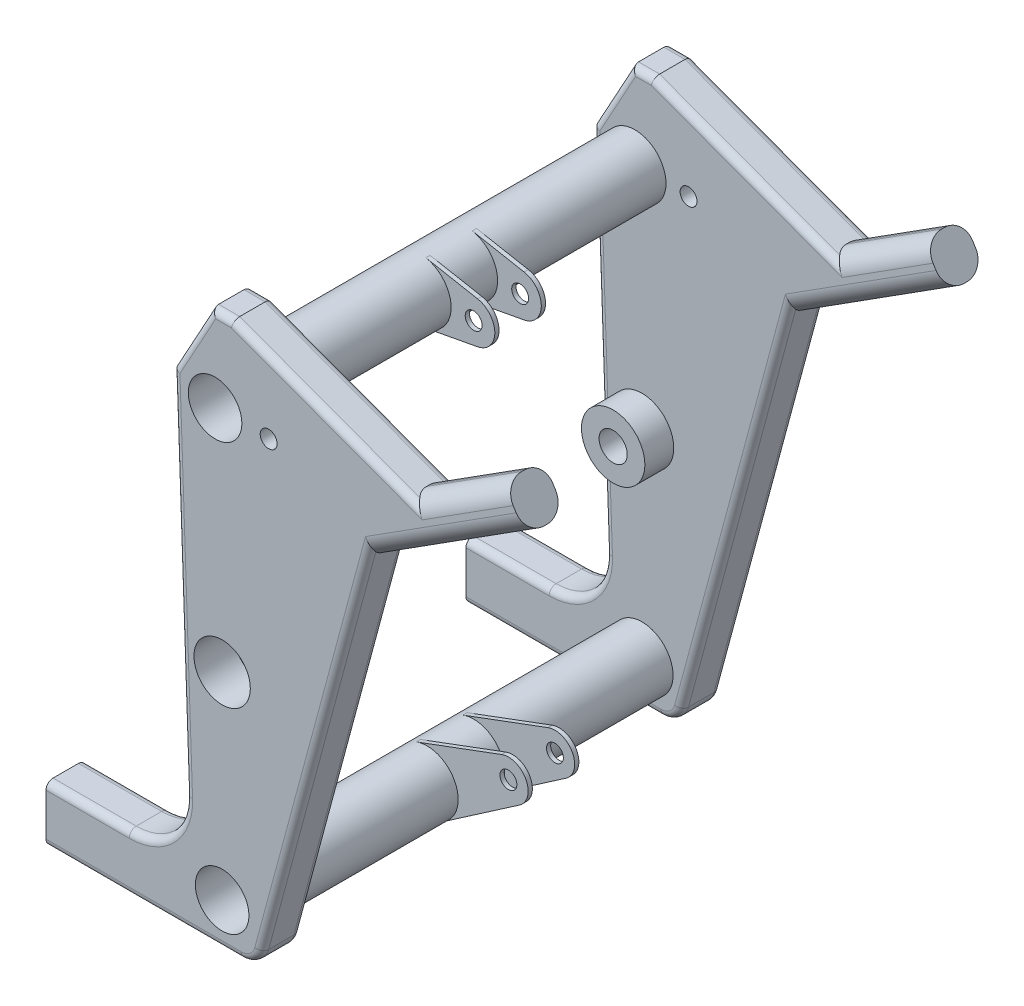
ISO-10303-21;
HEADER;
FILE_DESCRIPTION(('STEP AP214'),'2;1');
FILE_NAME('part.step','',(''),(''),'','','');
FILE_SCHEMA(('AUTOMOTIVE_DESIGN { 1 0 10303 214 1 1 1 1 }'));
ENDSEC;
DATA;
#1=APPLICATION_CONTEXT('core data for automotive mechanical design processes');
#2=APPLICATION_PROTOCOL_DEFINITION('international standard','automotive_design',2000,#1);
#3=PRODUCT_CONTEXT('',#1,'mechanical');
#4=PRODUCT('Part','Part','',(#3));
#5=PRODUCT_RELATED_PRODUCT_CATEGORY('part','',(#4));
#6=PRODUCT_DEFINITION_FORMATION('','',#4);
#7=PRODUCT_DEFINITION_CONTEXT('part definition',#1,'design');
#8=PRODUCT_DEFINITION('design','',#6,#7);
#9=PRODUCT_DEFINITION_SHAPE('','',#8);
#10=(LENGTH_UNIT() NAMED_UNIT(*) SI_UNIT(.MILLI.,.METRE.));
#11=(NAMED_UNIT(*) PLANE_ANGLE_UNIT() SI_UNIT($,.RADIAN.));
#12=(NAMED_UNIT(*) SI_UNIT($,.STERADIAN.) SOLID_ANGLE_UNIT());
#13=UNCERTAINTY_MEASURE_WITH_UNIT(LENGTH_MEASURE(1.E-05),#10,'distance_accuracy_value','');
#14=(GEOMETRIC_REPRESENTATION_CONTEXT(3) GLOBAL_UNCERTAINTY_ASSIGNED_CONTEXT((#13)) GLOBAL_UNIT_ASSIGNED_CONTEXT((#10,
#11,#12)) REPRESENTATION_CONTEXT('',''));
#15=CARTESIAN_POINT('',(0.,0.,0.));
#16=DIRECTION('',(0.,0.,1.));
#17=DIRECTION('',(1.,0.,0.));
#18=AXIS2_PLACEMENT_3D('',#15,#16,#17);
#19=CARTESIAN_POINT('',(0.,0.,135.5));
#20=DIRECTION('',(0.,0.,-1.));
#21=DIRECTION('',(-1.,0.,0.));
#22=AXIS2_PLACEMENT_3D('',#19,#20,#21);
#23=CYLINDRICAL_SURFACE('',#22,10.);
#24=CARTESIAN_POINT('',(0.,0.,-114.));
#25=DIRECTION('',(0.,0.,1.));
#26=DIRECTION('',(1.,0.,0.));
#27=AXIS2_PLACEMENT_3D('',#24,#25,#26);
#28=CIRCLE('',#27,10.);
#29=CARTESIAN_POINT('',(10.,0.,-114.));
#30=VERTEX_POINT('',#29);
#31=EDGE_CURVE('E58',#30,#30,#28,.T.);
#32=ORIENTED_EDGE('',*,*,#31,.T.);
#33=EDGE_LOOP('',(#32));
#34=FACE_BOUND('',#33,.T.);
#35=CARTESIAN_POINT('',(0.,0.,-134.5));
#36=DIRECTION('',(0.,0.,-1.));
#37=DIRECTION('',(-1.,0.,0.));
#38=AXIS2_PLACEMENT_3D('',#35,#36,#37);
#39=CIRCLE('',#38,10.);
#40=CARTESIAN_POINT('',(-10.,0.,-134.5));
#41=VERTEX_POINT('',#40);
#42=EDGE_CURVE('E53',#41,#41,#39,.T.);
#43=ORIENTED_EDGE('',*,*,#42,.T.);
#44=EDGE_LOOP('',(#43));
#45=FACE_BOUND('',#44,.T.);
#46=ADVANCED_FACE('F42',(#34,#45),#23,.F.);
#47=CARTESIAN_POINT('',(0.,0.,135.5));
#48=DIRECTION('',(0.,0.,-1.));
#49=DIRECTION('',(-1.,0.,0.));
#50=AXIS2_PLACEMENT_3D('',#47,#48,#49);
#51=CYLINDRICAL_SURFACE('',#50,22.5);
#52=CARTESIAN_POINT('',(0.,0.,-114.));
#53=DIRECTION('',(0.,0.,1.));
#54=DIRECTION('',(1.,0.,0.));
#55=AXIS2_PLACEMENT_3D('',#52,#53,#54);
#56=CIRCLE('',#55,22.5);
#57=CARTESIAN_POINT('',(22.5,0.,-114.));
#58=VERTEX_POINT('',#57);
#59=EDGE_CURVE('E49',#58,#58,#56,.T.);
#60=ORIENTED_EDGE('',*,*,#59,.F.);
#61=EDGE_LOOP('',(#60));
#62=FACE_BOUND('',#61,.T.);
#63=CARTESIAN_POINT('',(0.,0.,-134.5));
#64=DIRECTION('',(0.,0.,-1.));
#65=DIRECTION('',(-1.,0.,0.));
#66=AXIS2_PLACEMENT_3D('',#63,#64,#65);
#67=CIRCLE('',#66,22.5);
#68=CARTESIAN_POINT('',(-22.5,0.,-134.5));
#69=VERTEX_POINT('',#68);
#70=EDGE_CURVE('E11',#69,#69,#67,.T.);
#71=ORIENTED_EDGE('',*,*,#70,.F.);
#72=EDGE_LOOP('',(#71));
#73=FACE_BOUND('',#72,.T.);
#74=ADVANCED_FACE('F67',(#62,#73),#51,.T.);
#75=CARTESIAN_POINT('',(0.,0.,-114.));
#76=DIRECTION('',(0.,0.,1.));
#77=DIRECTION('',(1.,0.,0.));
#78=AXIS2_PLACEMENT_3D('',#75,#76,#77);
#79=PLANE('',#78);
#80=ORIENTED_EDGE('',*,*,#31,.F.);
#81=EDGE_LOOP('',(#80));
#82=FACE_BOUND('',#81,.T.);
#83=ORIENTED_EDGE('',*,*,#59,.T.);
#84=EDGE_LOOP('',(#83));
#85=FACE_BOUND('',#84,.T.);
#86=ADVANCED_FACE('F65',(#82,#85),#79,.T.);
#87=CARTESIAN_POINT('',(0.,0.,-134.5));
#88=DIRECTION('',(0.,0.,-1.));
#89=DIRECTION('',(-1.,0.,0.));
#90=AXIS2_PLACEMENT_3D('',#87,#88,#89);
#91=PLANE('',#90);
#92=ORIENTED_EDGE('',*,*,#42,.F.);
#93=EDGE_LOOP('',(#92));
#94=FACE_BOUND('',#93,.T.);
#95=ORIENTED_EDGE('',*,*,#70,.T.);
#96=EDGE_LOOP('',(#95));
#97=FACE_BOUND('',#96,.T.);
#98=ADVANCED_FACE('F44',(#94,#97),#91,.T.);
#99=CLOSED_SHELL('',(#46,#74,#86,#98));
#100=MANIFOLD_SOLID_BREP('B2',#99);
#101=CARTESIAN_POINT('',(33.,159.921855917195,-134.5));
#102=DIRECTION('',(0.,0.,-1.));
#103=DIRECTION('',(-1.,0.,0.));
#104=AXIS2_PLACEMENT_3D('',#101,#102,#103);
#105=CYLINDRICAL_SURFACE('',#104,6.);
#106=CARTESIAN_POINT('',(33.,159.921855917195,-134.5));
#107=DIRECTION('',(0.,0.,1.));
#108=DIRECTION('',(1.,0.,0.));
#109=AXIS2_PLACEMENT_3D('',#106,#107,#108);
#110=CIRCLE('',#109,6.);
#111=CARTESIAN_POINT('',(39.,159.921855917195,-134.5));
#112=VERTEX_POINT('',#111);
#113=EDGE_CURVE('E676',#112,#112,#110,.T.);
#114=ORIENTED_EDGE('',*,*,#113,.T.);
#115=EDGE_LOOP('',(#114));
#116=FACE_BOUND('',#115,.T.);
#117=CARTESIAN_POINT('',(33.,159.921855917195,-162.5));
#118=DIRECTION('',(0.,0.,1.));
#119=DIRECTION('',(1.,0.,0.));
#120=AXIS2_PLACEMENT_3D('',#117,#118,#119);
#121=CIRCLE('',#120,6.);
#122=CARTESIAN_POINT('',(39.,159.921855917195,-162.5));
#123=VERTEX_POINT('',#122);
#124=EDGE_CURVE('E673',#123,#123,#121,.T.);
#125=ORIENTED_EDGE('',*,*,#124,.F.);
#126=EDGE_LOOP('',(#125));
#127=FACE_BOUND('',#126,.T.);
#128=ADVANCED_FACE('F117',(#116,#127),#105,.F.);
#129=CARTESIAN_POINT('',(-35.,169.817248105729,-134.5));
#130=DIRECTION('',(0.999390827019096,0.034899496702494,0.));
#131=DIRECTION('',(-0.034899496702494,0.999390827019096,0.));
#132=AXIS2_PLACEMENT_3D('',#129,#130,#131);
#133=PLANE('',#132);
#134=DIRECTION('',(0.,0.,-1.));
#135=VECTOR('',#134,1.);
#136=CARTESIAN_POINT('',(-25.9757304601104,-88.6040201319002,-134.5));
#137=LINE('',#136,#135);
#138=CARTESIAN_POINT('',(-25.9757304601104,-88.6040201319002,-157.5));
#139=VERTEX_POINT('',#138);
#140=CARTESIAN_POINT('',(-25.9757304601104,-88.6040201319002,-139.5));
#141=VERTEX_POINT('',#140);
#142=EDGE_CURVE('E381',#139,#141,#137,.F.);
#143=ORIENTED_EDGE('',*,*,#142,.T.);
#144=DIRECTION('',(0.034899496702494,-0.999390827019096,0.));
#145=VECTOR('',#144,1.);
#146=CARTESIAN_POINT('',(-35.,169.817248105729,-139.5));
#147=LINE('',#146,#145);
#148=CARTESIAN_POINT('',(-35.,169.817248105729,-139.5));
#149=VERTEX_POINT('',#148);
#150=EDGE_CURVE('E415',#141,#149,#147,.F.);
#151=ORIENTED_EDGE('',*,*,#150,.T.);
#152=DIRECTION('',(0.,0.,-1.));
#153=VECTOR('',#152,1.);
#154=CARTESIAN_POINT('',(-35.,169.817248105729,-134.5));
#155=LINE('',#154,#153);
#156=CARTESIAN_POINT('',(-35.,169.817248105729,-157.5));
#157=VERTEX_POINT('',#156);
#158=EDGE_CURVE('E338',#149,#157,#155,.T.);
#159=ORIENTED_EDGE('',*,*,#158,.T.);
#160=DIRECTION('',(0.034899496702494,-0.999390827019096,0.));
#161=VECTOR('',#160,1.);
#162=CARTESIAN_POINT('',(-25.9757304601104,-88.6040201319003,-157.5));
#163=LINE('',#162,#161);
#164=EDGE_CURVE('E413',#157,#139,#163,.T.);
#165=ORIENTED_EDGE('',*,*,#164,.T.);
#166=EDGE_LOOP('',(#143,#151,#159,#165));
#167=FACE_BOUND('',#166,.T.);
#168=ADVANCED_FACE('F512',(#167),#133,.F.);
#169=CARTESIAN_POINT('',(-24.5301509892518,-130.,-134.5));
#170=DIRECTION('',(0.,-1.,0.));
#171=DIRECTION('',(0.,0.,-1.));
#172=AXIS2_PLACEMENT_3D('',#169,#170,#171);
#173=PLANE('',#172);
#174=DIRECTION('',(0.,0.,-1.));
#175=VECTOR('',#174,1.);
#176=CARTESIAN_POINT('',(-65.9513635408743,-130.,-162.5));
#177=LINE('',#176,#175);
#178=CARTESIAN_POINT('',(-65.9513635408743,-130.,-139.5));
#179=VERTEX_POINT('',#178);
#180=CARTESIAN_POINT('',(-65.9513635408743,-130.,-157.5));
#181=VERTEX_POINT('',#180);
#182=EDGE_CURVE('E378',#179,#181,#177,.T.);
#183=ORIENTED_EDGE('',*,*,#182,.T.);
#184=DIRECTION('',(-1.,0.,0.));
#185=VECTOR('',#184,1.);
#186=CARTESIAN_POINT('',(-125.,-130.,-157.5));
#187=LINE('',#186,#185);
#188=CARTESIAN_POINT('',(-125.,-130.,-157.5));
#189=VERTEX_POINT('',#188);
#190=EDGE_CURVE('E442',#181,#189,#187,.T.);
#191=ORIENTED_EDGE('',*,*,#190,.T.);
#192=DIRECTION('',(0.,0.,-1.));
#193=VECTOR('',#192,1.);
#194=CARTESIAN_POINT('',(-125.,-130.,-134.5));
#195=LINE('',#194,#193);
#196=CARTESIAN_POINT('',(-125.,-130.,-139.5));
#197=VERTEX_POINT('',#196);
#198=EDGE_CURVE('E343',#197,#189,#195,.T.);
#199=ORIENTED_EDGE('',*,*,#198,.F.);
#200=DIRECTION('',(-1.,0.,0.));
#201=VECTOR('',#200,1.);
#202=CARTESIAN_POINT('',(-24.5301509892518,-130.,-139.5));
#203=LINE('',#202,#201);
#204=EDGE_CURVE('E440',#197,#179,#203,.F.);
#205=ORIENTED_EDGE('',*,*,#204,.T.);
#206=EDGE_LOOP('',(#183,#191,#199,#205));
#207=FACE_BOUND('',#206,.T.);
#208=ADVANCED_FACE('F518',(#207),#173,.F.);
#209=CARTESIAN_POINT('',(-125.,-130.,-134.5));
#210=DIRECTION('',(1.,0.,0.));
#211=DIRECTION('',(0.,1.,0.));
#212=AXIS2_PLACEMENT_3D('',#209,#210,#211);
#213=PLANE('',#212);
#214=ORIENTED_EDGE('',*,*,#198,.T.);
#215=CARTESIAN_POINT('',(-125.,-135.,-157.5));
#216=DIRECTION('',(1.,0.,0.));
#217=DIRECTION('',(0.,1.,0.));
#218=AXIS2_PLACEMENT_3D('',#215,#216,#217);
#219=CIRCLE('',#218,5.);
#220=CARTESIAN_POINT('',(-125.,-135.,-162.5));
#221=VERTEX_POINT('',#220);
#222=EDGE_CURVE('E451',#189,#221,#219,.F.);
#223=ORIENTED_EDGE('',*,*,#222,.T.);
#224=DIRECTION('',(0.,-1.,0.));
#225=VECTOR('',#224,1.);
#226=CARTESIAN_POINT('',(-125.,-130.,-162.5));
#227=LINE('',#226,#225);
#228=CARTESIAN_POINT('',(-125.,-165.,-162.5));
#229=VERTEX_POINT('',#228);
#230=EDGE_CURVE('E593',#221,#229,#227,.T.);
#231=ORIENTED_EDGE('',*,*,#230,.T.);
#232=CARTESIAN_POINT('',(-125.,-165.,-157.5));
#233=DIRECTION('',(1.,0.,0.));
#234=DIRECTION('',(0.,1.,0.));
#235=AXIS2_PLACEMENT_3D('',#232,#233,#234);
#236=CIRCLE('',#235,5.);
#237=CARTESIAN_POINT('',(-125.,-170.,-157.5));
#238=VERTEX_POINT('',#237);
#239=EDGE_CURVE('E445',#229,#238,#236,.F.);
#240=ORIENTED_EDGE('',*,*,#239,.T.);
#241=DIRECTION('',(0.,0.,-1.));
#242=VECTOR('',#241,1.);
#243=CARTESIAN_POINT('',(-125.,-170.,-134.5));
#244=LINE('',#243,#242);
#245=CARTESIAN_POINT('',(-125.,-170.,-139.5));
#246=VERTEX_POINT('',#245);
#247=EDGE_CURVE('E624',#246,#238,#244,.T.);
#248=ORIENTED_EDGE('',*,*,#247,.F.);
#249=CARTESIAN_POINT('',(-125.,-165.,-139.5));
#250=DIRECTION('',(1.,0.,0.));
#251=DIRECTION('',(0.,1.,0.));
#252=AXIS2_PLACEMENT_3D('',#249,#250,#251);
#253=CIRCLE('',#252,5.);
#254=CARTESIAN_POINT('',(-125.,-165.,-134.5));
#255=VERTEX_POINT('',#254);
#256=EDGE_CURVE('E449',#246,#255,#253,.F.);
#257=ORIENTED_EDGE('',*,*,#256,.T.);
#258=DIRECTION('',(0.,-1.,0.));
#259=VECTOR('',#258,1.);
#260=CARTESIAN_POINT('',(-125.,-130.,-134.5));
#261=LINE('',#260,#259);
#262=CARTESIAN_POINT('',(-125.,-135.,-134.5));
#263=VERTEX_POINT('',#262);
#264=EDGE_CURVE('E602',#263,#255,#261,.T.);
#265=ORIENTED_EDGE('',*,*,#264,.F.);
#266=CARTESIAN_POINT('',(-125.,-135.,-139.5));
#267=DIRECTION('',(1.,0.,0.));
#268=DIRECTION('',(0.,1.,0.));
#269=AXIS2_PLACEMENT_3D('',#266,#267,#268);
#270=CIRCLE('',#269,5.);
#271=EDGE_CURVE('E447',#263,#197,#270,.F.);
#272=ORIENTED_EDGE('',*,*,#271,.T.);
#273=EDGE_LOOP('',(#214,#223,#231,#240,#248,#257,#265,#272));
#274=FACE_BOUND('',#273,.T.);
#275=ADVANCED_FACE('F563',(#274),#213,.F.);
#276=CARTESIAN_POINT('',(-125.,-170.,-134.5));
#277=DIRECTION('',(0.,1.,0.));
#278=DIRECTION('',(0.,0.,1.));
#279=AXIS2_PLACEMENT_3D('',#276,#277,#278);
#280=PLANE('',#279);
#281=DIRECTION('',(0.,0.,-1.));
#282=VECTOR('',#281,1.);
#283=CARTESIAN_POINT('',(13.5046593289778,-170.,-134.5));
#284=LINE('',#283,#282);
#285=CARTESIAN_POINT('',(13.5046593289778,-170.,-157.5));
#286=VERTEX_POINT('',#285);
#287=CARTESIAN_POINT('',(13.5046593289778,-170.,-139.5));
#288=VERTEX_POINT('',#287);
#289=EDGE_CURVE('E375',#286,#288,#284,.F.);
#290=ORIENTED_EDGE('',*,*,#289,.T.);
#291=DIRECTION('',(1.,0.,0.));
#292=VECTOR('',#291,1.);
#293=CARTESIAN_POINT('',(-125.,-170.,-139.5));
#294=LINE('',#293,#292);
#295=EDGE_CURVE('E461',#288,#246,#294,.F.);
#296=ORIENTED_EDGE('',*,*,#295,.T.);
#297=ORIENTED_EDGE('',*,*,#247,.T.);
#298=DIRECTION('',(1.,0.,0.));
#299=VECTOR('',#298,1.);
#300=CARTESIAN_POINT('',(13.5046593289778,-170.,-157.5));
#301=LINE('',#300,#299);
#302=EDGE_CURVE('E459',#238,#286,#301,.T.);
#303=ORIENTED_EDGE('',*,*,#302,.T.);
#304=EDGE_LOOP('',(#290,#296,#297,#303));
#305=FACE_BOUND('',#304,.T.);
#306=ADVANCED_FACE('F559',(#305),#280,.F.);
#307=CARTESIAN_POINT('',(25.,-170.,-134.5));
#308=DIRECTION('',(-0.965608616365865,0.26,0.));
#309=DIRECTION('',(-0.26,-0.965608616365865,0.));
#310=AXIS2_PLACEMENT_3D('',#307,#308,#309);
#311=PLANE('',#310);
#312=CARTESIAN_POINT('',(108.006366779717,138.275626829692,-147.5));
#313=DIRECTION('',(-0.965608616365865,0.26,0.));
#314=DIRECTION('',(0.26,0.965608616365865,0.));
#315=AXIS2_PLACEMENT_3D('',#312,#313,#314);
#316=ELLIPSE('',#315,19.2552568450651,13.);
#317=CARTESIAN_POINT('',(103.,119.682584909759,-147.5));
#318=VERTEX_POINT('',#317);
#319=CARTESIAN_POINT('',(104.060213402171,123.620089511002,-139.5));
#320=VERTEX_POINT('',#319);
#321=EDGE_CURVE('E320',#318,#320,#316,.T.);
#322=ORIENTED_EDGE('',*,*,#321,.T.);
#323=DIRECTION('',(0.26,0.965608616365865,0.));
#324=VECTOR('',#323,1.);
#325=CARTESIAN_POINT('',(25.,-170.,-139.5));
#326=LINE('',#325,#324);
#327=CARTESIAN_POINT('',(27.9887885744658,-158.9,-139.5));
#328=VERTEX_POINT('',#327);
#329=EDGE_CURVE('E407',#320,#328,#326,.F.);
#330=ORIENTED_EDGE('',*,*,#329,.T.);
#331=DIRECTION('',(0.,0.,-1.));
#332=VECTOR('',#331,1.);
#333=CARTESIAN_POINT('',(27.9887885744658,-158.9,-134.5));
#334=LINE('',#333,#332);
#335=CARTESIAN_POINT('',(27.9887885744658,-158.9,-157.5));
#336=VERTEX_POINT('',#335);
#337=EDGE_CURVE('E372',#328,#336,#334,.T.);
#338=ORIENTED_EDGE('',*,*,#337,.T.);
#339=DIRECTION('',(0.26,0.965608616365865,0.));
#340=VECTOR('',#339,1.);
#341=CARTESIAN_POINT('',(108.006366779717,138.275626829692,-157.5));
#342=LINE('',#341,#340);
#343=CARTESIAN_POINT('',(104.060213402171,123.620089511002,-157.5));
#344=VERTEX_POINT('',#343);
#345=EDGE_CURVE('E404',#336,#344,#342,.T.);
#346=ORIENTED_EDGE('',*,*,#345,.T.);
#347=CARTESIAN_POINT('',(108.006366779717,138.275626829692,-149.5));
#348=DIRECTION('',(-0.965608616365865,0.26,0.));
#349=DIRECTION('',(-0.26,-0.965608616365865,0.));
#350=AXIS2_PLACEMENT_3D('',#347,#348,#349);
#351=ELLIPSE('',#350,19.2552568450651,13.);
#352=CARTESIAN_POINT('',(103.,119.682584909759,-149.5));
#353=VERTEX_POINT('',#352);
#354=EDGE_CURVE('E321',#344,#353,#351,.T.);
#355=ORIENTED_EDGE('',*,*,#354,.T.);
#356=DIRECTION('',(0.,0.,-1.));
#357=VECTOR('',#356,1.);
#358=CARTESIAN_POINT('',(103.,119.682584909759,-134.5));
#359=LINE('',#358,#357);
#360=EDGE_CURVE('E621',#318,#353,#359,.T.);
#361=ORIENTED_EDGE('',*,*,#360,.F.);
#362=EDGE_LOOP('',(#322,#330,#338,#346,#355,#361));
#363=FACE_BOUND('',#362,.T.);
#364=ADVANCED_FACE('F555',(#363),#311,.F.);
#365=CARTESIAN_POINT('',(215.644974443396,191.348346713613,-134.5));
#366=DIRECTION('',(-0.536782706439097,0.843720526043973,0.));
#367=DIRECTION('',(-0.843720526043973,-0.536782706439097,0.));
#368=AXIS2_PLACEMENT_3D('',#365,#366,#367);
#369=PLANE('',#368);
#370=ORIENTED_EDGE('',*,*,#360,.T.);
#371=DIRECTION('',(0.843720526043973,0.536782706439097,0.));
#372=VECTOR('',#371,1.);
#373=CARTESIAN_POINT('',(215.644974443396,191.348346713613,-149.5));
#374=LINE('',#373,#372);
#375=CARTESIAN_POINT('',(215.644974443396,191.348346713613,-149.5));
#376=VERTEX_POINT('',#375);
#377=EDGE_CURVE('E359',#353,#376,#374,.T.);
#378=ORIENTED_EDGE('',*,*,#377,.T.);
#379=DIRECTION('',(0.,0.,-1.));
#380=VECTOR('',#379,1.);
#381=CARTESIAN_POINT('',(215.644974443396,191.348346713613,-134.5));
#382=LINE('',#381,#380);
#383=CARTESIAN_POINT('',(215.644974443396,191.348346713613,-147.5));
#384=VERTEX_POINT('',#383);
#385=EDGE_CURVE('E618',#384,#376,#382,.T.);
#386=ORIENTED_EDGE('',*,*,#385,.F.);
#387=DIRECTION('',(0.843720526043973,0.536782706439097,0.));
#388=VECTOR('',#387,1.);
#389=CARTESIAN_POINT('',(215.644974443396,191.348346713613,-147.5));
#390=LINE('',#389,#388);
#391=EDGE_CURVE('E357',#384,#318,#390,.F.);
#392=ORIENTED_EDGE('',*,*,#391,.T.);
#393=EDGE_LOOP('',(#370,#378,#386,#392));
#394=FACE_BOUND('',#393,.T.);
#395=ADVANCED_FACE('F551',(#394),#369,.F.);
#396=CARTESIAN_POINT('',(199.541493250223,216.659962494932,-134.5));
#397=DIRECTION('',(-0.843720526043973,-0.536782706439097,0.));
#398=DIRECTION('',(0.536782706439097,-0.843720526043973,0.));
#399=AXIS2_PLACEMENT_3D('',#396,#397,#398);
#400=PLANE('',#399);
#401=DIRECTION('',(-0.536782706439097,0.843720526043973,0.));
#402=VECTOR('',#401,1.);
#403=CARTESIAN_POINT('',(199.541493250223,216.659962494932,-162.5));
#404=LINE('',#403,#402);
#405=CARTESIAN_POINT('',(208.666799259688,202.316713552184,-162.5));
#406=VERTEX_POINT('',#405);
#407=CARTESIAN_POINT('',(206.519668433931,205.69159565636,-162.5));
#408=VERTEX_POINT('',#407);
#409=EDGE_CURVE('E598',#406,#408,#404,.T.);
#410=ORIENTED_EDGE('',*,*,#409,.T.);
#411=CARTESIAN_POINT('',(206.519668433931,205.69159565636,-149.5));
#412=DIRECTION('',(-0.843720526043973,-0.536782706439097,0.));
#413=DIRECTION('',(0.536782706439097,-0.843720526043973,0.));
#414=AXIS2_PLACEMENT_3D('',#411,#412,#413);
#415=CIRCLE('',#414,13.);
#416=CARTESIAN_POINT('',(199.541493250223,216.659962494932,-149.5));
#417=VERTEX_POINT('',#416);
#418=EDGE_CURVE('E355',#408,#417,#415,.F.);
#419=ORIENTED_EDGE('',*,*,#418,.T.);
#420=DIRECTION('',(0.,0.,-1.));
#421=VECTOR('',#420,1.);
#422=CARTESIAN_POINT('',(199.541493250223,216.659962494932,-134.5));
#423=LINE('',#422,#421);
#424=CARTESIAN_POINT('',(199.541493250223,216.659962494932,-147.5));
#425=VERTEX_POINT('',#424);
#426=EDGE_CURVE('E331',#425,#417,#423,.T.);
#427=ORIENTED_EDGE('',*,*,#426,.F.);
#428=CARTESIAN_POINT('',(206.519668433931,205.69159565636,-147.5));
#429=DIRECTION('',(-0.843720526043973,-0.536782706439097,0.));
#430=DIRECTION('',(0.536782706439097,-0.843720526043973,0.));
#431=AXIS2_PLACEMENT_3D('',#428,#429,#430);
#432=CIRCLE('',#431,13.);
#433=CARTESIAN_POINT('',(206.519668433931,205.69159565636,-134.5));
#434=VERTEX_POINT('',#433);
#435=EDGE_CURVE('E337',#425,#434,#432,.F.);
#436=ORIENTED_EDGE('',*,*,#435,.T.);
#437=DIRECTION('',(-0.536782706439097,0.843720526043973,0.));
#438=VECTOR('',#437,1.);
#439=CARTESIAN_POINT('',(199.541493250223,216.659962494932,-134.5));
#440=LINE('',#439,#438);
#441=CARTESIAN_POINT('',(208.666799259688,202.316713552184,-134.5));
#442=VERTEX_POINT('',#441);
#443=EDGE_CURVE('E611',#442,#434,#440,.T.);
#444=ORIENTED_EDGE('',*,*,#443,.F.);
#445=CARTESIAN_POINT('',(208.666799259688,202.316713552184,-147.5));
#446=DIRECTION('',(-0.843720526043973,-0.536782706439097,0.));
#447=DIRECTION('',(0.536782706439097,-0.843720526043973,0.));
#448=AXIS2_PLACEMENT_3D('',#445,#446,#447);
#449=CIRCLE('',#448,13.);
#450=EDGE_CURVE('E350',#442,#384,#449,.F.);
#451=ORIENTED_EDGE('',*,*,#450,.T.);
#452=ORIENTED_EDGE('',*,*,#385,.T.);
#453=CARTESIAN_POINT('',(208.666799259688,202.316713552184,-149.5));
#454=DIRECTION('',(-0.843720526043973,-0.536782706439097,0.));
#455=DIRECTION('',(0.536782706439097,-0.843720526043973,0.));
#456=AXIS2_PLACEMENT_3D('',#453,#454,#455);
#457=CIRCLE('',#456,13.);
#458=EDGE_CURVE('E353',#376,#406,#457,.F.);
#459=ORIENTED_EDGE('',*,*,#458,.T.);
#460=EDGE_LOOP('',(#410,#419,#427,#436,#444,#451,#452,#459));
#461=FACE_BOUND('',#460,.T.);
#462=ADVANCED_FACE('F548',(#461),#400,.F.);
#463=CARTESIAN_POINT('',(132.043851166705,173.717345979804,-134.5));
#464=DIRECTION('',(0.536782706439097,-0.843720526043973,0.));
#465=DIRECTION('',(0.843720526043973,0.536782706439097,0.));
#466=AXIS2_PLACEMENT_3D('',#463,#464,#465);
#467=PLANE('',#466);
#468=ORIENTED_EDGE('',*,*,#426,.T.);
#469=DIRECTION('',(-0.843720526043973,-0.536782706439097,0.));
#470=VECTOR('',#469,1.);
#471=CARTESIAN_POINT('',(132.043851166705,173.717345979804,-149.5));
#472=LINE('',#471,#470);
#473=CARTESIAN_POINT('',(132.043851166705,173.717345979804,-149.5));
#474=VERTEX_POINT('',#473);
#475=EDGE_CURVE('E330',#417,#474,#472,.T.);
#476=ORIENTED_EDGE('',*,*,#475,.T.);
#477=DIRECTION('',(0.,0.,-1.));
#478=VECTOR('',#477,1.);
#479=CARTESIAN_POINT('',(132.043851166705,173.717345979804,-134.5));
#480=LINE('',#479,#478);
#481=CARTESIAN_POINT('',(132.043851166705,173.717345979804,-147.5));
#482=VERTEX_POINT('',#481);
#483=EDGE_CURVE('E313',#482,#474,#480,.T.);
#484=ORIENTED_EDGE('',*,*,#483,.F.);
#485=DIRECTION('',(-0.843720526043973,-0.536782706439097,0.));
#486=VECTOR('',#485,1.);
#487=CARTESIAN_POINT('',(132.043851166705,173.717345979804,-147.5));
#488=LINE('',#487,#486);
#489=EDGE_CURVE('E327',#482,#425,#488,.F.);
#490=ORIENTED_EDGE('',*,*,#489,.T.);
#491=EDGE_LOOP('',(#468,#476,#484,#490));
#492=FACE_BOUND('',#491,.T.);
#493=ADVANCED_FACE('F326',(#492),#467,.F.);
#494=CARTESIAN_POINT('',(132.043851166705,173.717345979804,-134.5));
#495=DIRECTION('',(-0.347825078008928,-0.937559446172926,0.));
#496=DIRECTION('',(0.937559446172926,-0.347825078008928,0.));
#497=AXIS2_PLACEMENT_3D('',#494,#495,#496);
#498=PLANE('',#497);
#499=DIRECTION('',(0.,0.,-1.));
#500=VECTOR('',#499,1.);
#501=CARTESIAN_POINT('',(7.5,219.921855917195,-134.5));
#502=LINE('',#501,#500);
#503=CARTESIAN_POINT('',(7.5,219.921855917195,-139.5));
#504=VERTEX_POINT('',#503);
#505=CARTESIAN_POINT('',(7.5,219.921855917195,-157.5));
#506=VERTEX_POINT('',#505);
#507=EDGE_CURVE('E332',#504,#506,#502,.T.);
#508=ORIENTED_EDGE('',*,*,#507,.F.);
#509=DIRECTION('',(-0.937559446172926,0.347825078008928,0.));
#510=VECTOR('',#509,1.);
#511=CARTESIAN_POINT('',(132.043851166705,173.717345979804,-139.5));
#512=LINE('',#511,#510);
#513=CARTESIAN_POINT('',(135.283515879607,172.515463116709,-139.5));
#514=VERTEX_POINT('',#513);
#515=EDGE_CURVE('E315',#504,#514,#512,.F.);
#516=ORIENTED_EDGE('',*,*,#515,.T.);
#517=CARTESIAN_POINT('',(147.341667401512,168.042010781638,-147.5));
#518=DIRECTION('',(-0.347825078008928,-0.937559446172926,0.));
#519=DIRECTION('',(-0.937559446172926,0.347825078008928,0.));
#520=AXIS2_PLACEMENT_3D('',#517,#518,#519);
#521=ELLIPSE('',#520,16.3166360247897,13.);
#522=EDGE_CURVE('E308',#514,#482,#521,.T.);
#523=ORIENTED_EDGE('',*,*,#522,.T.);
#524=ORIENTED_EDGE('',*,*,#483,.T.);
#525=CARTESIAN_POINT('',(147.341667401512,168.042010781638,-149.5));
#526=DIRECTION('',(-0.347825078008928,-0.937559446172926,0.));
#527=DIRECTION('',(0.937559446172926,-0.347825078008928,0.));
#528=AXIS2_PLACEMENT_3D('',#525,#526,#527);
#529=ELLIPSE('',#528,16.3166360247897,13.);
#530=CARTESIAN_POINT('',(135.283515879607,172.515463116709,-157.5));
#531=VERTEX_POINT('',#530);
#532=EDGE_CURVE('E367',#474,#531,#529,.T.);
#533=ORIENTED_EDGE('',*,*,#532,.T.);
#534=DIRECTION('',(-0.937559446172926,0.347825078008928,0.));
#535=VECTOR('',#534,1.);
#536=CARTESIAN_POINT('',(7.49999999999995,219.921855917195,-157.5));
#537=LINE('',#536,#535);
#538=EDGE_CURVE('E453',#531,#506,#537,.T.);
#539=ORIENTED_EDGE('',*,*,#538,.T.);
#540=EDGE_LOOP('',(#508,#516,#523,#524,#533,#539));
#541=FACE_BOUND('',#540,.T.);
#542=ADVANCED_FACE('F311',(#541),#498,.F.);
#543=CARTESIAN_POINT('',(7.5,219.921855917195,-134.5));
#544=DIRECTION('',(0.,-1.,0.));
#545=DIRECTION('',(1.,0.,0.));
#546=AXIS2_PLACEMENT_3D('',#543,#544,#545);
#547=PLANE('',#546);
#548=DIRECTION('',(0.,0.,-1.));
#549=VECTOR('',#548,1.);
#550=CARTESIAN_POINT('',(-7.5,219.921855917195,-134.5));
#551=LINE('',#550,#549);
#552=CARTESIAN_POINT('',(-7.5,219.921855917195,-139.5));
#553=VERTEX_POINT('',#552);
#554=CARTESIAN_POINT('',(-7.5,219.921855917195,-157.5));
#555=VERTEX_POINT('',#554);
#556=EDGE_CURVE('E614',#553,#555,#551,.T.);
#557=ORIENTED_EDGE('',*,*,#556,.F.);
#558=DIRECTION('',(-1.,0.,0.));
#559=VECTOR('',#558,1.);
#560=CARTESIAN_POINT('',(7.5,219.921855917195,-139.5));
#561=LINE('',#560,#559);
#562=EDGE_CURVE('E457',#553,#504,#561,.F.);
#563=ORIENTED_EDGE('',*,*,#562,.T.);
#564=ORIENTED_EDGE('',*,*,#507,.T.);
#565=DIRECTION('',(-1.,0.,0.));
#566=VECTOR('',#565,1.);
#567=CARTESIAN_POINT('',(-7.5,219.921855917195,-157.5));
#568=LINE('',#567,#566);
#569=EDGE_CURVE('E137',#506,#555,#568,.T.);
#570=ORIENTED_EDGE('',*,*,#569,.T.);
#571=EDGE_LOOP('',(#557,#563,#564,#570));
#572=FACE_BOUND('',#571,.T.);
#573=ADVANCED_FACE('F541',(#572),#547,.F.);
#574=CARTESIAN_POINT('',(-7.5,219.921855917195,-134.5));
#575=DIRECTION('',(0.876640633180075,-0.481145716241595,0.));
#576=DIRECTION('',(0.481145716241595,0.876640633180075,0.));
#577=AXIS2_PLACEMENT_3D('',#574,#575,#576);
#578=PLANE('',#577);
#579=ORIENTED_EDGE('',*,*,#158,.F.);
#580=DIRECTION('',(-0.481145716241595,-0.876640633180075,0.));
#581=VECTOR('',#580,1.);
#582=CARTESIAN_POINT('',(-7.5,219.921855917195,-139.5));
#583=LINE('',#582,#581);
#584=EDGE_CURVE('E144',#149,#553,#583,.F.);
#585=ORIENTED_EDGE('',*,*,#584,.T.);
#586=ORIENTED_EDGE('',*,*,#556,.T.);
#587=DIRECTION('',(-0.481145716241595,-0.876640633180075,0.));
#588=VECTOR('',#587,1.);
#589=CARTESIAN_POINT('',(-35.,169.817248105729,-157.5));
#590=LINE('',#589,#588);
#591=EDGE_CURVE('E463',#555,#157,#590,.T.);
#592=ORIENTED_EDGE('',*,*,#591,.T.);
#593=EDGE_LOOP('',(#579,#585,#586,#592));
#594=FACE_BOUND('',#593,.T.);
#595=ADVANCED_FACE('F119',(#594),#578,.F.);
#596=CARTESIAN_POINT('',(-5.,159.921855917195,-134.5));
#597=DIRECTION('',(0.,0.,-1.));
#598=DIRECTION('',(-1.,0.,0.));
#599=AXIS2_PLACEMENT_3D('',#596,#597,#598);
#600=CYLINDRICAL_SURFACE('',#599,19.);
#601=CARTESIAN_POINT('',(-5.,159.921855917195,-134.5));
#602=DIRECTION('',(0.,0.,1.));
#603=DIRECTION('',(1.,0.,0.));
#604=AXIS2_PLACEMENT_3D('',#601,#602,#603);
#605=CIRCLE('',#604,19.);
#606=CARTESIAN_POINT('',(14.,159.921855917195,-134.5));
#607=VERTEX_POINT('',#606);
#608=EDGE_CURVE('E599',#607,#607,#605,.T.);
#609=ORIENTED_EDGE('',*,*,#608,.T.);
#610=EDGE_LOOP('',(#609));
#611=FACE_BOUND('',#610,.T.);
#612=CARTESIAN_POINT('',(-5.,159.921855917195,-162.5));
#613=DIRECTION('',(0.,0.,1.));
#614=DIRECTION('',(1.,0.,0.));
#615=AXIS2_PLACEMENT_3D('',#612,#613,#614);
#616=CIRCLE('',#615,19.);
#617=CARTESIAN_POINT('',(14.,159.921855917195,-162.5));
#618=VERTEX_POINT('',#617);
#619=EDGE_CURVE('E605',#618,#618,#616,.T.);
#620=ORIENTED_EDGE('',*,*,#619,.F.);
#621=EDGE_LOOP('',(#620));
#622=FACE_BOUND('',#621,.T.);
#623=ADVANCED_FACE('F531',(#611,#622),#600,.F.);
#624=CARTESIAN_POINT('',(-4.96242123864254,224.545288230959,-134.5));
#625=DIRECTION('',(0.,0.,-1.));
#626=DIRECTION('',(-1.,0.,0.));
#627=AXIS2_PLACEMENT_3D('',#624,#625,#626);
#628=PLANE('',#627);
#629=ORIENTED_EDGE('',*,*,#113,.F.);
#630=EDGE_LOOP('',(#629));
#631=FACE_BOUND('',#630,.T.);
#632=DIRECTION('',(0.26,0.965608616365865,0.));
#633=VECTOR('',#632,1.);
#634=CARTESIAN_POINT('',(117.200343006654,191.65171399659,-134.5));
#635=LINE('',#634,#633);
#636=CARTESIAN_POINT('',(23.1607454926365,-157.6,-134.5));
#637=VERTEX_POINT('',#636);
#638=CARTESIAN_POINT('',(101.757883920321,134.300284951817,-134.5));
#639=VERTEX_POINT('',#638);
#640=EDGE_CURVE('E401',#637,#639,#635,.T.);
#641=ORIENTED_EDGE('',*,*,#640,.T.);
#642=DIRECTION('',(0.843720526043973,0.536782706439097,0.));
#643=VECTOR('',#642,1.);
#644=CARTESIAN_POINT('',(66.6589793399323,111.970041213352,-134.5));
#645=LINE('',#644,#643);
#646=EDGE_CURVE('E362',#639,#442,#645,.T.);
#647=ORIENTED_EDGE('',*,*,#646,.T.);
#648=ORIENTED_EDGE('',*,*,#443,.T.);
#649=DIRECTION('',(-0.843720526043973,-0.536782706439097,0.));
#650=VECTOR('',#649,1.);
#651=CARTESIAN_POINT('',(64.511848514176,115.344923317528,-134.5));
#652=LINE('',#651,#650);
#653=CARTESIAN_POINT('',(142.046790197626,164.67336153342,-134.5));
#654=VERTEX_POINT('',#653);
#655=EDGE_CURVE('E365',#434,#654,#652,.T.);
#656=ORIENTED_EDGE('',*,*,#655,.T.);
#657=DIRECTION('',(-0.937559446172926,0.347825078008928,0.));
#658=VECTOR('',#657,1.);
#659=CARTESIAN_POINT('',(-6.70154662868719,219.857491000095,-134.5));
#660=LINE('',#659,#658);
#661=CARTESIAN_POINT('',(6.60241443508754,214.921855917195,-134.5));
#662=VERTEX_POINT('',#661);
#663=EDGE_CURVE('E395',#654,#662,#660,.T.);
#664=ORIENTED_EDGE('',*,*,#663,.T.);
#665=DIRECTION('',(-1.,0.,0.));
#666=VECTOR('',#665,1.);
#667=CARTESIAN_POINT('',(-4.96242123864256,214.921855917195,-134.5));
#668=LINE('',#667,#666);
#669=CARTESIAN_POINT('',(-4.54066715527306,214.921855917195,-134.5));
#670=VERTEX_POINT('',#669);
#671=EDGE_CURVE('E393',#662,#670,#668,.T.);
#672=ORIENTED_EDGE('',*,*,#671,.T.);
#673=DIRECTION('',(-0.481145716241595,-0.876640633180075,0.));
#674=VECTOR('',#673,1.);
#675=CARTESIAN_POINT('',(-0.579218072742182,222.139559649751,-134.5));
#676=LINE('',#675,#674);
#677=CARTESIAN_POINT('',(-29.9550463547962,168.617219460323,-134.5));
#678=VERTEX_POINT('',#677);
#679=EDGE_CURVE('E391',#670,#678,#676,.T.);
#680=ORIENTED_EDGE('',*,*,#679,.T.);
#681=DIRECTION('',(0.034899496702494,-0.999390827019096,0.));
#682=VECTOR('',#681,1.);
#683=CARTESIAN_POINT('',(-31.8752783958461,223.605470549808,-134.5));
#684=LINE('',#683,#682);
#685=CARTESIAN_POINT('',(-20.978776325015,-88.4295226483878,-134.5));
#686=VERTEX_POINT('',#685);
#687=EDGE_CURVE('E388',#678,#686,#684,.T.);
#688=ORIENTED_EDGE('',*,*,#687,.T.);
#689=CARTESIAN_POINT('',(-65.9513635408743,-90.,-134.5));
#690=DIRECTION('',(0.,0.,-1.));
#691=DIRECTION('',(-1.,0.,0.));
#692=AXIS2_PLACEMENT_3D('',#689,#690,#691);
#693=CIRCLE('',#692,45.);
#694=CARTESIAN_POINT('',(-65.9513635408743,-135.,-134.5));
#695=VERTEX_POINT('',#694);
#696=EDGE_CURVE('E386',#686,#695,#693,.T.);
#697=ORIENTED_EDGE('',*,*,#696,.T.);
#698=DIRECTION('',(-1.,0.,0.));
#699=VECTOR('',#698,1.);
#700=CARTESIAN_POINT('',(-4.96242123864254,-135.,-134.5));
#701=LINE('',#700,#699);
#702=EDGE_CURVE('E384',#695,#263,#701,.T.);
#703=ORIENTED_EDGE('',*,*,#702,.T.);
#704=ORIENTED_EDGE('',*,*,#264,.T.);
#705=DIRECTION('',(1.,0.,0.));
#706=VECTOR('',#705,1.);
#707=CARTESIAN_POINT('',(-4.96242123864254,-165.,-134.5));
#708=LINE('',#707,#706);
#709=CARTESIAN_POINT('',(13.5046593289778,-165.,-134.5));
#710=VERTEX_POINT('',#709);
#711=EDGE_CURVE('E397',#255,#710,#708,.T.);
#712=ORIENTED_EDGE('',*,*,#711,.T.);
#713=CARTESIAN_POINT('',(13.5046593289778,-155.,-134.5));
#714=DIRECTION('',(0.,0.,-1.));
#715=DIRECTION('',(-1.,0.,0.));
#716=AXIS2_PLACEMENT_3D('',#713,#714,#715);
#717=CIRCLE('',#716,10.);
#718=EDGE_CURVE('E399',#710,#637,#717,.F.);
#719=ORIENTED_EDGE('',*,*,#718,.T.);
#720=EDGE_LOOP('',(#641,#647,#648,#656,#664,#672,#680,#688,#697,#703,#704,#712,#719));
#721=FACE_BOUND('',#720,.T.);
#722=ORIENTED_EDGE('',*,*,#608,.F.);
#723=EDGE_LOOP('',(#722));
#724=FACE_BOUND('',#723,.T.);
#725=CARTESIAN_POINT('',(0.,-140.,-134.5));
#726=DIRECTION('',(0.,0.,1.));
#727=DIRECTION('',(1.,0.,0.));
#728=AXIS2_PLACEMENT_3D('',#725,#726,#727);
#729=CIRCLE('',#728,19.);
#730=CARTESIAN_POINT('',(19.,-140.,-134.5));
#731=VERTEX_POINT('',#730);
#732=EDGE_CURVE('E681',#731,#731,#729,.T.);
#733=ORIENTED_EDGE('',*,*,#732,.F.);
#734=EDGE_LOOP('',(#733));
#735=FACE_BOUND('',#734,.T.);
#736=CARTESIAN_POINT('',(0.,0.,-134.5));
#737=DIRECTION('',(0.,0.,-1.));
#738=DIRECTION('',(-1.,0.,0.));
#739=AXIS2_PLACEMENT_3D('',#736,#737,#738);
#740=CIRCLE('',#739,22.5);
#741=CARTESIAN_POINT('',(-22.5,0.,-134.5));
#742=VERTEX_POINT('',#741);
#743=EDGE_CURVE('E670',#742,#742,#740,.T.);
#744=ORIENTED_EDGE('',*,*,#743,.T.);
#745=EDGE_LOOP('',(#744));
#746=FACE_BOUND('',#745,.T.);
#747=ADVANCED_FACE('F529',(#631,#721,#724,#735,#746),#628,.F.);
#748=CARTESIAN_POINT('',(0.,-140.,-134.5));
#749=DIRECTION('',(0.,0.,-1.));
#750=DIRECTION('',(-1.,0.,0.));
#751=AXIS2_PLACEMENT_3D('',#748,#749,#750);
#752=CYLINDRICAL_SURFACE('',#751,19.);
#753=ORIENTED_EDGE('',*,*,#732,.T.);
#754=EDGE_LOOP('',(#753));
#755=FACE_BOUND('',#754,.T.);
#756=CARTESIAN_POINT('',(0.,-140.,-162.5));
#757=DIRECTION('',(0.,0.,1.));
#758=DIRECTION('',(1.,0.,0.));
#759=AXIS2_PLACEMENT_3D('',#756,#757,#758);
#760=CIRCLE('',#759,19.);
#761=CARTESIAN_POINT('',(19.,-140.,-162.5));
#762=VERTEX_POINT('',#761);
#763=EDGE_CURVE('E678',#762,#762,#760,.T.);
#764=ORIENTED_EDGE('',*,*,#763,.F.);
#765=EDGE_LOOP('',(#764));
#766=FACE_BOUND('',#765,.T.);
#767=ADVANCED_FACE('F525',(#755,#766),#752,.F.);
#768=CARTESIAN_POINT('',(-4.96242123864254,224.545288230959,-162.5));
#769=DIRECTION('',(0.,0.,-1.));
#770=DIRECTION('',(-1.,0.,0.));
#771=AXIS2_PLACEMENT_3D('',#768,#769,#770);
#772=PLANE('',#771);
#773=CARTESIAN_POINT('',(0.,0.,-162.5));
#774=DIRECTION('',(0.,0.,-1.));
#775=DIRECTION('',(-1.,0.,0.));
#776=AXIS2_PLACEMENT_3D('',#773,#774,#775);
#777=CIRCLE('',#776,22.5);
#778=CARTESIAN_POINT('',(-22.5,0.,-162.5));
#779=VERTEX_POINT('',#778);
#780=EDGE_CURVE('E661',#779,#779,#777,.T.);
#781=ORIENTED_EDGE('',*,*,#780,.F.);
#782=EDGE_LOOP('',(#781));
#783=FACE_BOUND('',#782,.T.);
#784=ORIENTED_EDGE('',*,*,#763,.T.);
#785=EDGE_LOOP('',(#784));
#786=FACE_BOUND('',#785,.T.);
#787=ORIENTED_EDGE('',*,*,#619,.T.);
#788=EDGE_LOOP('',(#787));
#789=FACE_BOUND('',#788,.T.);
#790=DIRECTION('',(0.843720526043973,0.536782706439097,0.));
#791=VECTOR('',#790,1.);
#792=CARTESIAN_POINT('',(96.0218248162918,130.650951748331,-162.5));
#793=LINE('',#792,#791);
#794=CARTESIAN_POINT('',(101.757883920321,134.300284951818,-162.5));
#795=VERTEX_POINT('',#794);
#796=EDGE_CURVE('E340',#406,#795,#793,.F.);
#797=ORIENTED_EDGE('',*,*,#796,.T.);
#798=DIRECTION('',(0.26,0.965608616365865,0.));
#799=VECTOR('',#798,1.);
#800=CARTESIAN_POINT('',(23.1607454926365,-157.6,-162.5));
#801=LINE('',#800,#799);
#802=CARTESIAN_POINT('',(23.1607454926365,-157.6,-162.5));
#803=VERTEX_POINT('',#802);
#804=EDGE_CURVE('E438',#795,#803,#801,.F.);
#805=ORIENTED_EDGE('',*,*,#804,.T.);
#806=CARTESIAN_POINT('',(13.5046593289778,-155.,-162.5));
#807=DIRECTION('',(0.,0.,-1.));
#808=DIRECTION('',(-1.,0.,0.));
#809=AXIS2_PLACEMENT_3D('',#806,#807,#808);
#810=CIRCLE('',#809,10.);
#811=CARTESIAN_POINT('',(13.5046593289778,-165.,-162.5));
#812=VERTEX_POINT('',#811);
#813=EDGE_CURVE('E436',#803,#812,#810,.T.);
#814=ORIENTED_EDGE('',*,*,#813,.T.);
#815=DIRECTION('',(1.,0.,0.));
#816=VECTOR('',#815,1.);
#817=CARTESIAN_POINT('',(-125.,-165.,-162.5));
#818=LINE('',#817,#816);
#819=EDGE_CURVE('E434',#812,#229,#818,.F.);
#820=ORIENTED_EDGE('',*,*,#819,.T.);
#821=ORIENTED_EDGE('',*,*,#230,.F.);
#822=DIRECTION('',(-1.,0.,0.));
#823=VECTOR('',#822,1.);
#824=CARTESIAN_POINT('',(-65.9513635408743,-135.,-162.5));
#825=LINE('',#824,#823);
#826=CARTESIAN_POINT('',(-65.9513635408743,-135.,-162.5));
#827=VERTEX_POINT('',#826);
#828=EDGE_CURVE('E432',#221,#827,#825,.F.);
#829=ORIENTED_EDGE('',*,*,#828,.T.);
#830=CARTESIAN_POINT('',(-65.9513635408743,-90.,-162.5));
#831=DIRECTION('',(0.,0.,-1.));
#832=DIRECTION('',(-1.,0.,0.));
#833=AXIS2_PLACEMENT_3D('',#830,#831,#832);
#834=CIRCLE('',#833,45.);
#835=CARTESIAN_POINT('',(-20.978776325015,-88.4295226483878,-162.5));
#836=VERTEX_POINT('',#835);
#837=EDGE_CURVE('E430',#827,#836,#834,.F.);
#838=ORIENTED_EDGE('',*,*,#837,.T.);
#839=DIRECTION('',(0.034899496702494,-0.999390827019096,0.));
#840=VECTOR('',#839,1.);
#841=CARTESIAN_POINT('',(-30.0030458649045,169.991745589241,-162.5));
#842=LINE('',#841,#840);
#843=CARTESIAN_POINT('',(-29.9550463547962,168.617219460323,-162.5));
#844=VERTEX_POINT('',#843);
#845=EDGE_CURVE('E428',#836,#844,#842,.F.);
#846=ORIENTED_EDGE('',*,*,#845,.T.);
#847=DIRECTION('',(-0.481145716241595,-0.876640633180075,0.));
#848=VECTOR('',#847,1.);
#849=CARTESIAN_POINT('',(-3.11679683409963,217.516127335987,-162.5));
#850=LINE('',#849,#848);
#851=CARTESIAN_POINT('',(-4.54066715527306,214.921855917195,-162.5));
#852=VERTEX_POINT('',#851);
#853=EDGE_CURVE('E426',#844,#852,#850,.F.);
#854=ORIENTED_EDGE('',*,*,#853,.T.);
#855=DIRECTION('',(-1.,0.,0.));
#856=VECTOR('',#855,1.);
#857=CARTESIAN_POINT('',(7.49999999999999,214.921855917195,-162.5));
#858=LINE('',#857,#856);
#859=CARTESIAN_POINT('',(6.60241443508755,214.921855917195,-162.5));
#860=VERTEX_POINT('',#859);
#861=EDGE_CURVE('E424',#852,#860,#858,.F.);
#862=ORIENTED_EDGE('',*,*,#861,.T.);
#863=DIRECTION('',(-0.937559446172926,0.347825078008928,0.));
#864=VECTOR('',#863,1.);
#865=CARTESIAN_POINT('',(145.602542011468,163.354213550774,-162.5));
#866=LINE('',#865,#864);
#867=CARTESIAN_POINT('',(142.046790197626,164.67336153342,-162.5));
#868=VERTEX_POINT('',#867);
#869=EDGE_CURVE('E421',#860,#868,#866,.F.);
#870=ORIENTED_EDGE('',*,*,#869,.T.);
#871=DIRECTION('',(-0.843720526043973,-0.536782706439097,0.));
#872=VECTOR('',#871,1.);
#873=CARTESIAN_POINT('',(206.519668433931,205.69159565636,-162.5));
#874=LINE('',#873,#872);
#875=EDGE_CURVE('E348',#868,#408,#874,.F.);
#876=ORIENTED_EDGE('',*,*,#875,.T.);
#877=ORIENTED_EDGE('',*,*,#409,.F.);
#878=EDGE_LOOP('',(#797,#805,#814,#820,#821,#829,#838,#846,#854,#862,#870,#876,#877));
#879=FACE_BOUND('',#878,.T.);
#880=ORIENTED_EDGE('',*,*,#124,.T.);
#881=EDGE_LOOP('',(#880));
#882=FACE_BOUND('',#881,.T.);
#883=ADVANCED_FACE('F528',(#783,#786,#789,#879,#882),#772,.T.);
#884=CARTESIAN_POINT('',(0.,0.,-134.5));
#885=DIRECTION('',(0.,0.,-1.));
#886=DIRECTION('',(-1.,0.,0.));
#887=AXIS2_PLACEMENT_3D('',#884,#885,#886);
#888=CYLINDRICAL_SURFACE('',#887,22.5);
#889=ORIENTED_EDGE('',*,*,#743,.F.);
#890=EDGE_LOOP('',(#889));
#891=FACE_BOUND('',#890,.T.);
#892=ORIENTED_EDGE('',*,*,#780,.T.);
#893=EDGE_LOOP('',(#892));
#894=FACE_BOUND('',#893,.T.);
#895=ADVANCED_FACE('F524',(#891,#894),#888,.F.);
#896=CARTESIAN_POINT('',(139.022026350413,162.748979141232,-149.5));
#897=DIRECTION('',(0.843720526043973,0.536782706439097,0.));
#898=DIRECTION('',(-0.536782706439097,0.843720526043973,0.));
#899=AXIS2_PLACEMENT_3D('',#896,#897,#898);
#900=CYLINDRICAL_SURFACE('',#899,13.);
#901=ORIENTED_EDGE('',*,*,#418,.F.);
#902=ORIENTED_EDGE('',*,*,#875,.F.);
#903=CARTESIAN_POINT('',(135.283515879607,172.515463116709,-157.5));
#904=CARTESIAN_POINT('',(135.37694308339,172.480804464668,-157.601695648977));
#905=CARTESIAN_POINT('',(135.469616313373,172.443111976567,-157.703020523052));
#906=CARTESIAN_POINT('',(135.65352515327,172.36179722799,-157.904571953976));
#907=CARTESIAN_POINT('',(135.744760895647,172.318175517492,-158.004798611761));
#908=CARTESIAN_POINT('',(136.016288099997,172.17869249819,-158.303154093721));
#909=CARTESIAN_POINT('',(136.194559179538,172.074153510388,-158.499133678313));
#910=CARTESIAN_POINT('',(136.545166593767,171.844044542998,-158.881612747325));
#911=CARTESIAN_POINT('',(136.71752880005,171.718585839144,-159.068155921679));
#912=CARTESIAN_POINT('',(137.057820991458,171.447914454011,-159.430702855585));
#913=CARTESIAN_POINT('',(137.225750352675,171.302699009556,-159.606705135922));
#914=CARTESIAN_POINT('',(137.5600283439,170.992122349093,-159.948750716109));
#915=CARTESIAN_POINT('',(137.72631911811,170.826500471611,-160.114613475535));
#916=CARTESIAN_POINT('',(138.055317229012,170.478775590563,-160.432015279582));
#917=CARTESIAN_POINT('',(138.218024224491,170.296671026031,-160.583552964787));
#918=CARTESIAN_POINT('',(138.540557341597,169.917701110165,-160.871248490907));
#919=CARTESIAN_POINT('',(138.700378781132,169.720814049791,-161.007382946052));
#920=CARTESIAN_POINT('',(139.017346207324,169.314501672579,-161.263018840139));
#921=CARTESIAN_POINT('',(139.174492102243,169.105075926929,-161.382519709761));
#922=CARTESIAN_POINT('',(139.505723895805,168.649225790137,-161.617736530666));
#923=CARTESIAN_POINT('',(139.679518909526,168.401416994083,-161.731183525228));
#924=CARTESIAN_POINT('',(140.02486818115,167.895093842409,-161.935315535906));
#925=CARTESIAN_POINT('',(140.196422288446,167.636578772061,-162.025999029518));
#926=CARTESIAN_POINT('',(140.537634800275,167.111739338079,-162.183931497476));
#927=CARTESIAN_POINT('',(140.707295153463,166.845424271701,-162.251207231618));
#928=CARTESIAN_POINT('',(141.045391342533,166.307282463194,-162.362057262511));
#929=CARTESIAN_POINT('',(141.213827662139,166.035458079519,-162.405641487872));
#930=CARTESIAN_POINT('',(141.490610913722,165.585303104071,-162.457736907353));
#931=CARTESIAN_POINT('',(141.599164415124,165.407868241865,-162.473199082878));
#932=CARTESIAN_POINT('',(141.816070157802,165.052424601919,-162.494096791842));
#933=CARTESIAN_POINT('',(141.924422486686,164.874416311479,-162.499539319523));
#934=CARTESIAN_POINT('',(142.037432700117,164.688736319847,-162.499990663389));
#935=CARTESIAN_POINT('',(142.042111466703,164.681048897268,-162.500000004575));
#936=CARTESIAN_POINT('',(142.046790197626,164.67336153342,-162.5));
#937=B_SPLINE_CURVE_WITH_KNOTS('',3,(#903,#904,#905,#906,#907,#908,#909,#910,#911,#912,#913,
#914,#915,#916,#917,#918,#919,#920,#921,#922,#923,#924,#925,#926,#927,#928,#929,#930,#931,#932,
#933,#934,#935,#936),.UNSPECIFIED.,.F.,.F.,(4,2,2,2,2,2,2,2,2,2,2,2,2,2,2,2,4),(0.,
0.427063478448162,0.854087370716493,1.70740418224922,2.55631894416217,3.40535255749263,
4.2666481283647,5.1280253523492,5.99069328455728,6.85339073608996,7.82208248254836,
8.79083900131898,9.75848436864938,10.7257239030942,11.3512600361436,11.9763593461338,
12.0033572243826),.UNSPECIFIED.);
#938=EDGE_CURVE('E40',#868,#531,#937,.F.);
#939=ORIENTED_EDGE('',*,*,#938,.T.);
#940=ORIENTED_EDGE('',*,*,#532,.F.);
#941=ORIENTED_EDGE('',*,*,#475,.F.);
#942=EDGE_LOOP('',(#901,#902,#939,#940,#941));
#943=FACE_BOUND('',#942,.T.);
#944=ADVANCED_FACE('F695',(#943),#900,.T.);
#945=CARTESIAN_POINT('',(208.666799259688,202.316713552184,-149.5));
#946=DIRECTION('',(-0.843720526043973,-0.536782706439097,0.));
#947=DIRECTION('',(0.536782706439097,-0.843720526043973,0.));
#948=AXIS2_PLACEMENT_3D('',#945,#946,#947);
#949=CYLINDRICAL_SURFACE('',#948,13.);
#950=ORIENTED_EDGE('',*,*,#354,.F.);
#951=CARTESIAN_POINT('',(104.060213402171,123.620089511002,-157.5));
#952=CARTESIAN_POINT('',(104.093064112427,123.742079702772,-157.609252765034));
#953=CARTESIAN_POINT('',(104.122473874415,123.865093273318,-157.71836390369));
#954=CARTESIAN_POINT('',(104.174512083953,124.113194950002,-157.935828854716));
#955=CARTESIAN_POINT('',(104.19714089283,124.238282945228,-158.044182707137));
#956=CARTESIAN_POINT('',(104.254988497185,124.616569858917,-158.367286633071));
#957=CARTESIAN_POINT('',(104.280207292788,124.872936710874,-158.580210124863));
#958=CARTESIAN_POINT('',(104.305158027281,125.392669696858,-158.996461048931));
#959=CARTESIAN_POINT('',(104.304998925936,125.656001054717,-159.199825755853));
#960=CARTESIAN_POINT('',(104.281175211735,126.19039667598,-159.594697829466));
#961=CARTESIAN_POINT('',(104.257509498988,126.461461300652,-159.786204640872));
#962=CARTESIAN_POINT('',(104.188266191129,127.014201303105,-160.156760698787));
#963=CARTESIAN_POINT('',(104.142419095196,127.29596683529,-160.335624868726));
#964=CARTESIAN_POINT('',(104.031053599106,127.866197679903,-160.675684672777));
#965=CARTESIAN_POINT('',(103.96553423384,128.154663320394,-160.83687943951));
#966=CARTESIAN_POINT('',(103.817245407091,128.737884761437,-161.139660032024));
#967=CARTESIAN_POINT('',(103.734453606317,129.032648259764,-161.281220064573));
#968=CARTESIAN_POINT('',(103.554302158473,129.627243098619,-161.542745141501));
#969=CARTESIAN_POINT('',(103.456942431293,129.927074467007,-161.662710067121));
#970=CARTESIAN_POINT('',(103.240532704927,130.559554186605,-161.88996273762));
#971=CARTESIAN_POINT('',(103.120301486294,130.892619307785,-161.994971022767));
#972=CARTESIAN_POINT('',(102.86910151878,131.562616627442,-162.176125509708));
#973=CARTESIAN_POINT('',(102.738130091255,131.899549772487,-162.252264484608));
#974=CARTESIAN_POINT('',(102.469335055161,132.575186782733,-162.374588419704));
#975=CARTESIAN_POINT('',(102.331527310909,132.913885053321,-162.420839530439));
#976=CARTESIAN_POINT('',(102.052367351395,133.592410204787,-162.483094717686));
#977=CARTESIAN_POINT('',(101.911017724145,133.932236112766,-162.499120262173));
#978=CARTESIAN_POINT('',(101.765751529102,134.281375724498,-162.499988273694));
#979=CARTESIAN_POINT('',(101.761817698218,134.290830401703,-162.500000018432));
#980=CARTESIAN_POINT('',(101.757883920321,134.300284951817,-162.5));
#981=B_SPLINE_CURVE_WITH_KNOTS('',3,(#951,#952,#953,#954,#955,#956,#957,#958,#959,#960,#961,
#962,#963,#964,#965,#966,#967,#968,#969,#970,#971,#972,#973,#974,#975,#976,#977,#978,#979,#980),
.UNSPECIFIED.,.F.,.F.,(4,2,2,2,2,2,2,2,2,2,2,2,2,2,4),(0.,0.50099010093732,1.00195350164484,
2.00328446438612,3.00031633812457,3.99739486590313,5.006904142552,6.01646295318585,
7.02733566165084,8.03821392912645,9.14491014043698,10.2518832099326,11.3563977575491,
12.460127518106,12.4908487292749),.UNSPECIFIED.);
#982=EDGE_CURVE('E473',#344,#795,#981,.T.);
#983=ORIENTED_EDGE('',*,*,#982,.T.);
#984=ORIENTED_EDGE('',*,*,#796,.F.);
#985=ORIENTED_EDGE('',*,*,#458,.F.);
#986=ORIENTED_EDGE('',*,*,#377,.F.);
#987=EDGE_LOOP('',(#950,#983,#984,#985,#986));
#988=FACE_BOUND('',#987,.T.);
#989=ADVANCED_FACE('F702',(#988),#949,.T.);
#990=CARTESIAN_POINT('',(64.511848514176,115.344923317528,-147.5));
#991=DIRECTION('',(-0.843720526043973,-0.536782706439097,0.));
#992=DIRECTION('',(0.536782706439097,-0.843720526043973,0.));
#993=AXIS2_PLACEMENT_3D('',#990,#991,#992);
#994=CYLINDRICAL_SURFACE('',#993,13.);
#995=ORIENTED_EDGE('',*,*,#435,.F.);
#996=ORIENTED_EDGE('',*,*,#489,.F.);
#997=ORIENTED_EDGE('',*,*,#522,.F.);
#998=CARTESIAN_POINT('',(135.283515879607,172.515463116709,-139.5));
#999=CARTESIAN_POINT('',(135.37694308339,172.480804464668,-139.398304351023));
#1000=CARTESIAN_POINT('',(135.469616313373,172.443111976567,-139.296979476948));
#1001=CARTESIAN_POINT('',(135.65352515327,172.36179722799,-139.095428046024));
#1002=CARTESIAN_POINT('',(135.744760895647,172.318175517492,-138.995201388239));
#1003=CARTESIAN_POINT('',(136.016288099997,172.17869249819,-138.696845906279));
#1004=CARTESIAN_POINT('',(136.194559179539,172.074153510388,-138.500866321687));
#1005=CARTESIAN_POINT('',(136.545166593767,171.844044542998,-138.118387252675));
#1006=CARTESIAN_POINT('',(136.717528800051,171.718585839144,-137.931844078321));
#1007=CARTESIAN_POINT('',(137.057820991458,171.447914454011,-137.569297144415));
#1008=CARTESIAN_POINT('',(137.225750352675,171.302699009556,-137.393294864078));
#1009=CARTESIAN_POINT('',(137.5600283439,170.992122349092,-137.051249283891));
#1010=CARTESIAN_POINT('',(137.72631911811,170.826500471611,-136.885386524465));
#1011=CARTESIAN_POINT('',(138.055317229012,170.478775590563,-136.567984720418));
#1012=CARTESIAN_POINT('',(138.218024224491,170.296671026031,-136.416447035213));
#1013=CARTESIAN_POINT('',(138.540557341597,169.917701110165,-136.128751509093));
#1014=CARTESIAN_POINT('',(138.700378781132,169.720814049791,-135.992617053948));
#1015=CARTESIAN_POINT('',(139.017346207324,169.314501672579,-135.736981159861));
#1016=CARTESIAN_POINT('',(139.174492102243,169.105075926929,-135.617480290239));
#1017=CARTESIAN_POINT('',(139.505723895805,168.649225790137,-135.382263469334));
#1018=CARTESIAN_POINT('',(139.679518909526,168.401416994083,-135.268816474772));
#1019=CARTESIAN_POINT('',(140.02486818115,167.895093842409,-135.064684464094));
#1020=CARTESIAN_POINT('',(140.196422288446,167.636578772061,-134.974000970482));
#1021=CARTESIAN_POINT('',(140.537634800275,167.111739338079,-134.816068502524));
#1022=CARTESIAN_POINT('',(140.707295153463,166.845424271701,-134.748792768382));
#1023=CARTESIAN_POINT('',(141.045391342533,166.307282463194,-134.637942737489));
#1024=CARTESIAN_POINT('',(141.213827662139,166.035458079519,-134.594358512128));
#1025=CARTESIAN_POINT('',(141.490610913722,165.585303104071,-134.542263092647));
#1026=CARTESIAN_POINT('',(141.599164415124,165.407868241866,-134.526800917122));
#1027=CARTESIAN_POINT('',(141.816070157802,165.052424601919,-134.505903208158));
#1028=CARTESIAN_POINT('',(141.924422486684,164.874416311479,-134.500460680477));
#1029=CARTESIAN_POINT('',(142.037432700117,164.688736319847,-134.500009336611));
#1030=CARTESIAN_POINT('',(142.042111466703,164.681048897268,-134.499999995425));
#1031=CARTESIAN_POINT('',(142.046790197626,164.67336153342,-134.5));
#1032=B_SPLINE_CURVE_WITH_KNOTS('',3,(#998,#999,#1000,#1001,#1002,#1003,#1004,#1005,#1006,#1007,
#1008,#1009,#1010,#1011,#1012,#1013,#1014,#1015,#1016,#1017,#1018,#1019,#1020,#1021,#1022,#1023,
#1024,#1025,#1026,#1027,#1028,#1029,#1030,#1031),.UNSPECIFIED.,.F.,.F.,(4,2,2,2,2,2,2,2,2,2,2,2,
2,2,2,2,4),(0.,0.427063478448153,0.854087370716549,1.70740418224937,2.55631894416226,
3.40535255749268,4.26664812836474,5.12802535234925,5.99069328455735,6.85339073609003,
7.82208248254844,8.79083900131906,9.75848436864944,10.7257239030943,11.3512600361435,
11.9763593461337,12.0033572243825),.UNSPECIFIED.);
#1033=EDGE_CURVE('E130',#514,#654,#1032,.T.);
#1034=ORIENTED_EDGE('',*,*,#1033,.T.);
#1035=ORIENTED_EDGE('',*,*,#655,.F.);
#1036=EDGE_LOOP('',(#995,#996,#997,#1034,#1035));
#1037=FACE_BOUND('',#1036,.T.);
#1038=ADVANCED_FACE('F335',(#1037),#994,.T.);
#1039=CARTESIAN_POINT('',(66.6589793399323,111.970041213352,-147.5));
#1040=DIRECTION('',(0.843720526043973,0.536782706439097,0.));
#1041=DIRECTION('',(-0.536782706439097,0.843720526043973,0.));
#1042=AXIS2_PLACEMENT_3D('',#1039,#1040,#1041);
#1043=CYLINDRICAL_SURFACE('',#1042,13.);
#1044=ORIENTED_EDGE('',*,*,#321,.F.);
#1045=ORIENTED_EDGE('',*,*,#391,.F.);
#1046=ORIENTED_EDGE('',*,*,#450,.F.);
#1047=ORIENTED_EDGE('',*,*,#646,.F.);
#1048=CARTESIAN_POINT('',(104.060213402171,123.620089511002,-139.5));
#1049=CARTESIAN_POINT('',(104.093064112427,123.742079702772,-139.390747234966));
#1050=CARTESIAN_POINT('',(104.122473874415,123.865093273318,-139.28163609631));
#1051=CARTESIAN_POINT('',(104.174512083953,124.113194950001,-139.064171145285));
#1052=CARTESIAN_POINT('',(104.197140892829,124.238282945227,-138.955817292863));
#1053=CARTESIAN_POINT('',(104.254988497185,124.616569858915,-138.63271336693));
#1054=CARTESIAN_POINT('',(104.280207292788,124.872936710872,-138.419789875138));
#1055=CARTESIAN_POINT('',(104.305158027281,125.392669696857,-138.00353895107));
#1056=CARTESIAN_POINT('',(104.304998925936,125.656001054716,-137.800174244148));
#1057=CARTESIAN_POINT('',(104.281175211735,126.190396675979,-137.405302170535));
#1058=CARTESIAN_POINT('',(104.257509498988,126.461461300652,-137.213795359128));
#1059=CARTESIAN_POINT('',(104.188266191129,127.014201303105,-136.843239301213));
#1060=CARTESIAN_POINT('',(104.142419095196,127.29596683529,-136.664375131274));
#1061=CARTESIAN_POINT('',(104.031053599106,127.866197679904,-136.324315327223));
#1062=CARTESIAN_POINT('',(103.96553423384,128.154663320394,-136.16312056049));
#1063=CARTESIAN_POINT('',(103.817245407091,128.737884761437,-135.860339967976));
#1064=CARTESIAN_POINT('',(103.734453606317,129.032648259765,-135.718779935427));
#1065=CARTESIAN_POINT('',(103.554302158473,129.627243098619,-135.457254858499));
#1066=CARTESIAN_POINT('',(103.456942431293,129.927074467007,-135.337289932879));
#1067=CARTESIAN_POINT('',(103.240532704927,130.559554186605,-135.11003726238));
#1068=CARTESIAN_POINT('',(103.120301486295,130.892619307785,-135.005028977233));
#1069=CARTESIAN_POINT('',(102.86910151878,131.562616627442,-134.823874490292));
#1070=CARTESIAN_POINT('',(102.738130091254,131.899549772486,-134.747735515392));
#1071=CARTESIAN_POINT('',(102.469335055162,132.575186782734,-134.625411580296));
#1072=CARTESIAN_POINT('',(102.331527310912,132.913885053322,-134.579160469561));
#1073=CARTESIAN_POINT('',(102.052367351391,133.592410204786,-134.516905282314));
#1074=CARTESIAN_POINT('',(101.911017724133,133.932236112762,-134.500879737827));
#1075=CARTESIAN_POINT('',(101.765751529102,134.281375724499,-134.500011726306));
#1076=CARTESIAN_POINT('',(101.761817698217,134.290830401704,-134.499999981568));
#1077=CARTESIAN_POINT('',(101.757883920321,134.300284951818,-134.5));
#1078=B_SPLINE_CURVE_WITH_KNOTS('',3,(#1048,#1049,#1050,#1051,#1052,#1053,#1054,#1055,#1056,
#1057,#1058,#1059,#1060,#1061,#1062,#1063,#1064,#1065,#1066,#1067,#1068,#1069,#1070,#1071,#1072,
#1073,#1074,#1075,#1076,#1077),.UNSPECIFIED.,.F.,.F.,(4,2,2,2,2,2,2,2,2,2,2,2,2,2,4),(0.,
0.500990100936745,1.00195350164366,2.00328446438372,3.00031633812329,3.99739486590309,
5.00690414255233,6.01646295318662,7.02733566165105,8.03821392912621,9.14491014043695,
10.2518832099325,11.3563977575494,12.4601275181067,12.4908487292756),.UNSPECIFIED.);
#1079=EDGE_CURVE('E466',#639,#320,#1078,.F.);
#1080=ORIENTED_EDGE('',*,*,#1079,.T.);
#1081=EDGE_LOOP('',(#1044,#1045,#1046,#1047,#1080));
#1082=FACE_BOUND('',#1081,.T.);
#1083=ADVANCED_FACE('F479',(#1082),#1043,.T.);
#1084=CARTESIAN_POINT('',(13.5046593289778,-155.,-134.5));
#1085=DIRECTION('',(0.,0.,-1.));
#1086=DIRECTION('',(-1.,0.,0.));
#1087=AXIS2_PLACEMENT_3D('',#1084,#1085,#1086);
#1088=CYLINDRICAL_SURFACE('',#1087,15.);
#1089=ORIENTED_EDGE('',*,*,#337,.F.);
#1090=CARTESIAN_POINT('',(13.5046593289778,-155.,-139.5));
#1091=DIRECTION('',(0.,0.,-1.));
#1092=DIRECTION('',(-1.,0.,0.));
#1093=AXIS2_PLACEMENT_3D('',#1090,#1091,#1092);
#1094=CIRCLE('',#1093,15.);
#1095=EDGE_CURVE('E411',#328,#288,#1094,.T.);
#1096=ORIENTED_EDGE('',*,*,#1095,.T.);
#1097=ORIENTED_EDGE('',*,*,#289,.F.);
#1098=CARTESIAN_POINT('',(13.5046593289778,-155.,-157.5));
#1099=DIRECTION('',(0.,0.,-1.));
#1100=DIRECTION('',(-1.,0.,0.));
#1101=AXIS2_PLACEMENT_3D('',#1098,#1099,#1100);
#1102=CIRCLE('',#1101,15.);
#1103=EDGE_CURVE('E409',#286,#336,#1102,.F.);
#1104=ORIENTED_EDGE('',*,*,#1103,.T.);
#1105=EDGE_LOOP('',(#1089,#1096,#1097,#1104));
#1106=FACE_BOUND('',#1105,.T.);
#1107=ADVANCED_FACE('F502',(#1106),#1088,.T.);
#1108=CARTESIAN_POINT('',(-65.9513635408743,-90.,-134.5));
#1109=DIRECTION('',(0.,0.,1.));
#1110=DIRECTION('',(1.,0.,0.));
#1111=AXIS2_PLACEMENT_3D('',#1108,#1109,#1110);
#1112=CYLINDRICAL_SURFACE('',#1111,40.);
#1113=ORIENTED_EDGE('',*,*,#182,.F.);
#1114=CARTESIAN_POINT('',(-65.9513635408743,-90.,-139.5));
#1115=DIRECTION('',(0.,0.,-1.));
#1116=DIRECTION('',(-1.,0.,0.));
#1117=AXIS2_PLACEMENT_3D('',#1114,#1115,#1116);
#1118=CIRCLE('',#1117,40.);
#1119=EDGE_CURVE('E419',#179,#141,#1118,.F.);
#1120=ORIENTED_EDGE('',*,*,#1119,.T.);
#1121=ORIENTED_EDGE('',*,*,#142,.F.);
#1122=CARTESIAN_POINT('',(-65.9513635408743,-90.,-157.5));
#1123=DIRECTION('',(0.,0.,-1.));
#1124=DIRECTION('',(-1.,0.,0.));
#1125=AXIS2_PLACEMENT_3D('',#1122,#1123,#1124);
#1126=CIRCLE('',#1125,40.);
#1127=EDGE_CURVE('E417',#139,#181,#1126,.T.);
#1128=ORIENTED_EDGE('',*,*,#1127,.T.);
#1129=EDGE_LOOP('',(#1113,#1120,#1121,#1128));
#1130=FACE_BOUND('',#1129,.T.);
#1131=ADVANCED_FACE('F499',(#1130),#1112,.F.);
#1132=CARTESIAN_POINT('',(-4.96242123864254,-165.,-139.5));
#1133=DIRECTION('',(1.,0.,0.));
#1134=DIRECTION('',(0.,0.,-1.));
#1135=AXIS2_PLACEMENT_3D('',#1132,#1133,#1134);
#1136=CYLINDRICAL_SURFACE('',#1135,5.);
#1137=ORIENTED_EDGE('',*,*,#256,.F.);
#1138=ORIENTED_EDGE('',*,*,#295,.F.);
#1139=CARTESIAN_POINT('',(13.5046593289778,-165.,-139.5));
#1140=DIRECTION('',(1.,0.,0.));
#1141=DIRECTION('',(0.,0.,-1.));
#1142=AXIS2_PLACEMENT_3D('',#1139,#1140,#1141);
#1143=CIRCLE('',#1142,5.);
#1144=EDGE_CURVE('E657',#710,#288,#1143,.T.);
#1145=ORIENTED_EDGE('',*,*,#1144,.F.);
#1146=ORIENTED_EDGE('',*,*,#711,.F.);
#1147=EDGE_LOOP('',(#1137,#1138,#1145,#1146));
#1148=FACE_BOUND('',#1147,.T.);
#1149=ADVANCED_FACE('F495',(#1148),#1136,.T.);
#1150=CARTESIAN_POINT('',(13.5046593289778,-155.,-139.5));
#1151=DIRECTION('',(0.,0.,-1.));
#1152=DIRECTION('',(-1.,0.,0.));
#1153=AXIS2_PLACEMENT_3D('',#1150,#1151,#1152);
#1154=TOROIDAL_SURFACE('',#1153,10.,5.);
#1155=ORIENTED_EDGE('',*,*,#1144,.T.);
#1156=ORIENTED_EDGE('',*,*,#1095,.F.);
#1157=CARTESIAN_POINT('',(23.1607454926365,-157.6,-139.5));
#1158=DIRECTION('',(0.259999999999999,0.965608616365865,0.));
#1159=DIRECTION('',(-0.965608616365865,0.259999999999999,0.));
#1160=AXIS2_PLACEMENT_3D('',#1157,#1158,#1159);
#1161=CIRCLE('',#1160,5.);
#1162=EDGE_CURVE('E655',#637,#328,#1161,.T.);
#1163=ORIENTED_EDGE('',*,*,#1162,.F.);
#1164=ORIENTED_EDGE('',*,*,#718,.F.);
#1165=EDGE_LOOP('',(#1155,#1156,#1163,#1164));
#1166=FACE_BOUND('',#1165,.T.);
#1167=ADVANCED_FACE('F489',(#1166),#1154,.T.);
#1168=CARTESIAN_POINT('',(117.200343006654,191.65171399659,-139.5));
#1169=DIRECTION('',(0.26,0.965608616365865,0.));
#1170=DIRECTION('',(-0.965608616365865,0.26,0.));
#1171=AXIS2_PLACEMENT_3D('',#1168,#1169,#1170);
#1172=CYLINDRICAL_SURFACE('',#1171,5.);
#1173=ORIENTED_EDGE('',*,*,#1162,.T.);
#1174=ORIENTED_EDGE('',*,*,#329,.F.);
#1175=ORIENTED_EDGE('',*,*,#1079,.F.);
#1176=ORIENTED_EDGE('',*,*,#640,.F.);
#1177=EDGE_LOOP('',(#1173,#1174,#1175,#1176));
#1178=FACE_BOUND('',#1177,.T.);
#1179=ADVANCED_FACE('F483',(#1178),#1172,.T.);
#1180=CARTESIAN_POINT('',(-6.70154662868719,219.857491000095,-139.5));
#1181=DIRECTION('',(-0.937559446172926,0.347825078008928,0.));
#1182=DIRECTION('',(-0.347825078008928,-0.937559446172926,0.));
#1183=AXIS2_PLACEMENT_3D('',#1180,#1181,#1182);
#1184=CYLINDRICAL_SURFACE('',#1183,5.);
#1185=ORIENTED_EDGE('',*,*,#1033,.F.);
#1186=ORIENTED_EDGE('',*,*,#515,.F.);
#1187=CARTESIAN_POINT('',(6.60241443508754,214.921855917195,-139.5));
#1188=DIRECTION('',(-0.984266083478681,0.176692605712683,0.));
#1189=DIRECTION('',(-0.176692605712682,-0.984266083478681,0.));
#1190=AXIS2_PLACEMENT_3D('',#1187,#1188,#1189);
#1191=ELLIPSE('',#1190,5.07992714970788,5.);
#1192=EDGE_CURVE('E658',#662,#504,#1191,.T.);
#1193=ORIENTED_EDGE('',*,*,#1192,.F.);
#1194=ORIENTED_EDGE('',*,*,#663,.F.);
#1195=EDGE_LOOP('',(#1185,#1186,#1193,#1194));
#1196=FACE_BOUND('',#1195,.T.);
#1197=ADVANCED_FACE('F488',(#1196),#1184,.T.);
#1198=CARTESIAN_POINT('',(-4.96242123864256,214.921855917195,-139.5));
#1199=DIRECTION('',(-1.,0.,0.));
#1200=DIRECTION('',(0.,-1.,0.));
#1201=AXIS2_PLACEMENT_3D('',#1198,#1199,#1200);
#1202=CYLINDRICAL_SURFACE('',#1201,5.);
#1203=ORIENTED_EDGE('',*,*,#1192,.T.);
#1204=ORIENTED_EDGE('',*,*,#562,.F.);
#1205=CARTESIAN_POINT('',(-4.54066715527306,214.921855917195,-139.5));
#1206=DIRECTION('',(-0.860565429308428,-0.509339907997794,0.));
#1207=DIRECTION('',(0.509339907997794,-0.860565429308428,0.));
#1208=AXIS2_PLACEMENT_3D('',#1205,#1206,#1207);
#1209=ELLIPSE('',#1208,5.81013346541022,5.);
#1210=EDGE_CURVE('E664',#670,#553,#1209,.T.);
#1211=ORIENTED_EDGE('',*,*,#1210,.F.);
#1212=ORIENTED_EDGE('',*,*,#671,.F.);
#1213=EDGE_LOOP('',(#1203,#1204,#1211,#1212));
#1214=FACE_BOUND('',#1213,.T.);
#1215=ADVANCED_FACE('F775',(#1214),#1202,.T.);
#1216=CARTESIAN_POINT('',(-4.96242123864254,-135.,-139.5));
#1217=DIRECTION('',(-1.,0.,0.));
#1218=DIRECTION('',(0.,0.,1.));
#1219=AXIS2_PLACEMENT_3D('',#1216,#1217,#1218);
#1220=CYLINDRICAL_SURFACE('',#1219,5.);
#1221=ORIENTED_EDGE('',*,*,#271,.F.);
#1222=ORIENTED_EDGE('',*,*,#702,.F.);
#1223=CARTESIAN_POINT('',(-65.9513635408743,-135.,-139.5));
#1224=DIRECTION('',(1.,0.,0.));
#1225=DIRECTION('',(0.,0.,-1.));
#1226=AXIS2_PLACEMENT_3D('',#1223,#1224,#1225);
#1227=CIRCLE('',#1226,5.);
#1228=EDGE_CURVE('E763',#179,#695,#1227,.T.);
#1229=ORIENTED_EDGE('',*,*,#1228,.F.);
#1230=ORIENTED_EDGE('',*,*,#204,.F.);
#1231=EDGE_LOOP('',(#1221,#1222,#1229,#1230));
#1232=FACE_BOUND('',#1231,.T.);
#1233=ADVANCED_FACE('F789',(#1232),#1220,.T.);
#1234=CARTESIAN_POINT('',(-0.579218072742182,222.139559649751,-139.5));
#1235=DIRECTION('',(-0.481145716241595,-0.876640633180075,0.));
#1236=DIRECTION('',(0.876640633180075,-0.481145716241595,0.));
#1237=AXIS2_PLACEMENT_3D('',#1234,#1235,#1236);
#1238=CYLINDRICAL_SURFACE('',#1237,5.);
#1239=ORIENTED_EDGE('',*,*,#1210,.T.);
#1240=ORIENTED_EDGE('',*,*,#584,.F.);
#1241=CARTESIAN_POINT('',(-29.9550463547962,168.617219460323,-139.5));
#1242=DIRECTION('',(-0.231410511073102,-0.972856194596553,0.));
#1243=DIRECTION('',(-0.972856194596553,0.231410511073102,0.));
#1244=AXIS2_PLACEMENT_3D('',#1241,#1242,#1243);
#1245=ELLIPSE('',#1244,5.18571364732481,5.);
#1246=EDGE_CURVE('E757',#678,#149,#1245,.T.);
#1247=ORIENTED_EDGE('',*,*,#1246,.F.);
#1248=ORIENTED_EDGE('',*,*,#679,.F.);
#1249=EDGE_LOOP('',(#1239,#1240,#1247,#1248));
#1250=FACE_BOUND('',#1249,.T.);
#1251=ADVANCED_FACE('F771',(#1250),#1238,.T.);
#1252=CARTESIAN_POINT('',(-65.9513635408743,-90.,-139.5));
#1253=DIRECTION('',(0.,0.,-1.));
#1254=DIRECTION('',(-1.,0.,0.));
#1255=AXIS2_PLACEMENT_3D('',#1252,#1253,#1254);
#1256=TOROIDAL_SURFACE('',#1255,45.,5.);
#1257=ORIENTED_EDGE('',*,*,#1228,.T.);
#1258=ORIENTED_EDGE('',*,*,#696,.F.);
#1259=CARTESIAN_POINT('',(-20.978776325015,-88.4295226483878,-139.5));
#1260=DIRECTION('',(-0.0348994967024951,0.999390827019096,0.));
#1261=DIRECTION('',(-0.999390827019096,-0.0348994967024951,0.));
#1262=AXIS2_PLACEMENT_3D('',#1259,#1260,#1261);
#1263=CIRCLE('',#1262,5.);
#1264=EDGE_CURVE('E639',#141,#686,#1263,.T.);
#1265=ORIENTED_EDGE('',*,*,#1264,.F.);
#1266=ORIENTED_EDGE('',*,*,#1119,.F.);
#1267=EDGE_LOOP('',(#1257,#1258,#1265,#1266));
#1268=FACE_BOUND('',#1267,.T.);
#1269=ADVANCED_FACE('F761',(#1268),#1256,.T.);
#1270=CARTESIAN_POINT('',(-31.8752783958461,223.605470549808,-139.5));
#1271=DIRECTION('',(0.034899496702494,-0.999390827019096,0.));
#1272=DIRECTION('',(0.999390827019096,0.034899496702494,0.));
#1273=AXIS2_PLACEMENT_3D('',#1270,#1271,#1272);
#1274=CYLINDRICAL_SURFACE('',#1273,5.);
#1275=ORIENTED_EDGE('',*,*,#1246,.T.);
#1276=ORIENTED_EDGE('',*,*,#150,.F.);
#1277=ORIENTED_EDGE('',*,*,#1264,.T.);
#1278=ORIENTED_EDGE('',*,*,#687,.F.);
#1279=EDGE_LOOP('',(#1275,#1276,#1277,#1278));
#1280=FACE_BOUND('',#1279,.T.);
#1281=ADVANCED_FACE('F753',(#1280),#1274,.T.);
#1282=CARTESIAN_POINT('',(-125.,-165.,-157.5));
#1283=DIRECTION('',(-1.,0.,0.));
#1284=DIRECTION('',(0.,0.,1.));
#1285=AXIS2_PLACEMENT_3D('',#1282,#1283,#1284);
#1286=CYLINDRICAL_SURFACE('',#1285,5.);
#1287=ORIENTED_EDGE('',*,*,#239,.F.);
#1288=ORIENTED_EDGE('',*,*,#819,.F.);
#1289=CARTESIAN_POINT('',(13.5046593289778,-165.,-157.5));
#1290=DIRECTION('',(1.,0.,0.));
#1291=DIRECTION('',(0.,0.,-1.));
#1292=AXIS2_PLACEMENT_3D('',#1289,#1290,#1291);
#1293=CIRCLE('',#1292,5.);
#1294=EDGE_CURVE('E635',#286,#812,#1293,.T.);
#1295=ORIENTED_EDGE('',*,*,#1294,.F.);
#1296=ORIENTED_EDGE('',*,*,#302,.F.);
#1297=EDGE_LOOP('',(#1287,#1288,#1295,#1296));
#1298=FACE_BOUND('',#1297,.T.);
#1299=ADVANCED_FACE('F633',(#1298),#1286,.T.);
#1300=CARTESIAN_POINT('',(13.5046593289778,-155.,-157.5));
#1301=DIRECTION('',(0.,0.,-1.));
#1302=DIRECTION('',(-1.,0.,0.));
#1303=AXIS2_PLACEMENT_3D('',#1300,#1301,#1302);
#1304=TOROIDAL_SURFACE('',#1303,10.,5.);
#1305=ORIENTED_EDGE('',*,*,#1294,.T.);
#1306=ORIENTED_EDGE('',*,*,#813,.F.);
#1307=CARTESIAN_POINT('',(23.1607454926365,-157.6,-157.5));
#1308=DIRECTION('',(0.259999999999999,0.965608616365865,0.));
#1309=DIRECTION('',(-0.965608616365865,0.259999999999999,0.));
#1310=AXIS2_PLACEMENT_3D('',#1307,#1308,#1309);
#1311=CIRCLE('',#1310,5.);
#1312=EDGE_CURVE('E640',#336,#803,#1311,.T.);
#1313=ORIENTED_EDGE('',*,*,#1312,.F.);
#1314=ORIENTED_EDGE('',*,*,#1103,.F.);
#1315=EDGE_LOOP('',(#1305,#1306,#1313,#1314));
#1316=FACE_BOUND('',#1315,.T.);
#1317=ADVANCED_FACE('F643',(#1316),#1304,.T.);
#1318=CARTESIAN_POINT('',(20.1719569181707,-168.7,-157.5));
#1319=DIRECTION('',(-0.26,-0.965608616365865,0.));
#1320=DIRECTION('',(0.965608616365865,-0.26,0.));
#1321=AXIS2_PLACEMENT_3D('',#1318,#1319,#1320);
#1322=CYLINDRICAL_SURFACE('',#1321,5.);
#1323=ORIENTED_EDGE('',*,*,#1312,.T.);
#1324=ORIENTED_EDGE('',*,*,#804,.F.);
#1325=ORIENTED_EDGE('',*,*,#982,.F.);
#1326=ORIENTED_EDGE('',*,*,#345,.F.);
#1327=EDGE_LOOP('',(#1323,#1324,#1325,#1326));
#1328=FACE_BOUND('',#1327,.T.);
#1329=ADVANCED_FACE('F722',(#1328),#1322,.T.);
#1330=CARTESIAN_POINT('',(130.304725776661,169.029548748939,-157.5));
#1331=DIRECTION('',(0.937559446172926,-0.347825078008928,0.));
#1332=DIRECTION('',(0.347825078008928,0.937559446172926,0.));
#1333=AXIS2_PLACEMENT_3D('',#1330,#1331,#1332);
#1334=CYLINDRICAL_SURFACE('',#1333,5.);
#1335=ORIENTED_EDGE('',*,*,#938,.F.);
#1336=ORIENTED_EDGE('',*,*,#869,.F.);
#1337=CARTESIAN_POINT('',(6.60241443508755,214.921855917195,-157.5));
#1338=DIRECTION('',(0.984266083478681,-0.176692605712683,0.));
#1339=DIRECTION('',(-0.176692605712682,-0.984266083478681,0.));
#1340=AXIS2_PLACEMENT_3D('',#1337,#1338,#1339);
#1341=ELLIPSE('',#1340,5.07992714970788,5.);
#1342=EDGE_CURVE('E731',#506,#860,#1341,.F.);
#1343=ORIENTED_EDGE('',*,*,#1342,.F.);
#1344=ORIENTED_EDGE('',*,*,#538,.F.);
#1345=EDGE_LOOP('',(#1335,#1336,#1343,#1344));
#1346=FACE_BOUND('',#1345,.T.);
#1347=ADVANCED_FACE('F728',(#1346),#1334,.T.);
#1348=CARTESIAN_POINT('',(7.49999999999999,214.921855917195,-157.5));
#1349=DIRECTION('',(1.,0.,0.));
#1350=DIRECTION('',(0.,1.,0.));
#1351=AXIS2_PLACEMENT_3D('',#1348,#1349,#1350);
#1352=CYLINDRICAL_SURFACE('',#1351,5.);
#1353=ORIENTED_EDGE('',*,*,#1342,.T.);
#1354=ORIENTED_EDGE('',*,*,#861,.F.);
#1355=CARTESIAN_POINT('',(-4.54066715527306,214.921855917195,-157.5));
#1356=DIRECTION('',(0.860565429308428,0.509339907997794,0.));
#1357=DIRECTION('',(0.509339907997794,-0.860565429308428,0.));
#1358=AXIS2_PLACEMENT_3D('',#1355,#1356,#1357);
#1359=ELLIPSE('',#1358,5.81013346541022,5.);
#1360=EDGE_CURVE('E734',#555,#852,#1359,.F.);
#1361=ORIENTED_EDGE('',*,*,#1360,.F.);
#1362=ORIENTED_EDGE('',*,*,#569,.F.);
#1363=EDGE_LOOP('',(#1353,#1354,#1361,#1362));
#1364=FACE_BOUND('',#1363,.T.);
#1365=ADVANCED_FACE('F737',(#1364),#1352,.T.);
#1366=CARTESIAN_POINT('',(-3.11679683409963,217.516127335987,-157.5));
#1367=DIRECTION('',(0.481145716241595,0.876640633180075,0.));
#1368=DIRECTION('',(-0.876640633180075,0.481145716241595,0.));
#1369=AXIS2_PLACEMENT_3D('',#1366,#1367,#1368);
#1370=CYLINDRICAL_SURFACE('',#1369,5.);
#1371=ORIENTED_EDGE('',*,*,#1360,.T.);
#1372=ORIENTED_EDGE('',*,*,#853,.F.);
#1373=CARTESIAN_POINT('',(-29.9550463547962,168.617219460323,-157.5));
#1374=DIRECTION('',(0.231410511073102,0.972856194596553,0.));
#1375=DIRECTION('',(0.972856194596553,-0.231410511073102,0.));
#1376=AXIS2_PLACEMENT_3D('',#1373,#1374,#1375);
#1377=ELLIPSE('',#1376,5.18571364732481,5.);
#1378=EDGE_CURVE('E742',#157,#844,#1377,.F.);
#1379=ORIENTED_EDGE('',*,*,#1378,.F.);
#1380=ORIENTED_EDGE('',*,*,#591,.F.);
#1381=EDGE_LOOP('',(#1371,#1372,#1379,#1380));
#1382=FACE_BOUND('',#1381,.T.);
#1383=ADVANCED_FACE('F745',(#1382),#1370,.T.);
#1384=CARTESIAN_POINT('',(-30.0030458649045,169.991745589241,-157.5));
#1385=DIRECTION('',(-0.034899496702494,0.999390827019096,0.));
#1386=DIRECTION('',(-0.999390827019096,-0.034899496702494,0.));
#1387=AXIS2_PLACEMENT_3D('',#1384,#1385,#1386);
#1388=CYLINDRICAL_SURFACE('',#1387,5.);
#1389=ORIENTED_EDGE('',*,*,#1378,.T.);
#1390=ORIENTED_EDGE('',*,*,#845,.F.);
#1391=CARTESIAN_POINT('',(-20.978776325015,-88.4295226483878,-157.5));
#1392=DIRECTION('',(0.0348994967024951,-0.999390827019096,0.));
#1393=DIRECTION('',(0.999390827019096,0.0348994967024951,0.));
#1394=AXIS2_PLACEMENT_3D('',#1391,#1392,#1393);
#1395=CIRCLE('',#1394,5.);
#1396=EDGE_CURVE('E588',#139,#836,#1395,.T.);
#1397=ORIENTED_EDGE('',*,*,#1396,.F.);
#1398=ORIENTED_EDGE('',*,*,#164,.F.);
#1399=EDGE_LOOP('',(#1389,#1390,#1397,#1398));
#1400=FACE_BOUND('',#1399,.T.);
#1401=ADVANCED_FACE('F814',(#1400),#1388,.T.);
#1402=CARTESIAN_POINT('',(-65.9513635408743,-90.,-157.5));
#1403=DIRECTION('',(0.,0.,-1.));
#1404=DIRECTION('',(-1.,0.,0.));
#1405=AXIS2_PLACEMENT_3D('',#1402,#1403,#1404);
#1406=TOROIDAL_SURFACE('',#1405,45.,5.);
#1407=ORIENTED_EDGE('',*,*,#1396,.T.);
#1408=ORIENTED_EDGE('',*,*,#837,.F.);
#1409=CARTESIAN_POINT('',(-65.9513635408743,-135.,-157.5));
#1410=DIRECTION('',(-1.,0.,0.));
#1411=DIRECTION('',(0.,0.,1.));
#1412=AXIS2_PLACEMENT_3D('',#1409,#1410,#1411);
#1413=CIRCLE('',#1412,5.);
#1414=EDGE_CURVE('E583',#181,#827,#1413,.T.);
#1415=ORIENTED_EDGE('',*,*,#1414,.F.);
#1416=ORIENTED_EDGE('',*,*,#1127,.F.);
#1417=EDGE_LOOP('',(#1407,#1408,#1415,#1416));
#1418=FACE_BOUND('',#1417,.T.);
#1419=ADVANCED_FACE('F585',(#1418),#1406,.T.);
#1420=CARTESIAN_POINT('',(-24.5301509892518,-135.,-157.5));
#1421=DIRECTION('',(1.,0.,0.));
#1422=DIRECTION('',(0.,0.,-1.));
#1423=AXIS2_PLACEMENT_3D('',#1420,#1421,#1422);
#1424=CYLINDRICAL_SURFACE('',#1423,5.);
#1425=ORIENTED_EDGE('',*,*,#1414,.T.);
#1426=ORIENTED_EDGE('',*,*,#828,.F.);
#1427=ORIENTED_EDGE('',*,*,#222,.F.);
#1428=ORIENTED_EDGE('',*,*,#190,.F.);
#1429=EDGE_LOOP('',(#1425,#1426,#1427,#1428));
#1430=FACE_BOUND('',#1429,.T.);
#1431=ADVANCED_FACE('F590',(#1430),#1424,.T.);
#1432=CLOSED_SHELL('',(#128,#168,#208,#275,#306,#364,#395,#462,#493,#542,#573,#595,#623,#747,
#767,#883,#895,#944,#989,#1038,#1083,#1107,#1131,#1149,#1167,#1179,#1197,#1215,#1233,#1251,
#1269,#1281,#1299,#1317,#1329,#1347,#1365,#1383,#1401,#1419,#1431));
#1433=MANIFOLD_SOLID_BREP('B6',#1432);
#1434=CARTESIAN_POINT('',(-5.,159.921855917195,135.));
#1435=DIRECTION('',(0.,0.,1.));
#1436=DIRECTION('',(1.,0.,0.));
#1437=AXIS2_PLACEMENT_3D('',#1434,#1435,#1436);
#1438=PLANE('',#1437);
#1439=CARTESIAN_POINT('',(-5.,159.921855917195,135.));
#1440=DIRECTION('',(0.,0.,1.));
#1441=DIRECTION('',(1.,0.,0.));
#1442=AXIS2_PLACEMENT_3D('',#1439,#1440,#1441);
#1443=CIRCLE('',#1442,22.);
#1444=CARTESIAN_POINT('',(17.,159.921855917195,135.));
#1445=VERTEX_POINT('',#1444);
#1446=EDGE_CURVE('E115',#1445,#1445,#1443,.T.);
#1447=ORIENTED_EDGE('',*,*,#1446,.T.);
#1448=EDGE_LOOP('',(#1447));
#1449=FACE_BOUND('',#1448,.T.);
#1450=CARTESIAN_POINT('',(-5.,159.921855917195,135.));
#1451=DIRECTION('',(0.,0.,1.));
#1452=DIRECTION('',(1.,0.,0.));
#1453=AXIS2_PLACEMENT_3D('',#1450,#1451,#1452);
#1454=CIRCLE('',#1453,19.);
#1455=CARTESIAN_POINT('',(14.,159.921855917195,135.));
#1456=VERTEX_POINT('',#1455);
#1457=EDGE_CURVE('E1224',#1456,#1456,#1454,.T.);
#1458=ORIENTED_EDGE('',*,*,#1457,.F.);
#1459=EDGE_LOOP('',(#1458));
#1460=FACE_BOUND('',#1459,.T.);
#1461=ADVANCED_FACE('F1077',(#1449,#1460),#1438,.T.);
#1462=CARTESIAN_POINT('',(-5.,159.921855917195,-135.));
#1463=DIRECTION('',(0.,0.,1.));
#1464=DIRECTION('',(1.,0.,0.));
#1465=AXIS2_PLACEMENT_3D('',#1462,#1463,#1464);
#1466=PLANE('',#1465);
#1467=CARTESIAN_POINT('',(-5.,159.921855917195,-135.));
#1468=DIRECTION('',(0.,0.,1.));
#1469=DIRECTION('',(1.,0.,0.));
#1470=AXIS2_PLACEMENT_3D('',#1467,#1468,#1469);
#1471=CIRCLE('',#1470,22.);
#1472=CARTESIAN_POINT('',(17.,159.921855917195,-135.));
#1473=VERTEX_POINT('',#1472);
#1474=EDGE_CURVE('E1085',#1473,#1473,#1471,.T.);
#1475=ORIENTED_EDGE('',*,*,#1474,.F.);
#1476=EDGE_LOOP('',(#1475));
#1477=FACE_BOUND('',#1476,.T.);
#1478=CARTESIAN_POINT('',(-5.,159.921855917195,-135.));
#1479=DIRECTION('',(0.,0.,1.));
#1480=DIRECTION('',(1.,0.,0.));
#1481=AXIS2_PLACEMENT_3D('',#1478,#1479,#1480);
#1482=CIRCLE('',#1481,19.);
#1483=CARTESIAN_POINT('',(14.,159.921855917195,-135.));
#1484=VERTEX_POINT('',#1483);
#1485=EDGE_CURVE('E1221',#1484,#1484,#1482,.T.);
#1486=ORIENTED_EDGE('',*,*,#1485,.T.);
#1487=EDGE_LOOP('',(#1486));
#1488=FACE_BOUND('',#1487,.T.);
#1489=ADVANCED_FACE('F1230',(#1477,#1488),#1466,.F.);
#1490=CARTESIAN_POINT('',(-5.,159.921855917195,135.));
#1491=DIRECTION('',(0.,0.,-1.));
#1492=DIRECTION('',(-1.,0.,0.));
#1493=AXIS2_PLACEMENT_3D('',#1490,#1491,#1492);
#1494=CYLINDRICAL_SURFACE('',#1493,22.);
#1495=CARTESIAN_POINT('',(-5.,159.921855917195,-15.));
#1496=DIRECTION('',(0.,0.,1.));
#1497=DIRECTION('',(1.,0.,0.));
#1498=AXIS2_PLACEMENT_3D('',#1495,#1496,#1497);
#1499=CIRCLE('',#1498,22.);
#1500=CARTESIAN_POINT('',(-0.947368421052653,138.298346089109,-15.));
#1501=VERTEX_POINT('',#1500);
#1502=CARTESIAN_POINT('',(-0.947368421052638,181.54536574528,-15.));
#1503=VERTEX_POINT('',#1502);
#1504=EDGE_CURVE('E1092',#1501,#1503,#1499,.T.);
#1505=ORIENTED_EDGE('',*,*,#1504,.T.);
#1506=DIRECTION('',(0.,0.,-1.));
#1507=VECTOR('',#1506,1.);
#1508=CARTESIAN_POINT('',(-0.947368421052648,181.54536574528,-15.));
#1509=LINE('',#1508,#1507);
#1510=CARTESIAN_POINT('',(-0.947368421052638,181.54536574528,-18.));
#1511=VERTEX_POINT('',#1510);
#1512=EDGE_CURVE('E1097',#1503,#1511,#1509,.T.);
#1513=ORIENTED_EDGE('',*,*,#1512,.T.);
#1514=CARTESIAN_POINT('',(-5.,159.921855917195,-18.));
#1515=DIRECTION('',(0.,0.,1.));
#1516=DIRECTION('',(1.,0.,0.));
#1517=AXIS2_PLACEMENT_3D('',#1514,#1515,#1516);
#1518=CIRCLE('',#1517,22.);
#1519=CARTESIAN_POINT('',(-0.94736842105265,138.298346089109,-18.));
#1520=VERTEX_POINT('',#1519);
#1521=EDGE_CURVE('E1147',#1520,#1511,#1518,.T.);
#1522=ORIENTED_EDGE('',*,*,#1521,.F.);
#1523=DIRECTION('',(0.,0.,-1.));
#1524=VECTOR('',#1523,1.);
#1525=CARTESIAN_POINT('',(-0.94736842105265,138.298346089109,-15.));
#1526=LINE('',#1525,#1524);
#1527=EDGE_CURVE('E1177',#1501,#1520,#1526,.T.);
#1528=ORIENTED_EDGE('',*,*,#1527,.F.);
#1529=EDGE_LOOP('',(#1505,#1513,#1522,#1528));
#1530=FACE_BOUND('',#1529,.T.);
#1531=CARTESIAN_POINT('',(-5.,159.921855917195,18.));
#1532=DIRECTION('',(0.,0.,1.));
#1533=DIRECTION('',(1.,0.,0.));
#1534=AXIS2_PLACEMENT_3D('',#1531,#1532,#1533);
#1535=CIRCLE('',#1534,22.);
#1536=CARTESIAN_POINT('',(-0.947368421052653,138.298346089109,18.));
#1537=VERTEX_POINT('',#1536);
#1538=CARTESIAN_POINT('',(-0.947368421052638,181.54536574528,18.));
#1539=VERTEX_POINT('',#1538);
#1540=EDGE_CURVE('E1219',#1537,#1539,#1535,.T.);
#1541=ORIENTED_EDGE('',*,*,#1540,.T.);
#1542=DIRECTION('',(0.,0.,-1.));
#1543=VECTOR('',#1542,1.);
#1544=CARTESIAN_POINT('',(-0.947368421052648,181.54536574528,18.));
#1545=LINE('',#1544,#1543);
#1546=CARTESIAN_POINT('',(-0.947368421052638,181.54536574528,15.));
#1547=VERTEX_POINT('',#1546);
#1548=EDGE_CURVE('E1211',#1539,#1547,#1545,.T.);
#1549=ORIENTED_EDGE('',*,*,#1548,.T.);
#1550=CARTESIAN_POINT('',(-5.,159.921855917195,15.));
#1551=DIRECTION('',(0.,0.,1.));
#1552=DIRECTION('',(1.,0.,0.));
#1553=AXIS2_PLACEMENT_3D('',#1550,#1551,#1552);
#1554=CIRCLE('',#1553,22.);
#1555=CARTESIAN_POINT('',(-0.94736842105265,138.298346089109,15.));
#1556=VERTEX_POINT('',#1555);
#1557=EDGE_CURVE('E1216',#1556,#1547,#1554,.T.);
#1558=ORIENTED_EDGE('',*,*,#1557,.F.);
#1559=DIRECTION('',(0.,0.,-1.));
#1560=VECTOR('',#1559,1.);
#1561=CARTESIAN_POINT('',(-0.94736842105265,138.298346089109,18.));
#1562=LINE('',#1561,#1560);
#1563=EDGE_CURVE('E1208',#1537,#1556,#1562,.T.);
#1564=ORIENTED_EDGE('',*,*,#1563,.F.);
#1565=EDGE_LOOP('',(#1541,#1549,#1558,#1564));
#1566=FACE_BOUND('',#1565,.T.);
#1567=ORIENTED_EDGE('',*,*,#1446,.F.);
#1568=EDGE_LOOP('',(#1567));
#1569=FACE_BOUND('',#1568,.T.);
#1570=ORIENTED_EDGE('',*,*,#1474,.T.);
#1571=EDGE_LOOP('',(#1570));
#1572=FACE_BOUND('',#1571,.T.);
#1573=ADVANCED_FACE('F1079',(#1530,#1566,#1569,#1572),#1494,.T.);
#1574=CARTESIAN_POINT('',(-5.,159.921855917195,135.));
#1575=DIRECTION('',(0.,0.,-1.));
#1576=DIRECTION('',(-1.,0.,0.));
#1577=AXIS2_PLACEMENT_3D('',#1574,#1575,#1576);
#1578=CYLINDRICAL_SURFACE('',#1577,19.);
#1579=ORIENTED_EDGE('',*,*,#1457,.T.);
#1580=EDGE_LOOP('',(#1579));
#1581=FACE_BOUND('',#1580,.T.);
#1582=ORIENTED_EDGE('',*,*,#1485,.F.);
#1583=EDGE_LOOP('',(#1582));
#1584=FACE_BOUND('',#1583,.T.);
#1585=ADVANCED_FACE('F1236',(#1581,#1584),#1578,.F.);
#1586=CARTESIAN_POINT('',(33.,159.921855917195,18.));
#1587=DIRECTION('',(0.,0.,1.));
#1588=DIRECTION('',(1.,0.,0.));
#1589=AXIS2_PLACEMENT_3D('',#1586,#1587,#1588);
#1590=PLANE('',#1589);
#1591=CARTESIAN_POINT('',(33.,159.921855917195,18.));
#1592=DIRECTION('',(0.,0.,1.));
#1593=DIRECTION('',(1.,0.,0.));
#1594=AXIS2_PLACEMENT_3D('',#1591,#1592,#1593);
#1595=CIRCLE('',#1594,6.);
#1596=CARTESIAN_POINT('',(39.,159.921855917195,18.));
#1597=VERTEX_POINT('',#1596);
#1598=EDGE_CURVE('E1186',#1597,#1597,#1595,.T.);
#1599=ORIENTED_EDGE('',*,*,#1598,.F.);
#1600=EDGE_LOOP('',(#1599));
#1601=FACE_BOUND('',#1600,.T.);
#1602=ORIENTED_EDGE('',*,*,#1540,.F.);
#1603=DIRECTION('',(0.982886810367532,0.184210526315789,0.));
#1604=VECTOR('',#1603,1.);
#1605=CARTESIAN_POINT('',(-0.947368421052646,138.298346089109,18.));
#1606=LINE('',#1605,#1604);
#1607=CARTESIAN_POINT('',(35.7631578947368,145.178553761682,18.));
#1608=VERTEX_POINT('',#1607);
#1609=EDGE_CURVE('E1203',#1537,#1608,#1606,.T.);
#1610=ORIENTED_EDGE('',*,*,#1609,.T.);
#1611=CARTESIAN_POINT('',(33.,159.921855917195,18.));
#1612=DIRECTION('',(0.,0.,1.));
#1613=DIRECTION('',(1.,0.,0.));
#1614=AXIS2_PLACEMENT_3D('',#1611,#1612,#1613);
#1615=CIRCLE('',#1614,15.);
#1616=CARTESIAN_POINT('',(35.7631578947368,174.665158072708,18.));
#1617=VERTEX_POINT('',#1616);
#1618=EDGE_CURVE('E1197',#1608,#1617,#1615,.T.);
#1619=ORIENTED_EDGE('',*,*,#1618,.T.);
#1620=DIRECTION('',(-0.982886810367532,0.184210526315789,0.));
#1621=VECTOR('',#1620,1.);
#1622=CARTESIAN_POINT('',(35.7631578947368,174.665158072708,18.));
#1623=LINE('',#1622,#1621);
#1624=EDGE_CURVE('E1200',#1617,#1539,#1623,.T.);
#1625=ORIENTED_EDGE('',*,*,#1624,.T.);
#1626=EDGE_LOOP('',(#1602,#1610,#1619,#1625));
#1627=FACE_BOUND('',#1626,.T.);
#1628=ADVANCED_FACE('F1238',(#1601,#1627),#1590,.T.);
#1629=CARTESIAN_POINT('',(33.,159.921855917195,15.));
#1630=DIRECTION('',(0.,0.,1.));
#1631=DIRECTION('',(1.,0.,0.));
#1632=AXIS2_PLACEMENT_3D('',#1629,#1630,#1631);
#1633=PLANE('',#1632);
#1634=CARTESIAN_POINT('',(33.,159.921855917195,15.));
#1635=DIRECTION('',(0.,0.,1.));
#1636=DIRECTION('',(1.,0.,0.));
#1637=AXIS2_PLACEMENT_3D('',#1634,#1635,#1636);
#1638=CIRCLE('',#1637,6.);
#1639=CARTESIAN_POINT('',(39.,159.921855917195,15.));
#1640=VERTEX_POINT('',#1639);
#1641=EDGE_CURVE('E1183',#1640,#1640,#1638,.T.);
#1642=ORIENTED_EDGE('',*,*,#1641,.T.);
#1643=EDGE_LOOP('',(#1642));
#1644=FACE_BOUND('',#1643,.T.);
#1645=DIRECTION('',(0.982886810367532,0.184210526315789,0.));
#1646=VECTOR('',#1645,1.);
#1647=CARTESIAN_POINT('',(-0.947368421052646,138.298346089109,15.));
#1648=LINE('',#1647,#1646);
#1649=CARTESIAN_POINT('',(35.7631578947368,145.178553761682,15.));
#1650=VERTEX_POINT('',#1649);
#1651=EDGE_CURVE('E1195',#1556,#1650,#1648,.T.);
#1652=ORIENTED_EDGE('',*,*,#1651,.F.);
#1653=ORIENTED_EDGE('',*,*,#1557,.T.);
#1654=DIRECTION('',(-0.982886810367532,0.184210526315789,0.));
#1655=VECTOR('',#1654,1.);
#1656=CARTESIAN_POINT('',(35.7631578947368,174.665158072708,15.));
#1657=LINE('',#1656,#1655);
#1658=CARTESIAN_POINT('',(35.7631578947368,174.665158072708,15.));
#1659=VERTEX_POINT('',#1658);
#1660=EDGE_CURVE('E1192',#1659,#1547,#1657,.T.);
#1661=ORIENTED_EDGE('',*,*,#1660,.F.);
#1662=CARTESIAN_POINT('',(33.,159.921855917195,15.));
#1663=DIRECTION('',(0.,0.,1.));
#1664=DIRECTION('',(1.,0.,0.));
#1665=AXIS2_PLACEMENT_3D('',#1662,#1663,#1664);
#1666=CIRCLE('',#1665,15.);
#1667=EDGE_CURVE('E1189',#1650,#1659,#1666,.T.);
#1668=ORIENTED_EDGE('',*,*,#1667,.F.);
#1669=EDGE_LOOP('',(#1652,#1653,#1661,#1668));
#1670=FACE_BOUND('',#1669,.T.);
#1671=ADVANCED_FACE('F1245',(#1644,#1670),#1633,.F.);
#1672=CARTESIAN_POINT('',(33.,159.921855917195,18.));
#1673=DIRECTION('',(0.,0.,-1.));
#1674=DIRECTION('',(-1.,0.,0.));
#1675=AXIS2_PLACEMENT_3D('',#1672,#1673,#1674);
#1676=CYLINDRICAL_SURFACE('',#1675,15.);
#1677=ORIENTED_EDGE('',*,*,#1667,.T.);
#1678=DIRECTION('',(0.,0.,-1.));
#1679=VECTOR('',#1678,1.);
#1680=CARTESIAN_POINT('',(35.7631578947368,174.665158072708,18.));
#1681=LINE('',#1680,#1679);
#1682=EDGE_CURVE('E1213',#1617,#1659,#1681,.T.);
#1683=ORIENTED_EDGE('',*,*,#1682,.F.);
#1684=ORIENTED_EDGE('',*,*,#1618,.F.);
#1685=DIRECTION('',(0.,0.,-1.));
#1686=VECTOR('',#1685,1.);
#1687=CARTESIAN_POINT('',(35.7631578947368,145.178553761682,18.));
#1688=LINE('',#1687,#1686);
#1689=EDGE_CURVE('E1205',#1608,#1650,#1688,.T.);
#1690=ORIENTED_EDGE('',*,*,#1689,.T.);
#1691=EDGE_LOOP('',(#1677,#1683,#1684,#1690));
#1692=FACE_BOUND('',#1691,.T.);
#1693=ADVANCED_FACE('F1342',(#1692),#1676,.T.);
#1694=CARTESIAN_POINT('',(35.7631578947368,174.665158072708,18.));
#1695=DIRECTION('',(-0.184210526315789,-0.982886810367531,0.));
#1696=DIRECTION('',(0.982886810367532,-0.184210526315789,0.));
#1697=AXIS2_PLACEMENT_3D('',#1694,#1695,#1696);
#1698=PLANE('',#1697);
#1699=ORIENTED_EDGE('',*,*,#1660,.T.);
#1700=ORIENTED_EDGE('',*,*,#1548,.F.);
#1701=ORIENTED_EDGE('',*,*,#1624,.F.);
#1702=ORIENTED_EDGE('',*,*,#1682,.T.);
#1703=EDGE_LOOP('',(#1699,#1700,#1701,#1702));
#1704=FACE_BOUND('',#1703,.T.);
#1705=ADVANCED_FACE('F1347',(#1704),#1698,.F.);
#1706=CARTESIAN_POINT('',(-0.947368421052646,138.298346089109,18.));
#1707=DIRECTION('',(-0.184210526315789,0.982886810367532,0.));
#1708=DIRECTION('',(-0.982886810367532,-0.184210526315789,0.));
#1709=AXIS2_PLACEMENT_3D('',#1706,#1707,#1708);
#1710=PLANE('',#1709);
#1711=ORIENTED_EDGE('',*,*,#1651,.T.);
#1712=ORIENTED_EDGE('',*,*,#1689,.F.);
#1713=ORIENTED_EDGE('',*,*,#1609,.F.);
#1714=ORIENTED_EDGE('',*,*,#1563,.T.);
#1715=EDGE_LOOP('',(#1711,#1712,#1713,#1714));
#1716=FACE_BOUND('',#1715,.T.);
#1717=ADVANCED_FACE('F1339',(#1716),#1710,.F.);
#1718=CARTESIAN_POINT('',(33.,159.921855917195,18.));
#1719=DIRECTION('',(0.,0.,-1.));
#1720=DIRECTION('',(-1.,0.,0.));
#1721=AXIS2_PLACEMENT_3D('',#1718,#1719,#1720);
#1722=CYLINDRICAL_SURFACE('',#1721,6.);
#1723=ORIENTED_EDGE('',*,*,#1598,.T.);
#1724=EDGE_LOOP('',(#1723));
#1725=FACE_BOUND('',#1724,.T.);
#1726=ORIENTED_EDGE('',*,*,#1641,.F.);
#1727=EDGE_LOOP('',(#1726));
#1728=FACE_BOUND('',#1727,.T.);
#1729=ADVANCED_FACE('F1272',(#1725,#1728),#1722,.F.);
#1730=CARTESIAN_POINT('',(33.,159.921855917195,-15.));
#1731=DIRECTION('',(0.,0.,1.));
#1732=DIRECTION('',(1.,0.,0.));
#1733=AXIS2_PLACEMENT_3D('',#1730,#1731,#1732);
#1734=PLANE('',#1733);
#1735=CARTESIAN_POINT('',(33.,159.921855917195,-15.));
#1736=DIRECTION('',(0.,0.,1.));
#1737=DIRECTION('',(1.,0.,0.));
#1738=AXIS2_PLACEMENT_3D('',#1735,#1736,#1737);
#1739=CIRCLE('',#1738,6.);
#1740=CARTESIAN_POINT('',(39.,159.921855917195,-15.));
#1741=VERTEX_POINT('',#1740);
#1742=EDGE_CURVE('E1163',#1741,#1741,#1739,.T.);
#1743=ORIENTED_EDGE('',*,*,#1742,.F.);
#1744=EDGE_LOOP('',(#1743));
#1745=FACE_BOUND('',#1744,.T.);
#1746=ORIENTED_EDGE('',*,*,#1504,.F.);
#1747=DIRECTION('',(0.982886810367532,0.184210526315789,0.));
#1748=VECTOR('',#1747,1.);
#1749=CARTESIAN_POINT('',(-0.947368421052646,138.298346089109,-15.));
#1750=LINE('',#1749,#1748);
#1751=CARTESIAN_POINT('',(35.7631578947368,145.178553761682,-15.));
#1752=VERTEX_POINT('',#1751);
#1753=EDGE_CURVE('E1174',#1501,#1752,#1750,.T.);
#1754=ORIENTED_EDGE('',*,*,#1753,.T.);
#1755=CARTESIAN_POINT('',(33.,159.921855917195,-15.));
#1756=DIRECTION('',(0.,0.,1.));
#1757=DIRECTION('',(1.,0.,0.));
#1758=AXIS2_PLACEMENT_3D('',#1755,#1756,#1757);
#1759=CIRCLE('',#1758,15.);
#1760=CARTESIAN_POINT('',(35.7631578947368,174.665158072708,-15.));
#1761=VERTEX_POINT('',#1760);
#1762=EDGE_CURVE('E1171',#1752,#1761,#1759,.T.);
#1763=ORIENTED_EDGE('',*,*,#1762,.T.);
#1764=DIRECTION('',(-0.982886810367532,0.184210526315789,0.));
#1765=VECTOR('',#1764,1.);
#1766=CARTESIAN_POINT('',(35.7631578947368,174.665158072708,-15.));
#1767=LINE('',#1766,#1765);
#1768=EDGE_CURVE('E1154',#1761,#1503,#1767,.T.);
#1769=ORIENTED_EDGE('',*,*,#1768,.T.);
#1770=EDGE_LOOP('',(#1746,#1754,#1763,#1769));
#1771=FACE_BOUND('',#1770,.T.);
#1772=ADVANCED_FACE('F1282',(#1745,#1771),#1734,.T.);
#1773=CARTESIAN_POINT('',(33.,159.921855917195,-18.));
#1774=DIRECTION('',(0.,0.,1.));
#1775=DIRECTION('',(1.,0.,0.));
#1776=AXIS2_PLACEMENT_3D('',#1773,#1774,#1775);
#1777=PLANE('',#1776);
#1778=CARTESIAN_POINT('',(33.,159.921855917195,-18.));
#1779=DIRECTION('',(0.,0.,1.));
#1780=DIRECTION('',(1.,0.,0.));
#1781=AXIS2_PLACEMENT_3D('',#1778,#1779,#1780);
#1782=CIRCLE('',#1781,6.);
#1783=CARTESIAN_POINT('',(39.,159.921855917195,-18.));
#1784=VERTEX_POINT('',#1783);
#1785=EDGE_CURVE('E1166',#1784,#1784,#1782,.T.);
#1786=ORIENTED_EDGE('',*,*,#1785,.T.);
#1787=EDGE_LOOP('',(#1786));
#1788=FACE_BOUND('',#1787,.T.);
#1789=DIRECTION('',(0.982886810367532,0.184210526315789,0.));
#1790=VECTOR('',#1789,1.);
#1791=CARTESIAN_POINT('',(-0.947368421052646,138.298346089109,-18.));
#1792=LINE('',#1791,#1790);
#1793=CARTESIAN_POINT('',(35.7631578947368,145.178553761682,-18.));
#1794=VERTEX_POINT('',#1793);
#1795=EDGE_CURVE('E1149',#1520,#1794,#1792,.T.);
#1796=ORIENTED_EDGE('',*,*,#1795,.F.);
#1797=ORIENTED_EDGE('',*,*,#1521,.T.);
#1798=DIRECTION('',(-0.982886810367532,0.184210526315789,0.));
#1799=VECTOR('',#1798,1.);
#1800=CARTESIAN_POINT('',(35.7631578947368,174.665158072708,-18.));
#1801=LINE('',#1800,#1799);
#1802=CARTESIAN_POINT('',(35.7631578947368,174.665158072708,-18.));
#1803=VERTEX_POINT('',#1802);
#1804=EDGE_CURVE('E1141',#1803,#1511,#1801,.T.);
#1805=ORIENTED_EDGE('',*,*,#1804,.F.);
#1806=CARTESIAN_POINT('',(33.,159.921855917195,-18.));
#1807=DIRECTION('',(0.,0.,1.));
#1808=DIRECTION('',(1.,0.,0.));
#1809=AXIS2_PLACEMENT_3D('',#1806,#1807,#1808);
#1810=CIRCLE('',#1809,15.);
#1811=EDGE_CURVE('E1146',#1794,#1803,#1810,.T.);
#1812=ORIENTED_EDGE('',*,*,#1811,.F.);
#1813=EDGE_LOOP('',(#1796,#1797,#1805,#1812));
#1814=FACE_BOUND('',#1813,.T.);
#1815=ADVANCED_FACE('F1144',(#1788,#1814),#1777,.F.);
#1816=CARTESIAN_POINT('',(33.,159.921855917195,-15.));
#1817=DIRECTION('',(0.,0.,-1.));
#1818=DIRECTION('',(-1.,0.,0.));
#1819=AXIS2_PLACEMENT_3D('',#1816,#1817,#1818);
#1820=CYLINDRICAL_SURFACE('',#1819,15.);
#1821=ORIENTED_EDGE('',*,*,#1811,.T.);
#1822=DIRECTION('',(0.,0.,-1.));
#1823=VECTOR('',#1822,1.);
#1824=CARTESIAN_POINT('',(35.7631578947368,174.665158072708,-15.));
#1825=LINE('',#1824,#1823);
#1826=EDGE_CURVE('E1152',#1761,#1803,#1825,.T.);
#1827=ORIENTED_EDGE('',*,*,#1826,.F.);
#1828=ORIENTED_EDGE('',*,*,#1762,.F.);
#1829=DIRECTION('',(0.,0.,-1.));
#1830=VECTOR('',#1829,1.);
#1831=CARTESIAN_POINT('',(35.7631578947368,145.178553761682,-15.));
#1832=LINE('',#1831,#1830);
#1833=EDGE_CURVE('E1162',#1752,#1794,#1832,.T.);
#1834=ORIENTED_EDGE('',*,*,#1833,.T.);
#1835=EDGE_LOOP('',(#1821,#1827,#1828,#1834));
#1836=FACE_BOUND('',#1835,.T.);
#1837=ADVANCED_FACE('F1160',(#1836),#1820,.T.);
#1838=CARTESIAN_POINT('',(35.7631578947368,174.665158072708,-15.));
#1839=DIRECTION('',(-0.184210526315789,-0.982886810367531,0.));
#1840=DIRECTION('',(0.982886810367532,-0.184210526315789,0.));
#1841=AXIS2_PLACEMENT_3D('',#1838,#1839,#1840);
#1842=PLANE('',#1841);
#1843=ORIENTED_EDGE('',*,*,#1804,.T.);
#1844=ORIENTED_EDGE('',*,*,#1512,.F.);
#1845=ORIENTED_EDGE('',*,*,#1768,.F.);
#1846=ORIENTED_EDGE('',*,*,#1826,.T.);
#1847=EDGE_LOOP('',(#1843,#1844,#1845,#1846));
#1848=FACE_BOUND('',#1847,.T.);
#1849=ADVANCED_FACE('F1153',(#1848),#1842,.F.);
#1850=CARTESIAN_POINT('',(-0.947368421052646,138.298346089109,-15.));
#1851=DIRECTION('',(-0.184210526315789,0.982886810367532,0.));
#1852=DIRECTION('',(-0.982886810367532,-0.184210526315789,0.));
#1853=AXIS2_PLACEMENT_3D('',#1850,#1851,#1852);
#1854=PLANE('',#1853);
#1855=ORIENTED_EDGE('',*,*,#1795,.T.);
#1856=ORIENTED_EDGE('',*,*,#1833,.F.);
#1857=ORIENTED_EDGE('',*,*,#1753,.F.);
#1858=ORIENTED_EDGE('',*,*,#1527,.T.);
#1859=EDGE_LOOP('',(#1855,#1856,#1857,#1858));
#1860=FACE_BOUND('',#1859,.T.);
#1861=ADVANCED_FACE('F1313',(#1860),#1854,.F.);
#1862=CARTESIAN_POINT('',(33.,159.921855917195,-15.));
#1863=DIRECTION('',(0.,0.,-1.));
#1864=DIRECTION('',(-1.,0.,0.));
#1865=AXIS2_PLACEMENT_3D('',#1862,#1863,#1864);
#1866=CYLINDRICAL_SURFACE('',#1865,6.);
#1867=ORIENTED_EDGE('',*,*,#1742,.T.);
#1868=EDGE_LOOP('',(#1867));
#1869=FACE_BOUND('',#1868,.T.);
#1870=ORIENTED_EDGE('',*,*,#1785,.F.);
#1871=EDGE_LOOP('',(#1870));
#1872=FACE_BOUND('',#1871,.T.);
#1873=ADVANCED_FACE('F1322',(#1869,#1872),#1866,.F.);
#1874=CLOSED_SHELL('',(#1461,#1489,#1573,#1585,#1628,#1671,#1693,#1705,#1717,#1729,#1772,#1815,
#1837,#1849,#1861,#1873));
#1875=MANIFOLD_SOLID_BREP('B34',#1874);
#1876=CARTESIAN_POINT('',(0.,-140.,135.));
#1877=DIRECTION('',(0.,0.,1.));
#1878=DIRECTION('',(1.,0.,0.));
#1879=AXIS2_PLACEMENT_3D('',#1876,#1877,#1878);
#1880=PLANE('',#1879);
#1881=CARTESIAN_POINT('',(0.,-140.,135.));
#1882=DIRECTION('',(0.,0.,1.));
#1883=DIRECTION('',(1.,0.,0.));
#1884=AXIS2_PLACEMENT_3D('',#1881,#1882,#1883);
#1885=CIRCLE('',#1884,22.);
#1886=CARTESIAN_POINT('',(22.,-140.,135.));
#1887=VERTEX_POINT('',#1886);
#1888=EDGE_CURVE('E1075',#1887,#1887,#1885,.T.);
#1889=ORIENTED_EDGE('',*,*,#1888,.T.);
#1890=EDGE_LOOP('',(#1889));
#1891=FACE_BOUND('',#1890,.T.);
#1892=CARTESIAN_POINT('',(0.,-140.,135.));
#1893=DIRECTION('',(0.,0.,1.));
#1894=DIRECTION('',(1.,0.,0.));
#1895=AXIS2_PLACEMENT_3D('',#1892,#1893,#1894);
#1896=CIRCLE('',#1895,19.);
#1897=CARTESIAN_POINT('',(19.,-140.,135.));
#1898=VERTEX_POINT('',#1897);
#1899=EDGE_CURVE('E1550',#1898,#1898,#1896,.T.);
#1900=ORIENTED_EDGE('',*,*,#1899,.F.);
#1901=EDGE_LOOP('',(#1900));
#1902=FACE_BOUND('',#1901,.T.);
#1903=ADVANCED_FACE('F1418',(#1891,#1902),#1880,.T.);
#1904=CARTESIAN_POINT('',(0.,-140.,-135.));
#1905=DIRECTION('',(0.,0.,1.));
#1906=DIRECTION('',(1.,0.,0.));
#1907=AXIS2_PLACEMENT_3D('',#1904,#1905,#1906);
#1908=PLANE('',#1907);
#1909=CARTESIAN_POINT('',(0.,-140.,-135.));
#1910=DIRECTION('',(0.,0.,1.));
#1911=DIRECTION('',(1.,0.,0.));
#1912=AXIS2_PLACEMENT_3D('',#1909,#1910,#1911);
#1913=CIRCLE('',#1912,22.);
#1914=CARTESIAN_POINT('',(22.,-140.,-135.));
#1915=VERTEX_POINT('',#1914);
#1916=EDGE_CURVE('E1426',#1915,#1915,#1913,.T.);
#1917=ORIENTED_EDGE('',*,*,#1916,.F.);
#1918=EDGE_LOOP('',(#1917));
#1919=FACE_BOUND('',#1918,.T.);
#1920=CARTESIAN_POINT('',(0.,-140.,-135.));
#1921=DIRECTION('',(0.,0.,1.));
#1922=DIRECTION('',(1.,0.,0.));
#1923=AXIS2_PLACEMENT_3D('',#1920,#1921,#1922);
#1924=CIRCLE('',#1923,19.);
#1925=CARTESIAN_POINT('',(19.,-140.,-135.));
#1926=VERTEX_POINT('',#1925);
#1927=EDGE_CURVE('E1547',#1926,#1926,#1924,.T.);
#1928=ORIENTED_EDGE('',*,*,#1927,.T.);
#1929=EDGE_LOOP('',(#1928));
#1930=FACE_BOUND('',#1929,.T.);
#1931=ADVANCED_FACE('F1556',(#1919,#1930),#1908,.F.);
#1932=CARTESIAN_POINT('',(0.,-140.,135.));
#1933=DIRECTION('',(0.,0.,-1.));
#1934=DIRECTION('',(-1.,0.,0.));
#1935=AXIS2_PLACEMENT_3D('',#1932,#1933,#1934);
#1936=CYLINDRICAL_SURFACE('',#1935,22.);
#1937=CARTESIAN_POINT('',(0.,-140.,-15.));
#1938=DIRECTION('',(0.,0.,1.));
#1939=DIRECTION('',(1.,0.,0.));
#1940=AXIS2_PLACEMENT_3D('',#1937,#1938,#1939);
#1941=CIRCLE('',#1940,22.);
#1942=CARTESIAN_POINT('',(12.4786963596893,-158.118557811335,-15.));
#1943=VERTEX_POINT('',#1942);
#1944=CARTESIAN_POINT('',(-7.67459927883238,-119.382033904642,-15.));
#1945=VERTEX_POINT('',#1944);
#1946=EDGE_CURVE('E1509',#1943,#1945,#1941,.T.);
#1947=ORIENTED_EDGE('',*,*,#1946,.T.);
#1948=DIRECTION('',(0.,0.,-1.));
#1949=VECTOR('',#1948,1.);
#1950=CARTESIAN_POINT('',(-7.67459927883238,-119.382033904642,-15.));
#1951=LINE('',#1950,#1949);
#1952=CARTESIAN_POINT('',(-7.67459927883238,-119.382033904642,-18.));
#1953=VERTEX_POINT('',#1952);
#1954=EDGE_CURVE('E1508',#1945,#1953,#1951,.T.);
#1955=ORIENTED_EDGE('',*,*,#1954,.T.);
#1956=CARTESIAN_POINT('',(0.,-140.,-18.));
#1957=DIRECTION('',(0.,0.,1.));
#1958=DIRECTION('',(1.,0.,0.));
#1959=AXIS2_PLACEMENT_3D('',#1956,#1957,#1958);
#1960=CIRCLE('',#1959,22.);
#1961=CARTESIAN_POINT('',(12.4786963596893,-158.118557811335,-18.));
#1962=VERTEX_POINT('',#1961);
#1963=EDGE_CURVE('E1490',#1962,#1953,#1960,.T.);
#1964=ORIENTED_EDGE('',*,*,#1963,.F.);
#1965=DIRECTION('',(0.,0.,-1.));
#1966=VECTOR('',#1965,1.);
#1967=CARTESIAN_POINT('',(12.4786963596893,-158.118557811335,-15.));
#1968=LINE('',#1967,#1966);
#1969=EDGE_CURVE('E1500',#1943,#1962,#1968,.T.);
#1970=ORIENTED_EDGE('',*,*,#1969,.F.);
#1971=EDGE_LOOP('',(#1947,#1955,#1964,#1970));
#1972=FACE_BOUND('',#1971,.T.);
#1973=CARTESIAN_POINT('',(0.,-140.,18.));
#1974=DIRECTION('',(0.,0.,1.));
#1975=DIRECTION('',(1.,0.,0.));
#1976=AXIS2_PLACEMENT_3D('',#1973,#1974,#1975);
#1977=CIRCLE('',#1976,22.);
#1978=CARTESIAN_POINT('',(12.4786963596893,-158.118557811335,18.));
#1979=VERTEX_POINT('',#1978);
#1980=CARTESIAN_POINT('',(-7.67459927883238,-119.382033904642,18.));
#1981=VERTEX_POINT('',#1980);
#1982=EDGE_CURVE('E1544',#1979,#1981,#1977,.T.);
#1983=ORIENTED_EDGE('',*,*,#1982,.T.);
#1984=DIRECTION('',(0.,0.,-1.));
#1985=VECTOR('',#1984,1.);
#1986=CARTESIAN_POINT('',(-7.67459927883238,-119.382033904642,18.));
#1987=LINE('',#1986,#1985);
#1988=CARTESIAN_POINT('',(-7.67459927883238,-119.382033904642,15.));
#1989=VERTEX_POINT('',#1988);
#1990=EDGE_CURVE('E1531',#1981,#1989,#1987,.T.);
#1991=ORIENTED_EDGE('',*,*,#1990,.T.);
#1992=CARTESIAN_POINT('',(0.,-140.,15.));
#1993=DIRECTION('',(0.,0.,1.));
#1994=DIRECTION('',(1.,0.,0.));
#1995=AXIS2_PLACEMENT_3D('',#1992,#1993,#1994);
#1996=CIRCLE('',#1995,22.);
#1997=CARTESIAN_POINT('',(12.4786963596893,-158.118557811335,15.));
#1998=VERTEX_POINT('',#1997);
#1999=EDGE_CURVE('E1542',#1998,#1989,#1996,.T.);
#2000=ORIENTED_EDGE('',*,*,#1999,.F.);
#2001=DIRECTION('',(0.,0.,-1.));
#2002=VECTOR('',#2001,1.);
#2003=CARTESIAN_POINT('',(12.4786963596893,-158.118557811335,18.));
#2004=LINE('',#2003,#2002);
#2005=EDGE_CURVE('E1539',#1979,#1998,#2004,.T.);
#2006=ORIENTED_EDGE('',*,*,#2005,.F.);
#2007=EDGE_LOOP('',(#1983,#1991,#2000,#2006));
#2008=FACE_BOUND('',#2007,.T.);
#2009=ORIENTED_EDGE('',*,*,#1888,.F.);
#2010=EDGE_LOOP('',(#2009));
#2011=FACE_BOUND('',#2010,.T.);
#2012=ORIENTED_EDGE('',*,*,#1916,.T.);
#2013=EDGE_LOOP('',(#2012));
#2014=FACE_BOUND('',#2013,.T.);
#2015=ADVANCED_FACE('F1420',(#1972,#2008,#2011,#2014),#1936,.T.);
#2016=CARTESIAN_POINT('',(0.,-140.,135.));
#2017=DIRECTION('',(0.,0.,-1.));
#2018=DIRECTION('',(-1.,0.,0.));
#2019=AXIS2_PLACEMENT_3D('',#2016,#2017,#2018);
#2020=CYLINDRICAL_SURFACE('',#2019,19.);
#2021=ORIENTED_EDGE('',*,*,#1899,.T.);
#2022=EDGE_LOOP('',(#2021));
#2023=FACE_BOUND('',#2022,.T.);
#2024=ORIENTED_EDGE('',*,*,#1927,.F.);
#2025=EDGE_LOOP('',(#2024));
#2026=FACE_BOUND('',#2025,.T.);
#2027=ADVANCED_FACE('F1562',(#2023,#2026),#2020,.F.);
#2028=CARTESIAN_POINT('',(0.,-140.,18.));
#2029=DIRECTION('',(0.,0.,1.));
#2030=DIRECTION('',(1.,0.,0.));
#2031=AXIS2_PLACEMENT_3D('',#2028,#2029,#2030);
#2032=PLANE('',#2031);
#2033=CARTESIAN_POINT('',(57.662812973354,-110.,18.));
#2034=DIRECTION('',(0.,0.,1.));
#2035=DIRECTION('',(1.,0.,0.));
#2036=AXIS2_PLACEMENT_3D('',#2033,#2034,#2035);
#2037=CIRCLE('',#2036,6.);
#2038=CARTESIAN_POINT('',(63.662812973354,-110.,18.));
#2039=VERTEX_POINT('',#2038);
#2040=EDGE_CURVE('E1517',#2039,#2039,#2037,.T.);
#2041=ORIENTED_EDGE('',*,*,#2040,.F.);
#2042=EDGE_LOOP('',(#2041));
#2043=FACE_BOUND('',#2042,.T.);
#2044=ORIENTED_EDGE('',*,*,#1982,.F.);
#2045=DIRECTION('',(0.823570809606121,0.56721347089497,0.));
#2046=VECTOR('',#2045,1.);
#2047=CARTESIAN_POINT('',(12.4786963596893,-158.118557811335,18.));
#2048=LINE('',#2047,#2046);
#2049=CARTESIAN_POINT('',(65.6038015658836,-121.529991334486,18.));
#2050=VERTEX_POINT('',#2049);
#2051=EDGE_CURVE('E1525',#1979,#2050,#2048,.T.);
#2052=ORIENTED_EDGE('',*,*,#2051,.T.);
#2053=CARTESIAN_POINT('',(57.662812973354,-110.,18.));
#2054=DIRECTION('',(0.,0.,1.));
#2055=DIRECTION('',(1.,0.,0.));
#2056=AXIS2_PLACEMENT_3D('',#2053,#2054,#2055);
#2057=CIRCLE('',#2056,14.);
#2058=CARTESIAN_POINT('',(52.7789770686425,-96.8794761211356,18.));
#2059=VERTEX_POINT('',#2058);
#2060=EDGE_CURVE('E1527',#2050,#2059,#2057,.T.);
#2061=ORIENTED_EDGE('',*,*,#2060,.T.);
#2062=DIRECTION('',(-0.937180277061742,-0.348845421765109,0.));
#2063=VECTOR('',#2062,1.);
#2064=CARTESIAN_POINT('',(-7.67459927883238,-119.382033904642,18.));
#2065=LINE('',#2064,#2063);
#2066=EDGE_CURVE('E1529',#2059,#1981,#2065,.T.);
#2067=ORIENTED_EDGE('',*,*,#2066,.T.);
#2068=EDGE_LOOP('',(#2044,#2052,#2061,#2067));
#2069=FACE_BOUND('',#2068,.T.);
#2070=ADVANCED_FACE('F1564',(#2043,#2069),#2032,.T.);
#2071=CARTESIAN_POINT('',(0.,-140.,15.));
#2072=DIRECTION('',(0.,0.,1.));
#2073=DIRECTION('',(1.,0.,0.));
#2074=AXIS2_PLACEMENT_3D('',#2071,#2072,#2073);
#2075=PLANE('',#2074);
#2076=CARTESIAN_POINT('',(57.662812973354,-110.,15.));
#2077=DIRECTION('',(0.,0.,1.));
#2078=DIRECTION('',(1.,0.,0.));
#2079=AXIS2_PLACEMENT_3D('',#2076,#2077,#2078);
#2080=CIRCLE('',#2079,6.);
#2081=CARTESIAN_POINT('',(63.662812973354,-110.,15.));
#2082=VERTEX_POINT('',#2081);
#2083=EDGE_CURVE('E1511',#2082,#2082,#2080,.T.);
#2084=ORIENTED_EDGE('',*,*,#2083,.T.);
#2085=EDGE_LOOP('',(#2084));
#2086=FACE_BOUND('',#2085,.T.);
#2087=DIRECTION('',(0.823570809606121,0.56721347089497,0.));
#2088=VECTOR('',#2087,1.);
#2089=CARTESIAN_POINT('',(12.4786963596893,-158.118557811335,15.));
#2090=LINE('',#2089,#2088);
#2091=CARTESIAN_POINT('',(65.6038015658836,-121.529991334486,15.));
#2092=VERTEX_POINT('',#2091);
#2093=EDGE_CURVE('E1520',#1998,#2092,#2090,.T.);
#2094=ORIENTED_EDGE('',*,*,#2093,.F.);
#2095=ORIENTED_EDGE('',*,*,#1999,.T.);
#2096=DIRECTION('',(-0.937180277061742,-0.348845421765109,0.));
#2097=VECTOR('',#2096,1.);
#2098=CARTESIAN_POINT('',(-7.67459927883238,-119.382033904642,15.));
#2099=LINE('',#2098,#2097);
#2100=CARTESIAN_POINT('',(52.7789770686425,-96.8794761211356,15.));
#2101=VERTEX_POINT('',#2100);
#2102=EDGE_CURVE('E1441',#2101,#1989,#2099,.T.);
#2103=ORIENTED_EDGE('',*,*,#2102,.F.);
#2104=CARTESIAN_POINT('',(57.662812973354,-110.,15.));
#2105=DIRECTION('',(0.,0.,1.));
#2106=DIRECTION('',(1.,0.,0.));
#2107=AXIS2_PLACEMENT_3D('',#2104,#2105,#2106);
#2108=CIRCLE('',#2107,14.);
#2109=EDGE_CURVE('E1522',#2092,#2101,#2108,.T.);
#2110=ORIENTED_EDGE('',*,*,#2109,.F.);
#2111=EDGE_LOOP('',(#2094,#2095,#2103,#2110));
#2112=FACE_BOUND('',#2111,.T.);
#2113=ADVANCED_FACE('F1571',(#2086,#2112),#2075,.F.);
#2114=CARTESIAN_POINT('',(12.4786963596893,-158.118557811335,18.));
#2115=DIRECTION('',(-0.56721347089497,0.823570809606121,0.));
#2116=DIRECTION('',(-0.823570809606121,-0.56721347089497,0.));
#2117=AXIS2_PLACEMENT_3D('',#2114,#2115,#2116);
#2118=PLANE('',#2117);
#2119=ORIENTED_EDGE('',*,*,#2093,.T.);
#2120=DIRECTION('',(0.,0.,-1.));
#2121=VECTOR('',#2120,1.);
#2122=CARTESIAN_POINT('',(65.6038015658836,-121.529991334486,18.));
#2123=LINE('',#2122,#2121);
#2124=EDGE_CURVE('E1536',#2050,#2092,#2123,.T.);
#2125=ORIENTED_EDGE('',*,*,#2124,.F.);
#2126=ORIENTED_EDGE('',*,*,#2051,.F.);
#2127=ORIENTED_EDGE('',*,*,#2005,.T.);
#2128=EDGE_LOOP('',(#2119,#2125,#2126,#2127));
#2129=FACE_BOUND('',#2128,.T.);
#2130=ADVANCED_FACE('F1670',(#2129),#2118,.F.);
#2131=CARTESIAN_POINT('',(57.662812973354,-110.,18.));
#2132=DIRECTION('',(0.,0.,-1.));
#2133=DIRECTION('',(-1.,0.,0.));
#2134=AXIS2_PLACEMENT_3D('',#2131,#2132,#2133);
#2135=CYLINDRICAL_SURFACE('',#2134,14.);
#2136=ORIENTED_EDGE('',*,*,#2109,.T.);
#2137=DIRECTION('',(0.,0.,-1.));
#2138=VECTOR('',#2137,1.);
#2139=CARTESIAN_POINT('',(52.7789770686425,-96.8794761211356,18.));
#2140=LINE('',#2139,#2138);
#2141=EDGE_CURVE('E1534',#2059,#2101,#2140,.T.);
#2142=ORIENTED_EDGE('',*,*,#2141,.F.);
#2143=ORIENTED_EDGE('',*,*,#2060,.F.);
#2144=ORIENTED_EDGE('',*,*,#2124,.T.);
#2145=EDGE_LOOP('',(#2136,#2142,#2143,#2144));
#2146=FACE_BOUND('',#2145,.T.);
#2147=ADVANCED_FACE('F1675',(#2146),#2135,.T.);
#2148=CARTESIAN_POINT('',(-7.67459927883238,-119.382033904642,18.));
#2149=DIRECTION('',(0.348845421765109,-0.937180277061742,0.));
#2150=DIRECTION('',(0.937180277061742,0.348845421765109,0.));
#2151=AXIS2_PLACEMENT_3D('',#2148,#2149,#2150);
#2152=PLANE('',#2151);
#2153=ORIENTED_EDGE('',*,*,#2102,.T.);
#2154=ORIENTED_EDGE('',*,*,#1990,.F.);
#2155=ORIENTED_EDGE('',*,*,#2066,.F.);
#2156=ORIENTED_EDGE('',*,*,#2141,.T.);
#2157=EDGE_LOOP('',(#2153,#2154,#2155,#2156));
#2158=FACE_BOUND('',#2157,.T.);
#2159=ADVANCED_FACE('F1667',(#2158),#2152,.F.);
#2160=CARTESIAN_POINT('',(57.662812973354,-110.,18.));
#2161=DIRECTION('',(0.,0.,-1.));
#2162=DIRECTION('',(-1.,0.,0.));
#2163=AXIS2_PLACEMENT_3D('',#2160,#2161,#2162);
#2164=CYLINDRICAL_SURFACE('',#2163,6.);
#2165=ORIENTED_EDGE('',*,*,#2040,.T.);
#2166=EDGE_LOOP('',(#2165));
#2167=FACE_BOUND('',#2166,.T.);
#2168=ORIENTED_EDGE('',*,*,#2083,.F.);
#2169=EDGE_LOOP('',(#2168));
#2170=FACE_BOUND('',#2169,.T.);
#2171=ADVANCED_FACE('F1598',(#2167,#2170),#2164,.F.);
#2172=CARTESIAN_POINT('',(0.,-140.,-15.));
#2173=DIRECTION('',(0.,0.,1.));
#2174=DIRECTION('',(1.,0.,0.));
#2175=AXIS2_PLACEMENT_3D('',#2172,#2173,#2174);
#2176=PLANE('',#2175);
#2177=CARTESIAN_POINT('',(57.662812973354,-110.,-15.));
#2178=DIRECTION('',(0.,0.,1.));
#2179=DIRECTION('',(1.,0.,0.));
#2180=AXIS2_PLACEMENT_3D('',#2177,#2178,#2179);
#2181=CIRCLE('',#2180,6.);
#2182=CARTESIAN_POINT('',(63.662812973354,-110.,-15.));
#2183=VERTEX_POINT('',#2182);
#2184=EDGE_CURVE('E1496',#2183,#2183,#2181,.T.);
#2185=ORIENTED_EDGE('',*,*,#2184,.F.);
#2186=EDGE_LOOP('',(#2185));
#2187=FACE_BOUND('',#2186,.T.);
#2188=ORIENTED_EDGE('',*,*,#1946,.F.);
#2189=DIRECTION('',(0.823570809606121,0.56721347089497,0.));
#2190=VECTOR('',#2189,1.);
#2191=CARTESIAN_POINT('',(12.4786963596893,-158.118557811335,-15.));
#2192=LINE('',#2191,#2190);
#2193=CARTESIAN_POINT('',(65.6038015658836,-121.529991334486,-15.));
#2194=VERTEX_POINT('',#2193);
#2195=EDGE_CURVE('E1502',#1943,#2194,#2192,.T.);
#2196=ORIENTED_EDGE('',*,*,#2195,.T.);
#2197=CARTESIAN_POINT('',(57.662812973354,-110.,-15.));
#2198=DIRECTION('',(0.,0.,1.));
#2199=DIRECTION('',(1.,0.,0.));
#2200=AXIS2_PLACEMENT_3D('',#2197,#2198,#2199);
#2201=CIRCLE('',#2200,14.);
#2202=CARTESIAN_POINT('',(52.7789770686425,-96.8794761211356,-15.));
#2203=VERTEX_POINT('',#2202);
#2204=EDGE_CURVE('E1733',#2194,#2203,#2201,.T.);
#2205=ORIENTED_EDGE('',*,*,#2204,.T.);
#2206=DIRECTION('',(-0.937180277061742,-0.348845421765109,0.));
#2207=VECTOR('',#2206,1.);
#2208=CARTESIAN_POINT('',(-7.67459927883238,-119.382033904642,-15.));
#2209=LINE('',#2208,#2207);
#2210=EDGE_CURVE('E1735',#2203,#1945,#2209,.T.);
#2211=ORIENTED_EDGE('',*,*,#2210,.T.);
#2212=EDGE_LOOP('',(#2188,#2196,#2205,#2211));
#2213=FACE_BOUND('',#2212,.T.);
#2214=ADVANCED_FACE('F1608',(#2187,#2213),#2176,.T.);
#2215=CARTESIAN_POINT('',(0.,-140.,-18.));
#2216=DIRECTION('',(0.,0.,1.));
#2217=DIRECTION('',(1.,0.,0.));
#2218=AXIS2_PLACEMENT_3D('',#2215,#2216,#2217);
#2219=PLANE('',#2218);
#2220=CARTESIAN_POINT('',(57.662812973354,-110.,-18.));
#2221=DIRECTION('',(0.,0.,1.));
#2222=DIRECTION('',(1.,0.,0.));
#2223=AXIS2_PLACEMENT_3D('',#2220,#2221,#2222);
#2224=CIRCLE('',#2223,6.);
#2225=CARTESIAN_POINT('',(63.662812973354,-110.,-18.));
#2226=VERTEX_POINT('',#2225);
#2227=EDGE_CURVE('E1726',#2226,#2226,#2224,.T.);
#2228=ORIENTED_EDGE('',*,*,#2227,.T.);
#2229=EDGE_LOOP('',(#2228));
#2230=FACE_BOUND('',#2229,.T.);
#2231=DIRECTION('',(0.823570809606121,0.56721347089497,0.));
#2232=VECTOR('',#2231,1.);
#2233=CARTESIAN_POINT('',(12.4786963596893,-158.118557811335,-18.));
#2234=LINE('',#2233,#2232);
#2235=CARTESIAN_POINT('',(65.6038015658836,-121.529991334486,-18.));
#2236=VERTEX_POINT('',#2235);
#2237=EDGE_CURVE('E1486',#1962,#2236,#2234,.T.);
#2238=ORIENTED_EDGE('',*,*,#2237,.F.);
#2239=ORIENTED_EDGE('',*,*,#1963,.T.);
#2240=DIRECTION('',(-0.937180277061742,-0.348845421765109,0.));
#2241=VECTOR('',#2240,1.);
#2242=CARTESIAN_POINT('',(-7.67459927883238,-119.382033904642,-18.));
#2243=LINE('',#2242,#2241);
#2244=CARTESIAN_POINT('',(52.7789770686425,-96.8794761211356,-18.));
#2245=VERTEX_POINT('',#2244);
#2246=EDGE_CURVE('E1433',#2245,#1953,#2243,.T.);
#2247=ORIENTED_EDGE('',*,*,#2246,.F.);
#2248=CARTESIAN_POINT('',(57.662812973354,-110.,-18.));
#2249=DIRECTION('',(0.,0.,1.));
#2250=DIRECTION('',(1.,0.,0.));
#2251=AXIS2_PLACEMENT_3D('',#2248,#2249,#2250);
#2252=CIRCLE('',#2251,14.);
#2253=EDGE_CURVE('E1492',#2236,#2245,#2252,.T.);
#2254=ORIENTED_EDGE('',*,*,#2253,.F.);
#2255=EDGE_LOOP('',(#2238,#2239,#2247,#2254));
#2256=FACE_BOUND('',#2255,.T.);
#2257=ADVANCED_FACE('F1488',(#2230,#2256),#2219,.F.);
#2258=CARTESIAN_POINT('',(12.4786963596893,-158.118557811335,-15.));
#2259=DIRECTION('',(-0.56721347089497,0.823570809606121,0.));
#2260=DIRECTION('',(-0.823570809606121,-0.56721347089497,0.));
#2261=AXIS2_PLACEMENT_3D('',#2258,#2259,#2260);
#2262=PLANE('',#2261);
#2263=ORIENTED_EDGE('',*,*,#2237,.T.);
#2264=DIRECTION('',(0.,0.,-1.));
#2265=VECTOR('',#2264,1.);
#2266=CARTESIAN_POINT('',(65.6038015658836,-121.529991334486,-15.));
#2267=LINE('',#2266,#2265);
#2268=EDGE_CURVE('E1505',#2194,#2236,#2267,.T.);
#2269=ORIENTED_EDGE('',*,*,#2268,.F.);
#2270=ORIENTED_EDGE('',*,*,#2195,.F.);
#2271=ORIENTED_EDGE('',*,*,#1969,.T.);
#2272=EDGE_LOOP('',(#2263,#2269,#2270,#2271));
#2273=FACE_BOUND('',#2272,.T.);
#2274=ADVANCED_FACE('F1501',(#2273),#2262,.F.);
#2275=CARTESIAN_POINT('',(57.662812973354,-110.,-15.));
#2276=DIRECTION('',(0.,0.,-1.));
#2277=DIRECTION('',(-1.,0.,0.));
#2278=AXIS2_PLACEMENT_3D('',#2275,#2276,#2277);
#2279=CYLINDRICAL_SURFACE('',#2278,14.);
#2280=ORIENTED_EDGE('',*,*,#2253,.T.);
#2281=DIRECTION('',(0.,0.,-1.));
#2282=VECTOR('',#2281,1.);
#2283=CARTESIAN_POINT('',(52.7789770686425,-96.8794761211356,-15.));
#2284=LINE('',#2283,#2282);
#2285=EDGE_CURVE('E1738',#2203,#2245,#2284,.T.);
#2286=ORIENTED_EDGE('',*,*,#2285,.F.);
#2287=ORIENTED_EDGE('',*,*,#2204,.F.);
#2288=ORIENTED_EDGE('',*,*,#2268,.T.);
#2289=EDGE_LOOP('',(#2280,#2286,#2287,#2288));
#2290=FACE_BOUND('',#2289,.T.);
#2291=ADVANCED_FACE('F1631',(#2290),#2279,.T.);
#2292=CARTESIAN_POINT('',(-7.67459927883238,-119.382033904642,-15.));
#2293=DIRECTION('',(0.348845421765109,-0.937180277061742,0.));
#2294=DIRECTION('',(0.937180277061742,0.348845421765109,0.));
#2295=AXIS2_PLACEMENT_3D('',#2292,#2293,#2294);
#2296=PLANE('',#2295);
#2297=ORIENTED_EDGE('',*,*,#2246,.T.);
#2298=ORIENTED_EDGE('',*,*,#1954,.F.);
#2299=ORIENTED_EDGE('',*,*,#2210,.F.);
#2300=ORIENTED_EDGE('',*,*,#2285,.T.);
#2301=EDGE_LOOP('',(#2297,#2298,#2299,#2300));
#2302=FACE_BOUND('',#2301,.T.);
#2303=ADVANCED_FACE('F1640',(#2302),#2296,.F.);
#2304=CARTESIAN_POINT('',(57.662812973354,-110.,-15.));
#2305=DIRECTION('',(0.,0.,-1.));
#2306=DIRECTION('',(-1.,0.,0.));
#2307=AXIS2_PLACEMENT_3D('',#2304,#2305,#2306);
#2308=CYLINDRICAL_SURFACE('',#2307,6.);
#2309=ORIENTED_EDGE('',*,*,#2184,.T.);
#2310=EDGE_LOOP('',(#2309));
#2311=FACE_BOUND('',#2310,.T.);
#2312=ORIENTED_EDGE('',*,*,#2227,.F.);
#2313=EDGE_LOOP('',(#2312));
#2314=FACE_BOUND('',#2313,.T.);
#2315=ADVANCED_FACE('F1650',(#2311,#2314),#2308,.F.);
#2316=CLOSED_SHELL('',(#1903,#1931,#2015,#2027,#2070,#2113,#2130,#2147,#2159,#2171,#2214,#2257,
#2274,#2291,#2303,#2315));
#2317=MANIFOLD_SOLID_BREP('B109',#2316);
#2318=CARTESIAN_POINT('',(0.,0.,135.5));
#2319=DIRECTION('',(0.,0.,-1.));
#2320=DIRECTION('',(-1.,0.,0.));
#2321=AXIS2_PLACEMENT_3D('',#2318,#2319,#2320);
#2322=CYLINDRICAL_SURFACE('',#2321,10.);
#2323=CARTESIAN_POINT('',(0.,0.,114.));
#2324=DIRECTION('',(0.,0.,1.));
#2325=DIRECTION('',(1.,0.,0.));
#2326=AXIS2_PLACEMENT_3D('',#2323,#2324,#2325);
#2327=CIRCLE('',#2326,10.);
#2328=CARTESIAN_POINT('',(10.,0.,114.));
#2329=VERTEX_POINT('',#2328);
#2330=EDGE_CURVE('E1969',#2329,#2329,#2327,.T.);
#2331=ORIENTED_EDGE('',*,*,#2330,.F.);
#2332=EDGE_LOOP('',(#2331));
#2333=FACE_BOUND('',#2332,.T.);
#2334=CARTESIAN_POINT('',(0.,0.,135.5));
#2335=DIRECTION('',(0.,0.,1.));
#2336=DIRECTION('',(1.,0.,0.));
#2337=AXIS2_PLACEMENT_3D('',#2334,#2335,#2336);
#2338=CIRCLE('',#2337,10.);
#2339=CARTESIAN_POINT('',(10.,0.,135.5));
#2340=VERTEX_POINT('',#2339);
#2341=EDGE_CURVE('E1972',#2340,#2340,#2338,.T.);
#2342=ORIENTED_EDGE('',*,*,#2341,.T.);
#2343=EDGE_LOOP('',(#2342));
#2344=FACE_BOUND('',#2343,.T.);
#2345=ADVANCED_FACE('F1750',(#2333,#2344),#2322,.F.);
#2346=CARTESIAN_POINT('',(0.,0.,135.5));
#2347=DIRECTION('',(0.,0.,-1.));
#2348=DIRECTION('',(-1.,0.,0.));
#2349=AXIS2_PLACEMENT_3D('',#2346,#2347,#2348);
#2350=CYLINDRICAL_SURFACE('',#2349,22.5);
#2351=CARTESIAN_POINT('',(0.,0.,114.));
#2352=DIRECTION('',(0.,0.,1.));
#2353=DIRECTION('',(1.,0.,0.));
#2354=AXIS2_PLACEMENT_3D('',#2351,#2352,#2353);
#2355=CIRCLE('',#2354,22.5);
#2356=CARTESIAN_POINT('',(22.5,0.,114.));
#2357=VERTEX_POINT('',#2356);
#2358=EDGE_CURVE('E2347',#2357,#2357,#2355,.T.);
#2359=ORIENTED_EDGE('',*,*,#2358,.T.);
#2360=EDGE_LOOP('',(#2359));
#2361=FACE_BOUND('',#2360,.T.);
#2362=CARTESIAN_POINT('',(0.,0.,135.5));
#2363=DIRECTION('',(0.,0.,1.));
#2364=DIRECTION('',(1.,0.,0.));
#2365=AXIS2_PLACEMENT_3D('',#2362,#2363,#2364);
#2366=CIRCLE('',#2365,22.5);
#2367=CARTESIAN_POINT('',(22.5,0.,135.5));
#2368=VERTEX_POINT('',#2367);
#2369=EDGE_CURVE('E1964',#2368,#2368,#2366,.T.);
#2370=ORIENTED_EDGE('',*,*,#2369,.F.);
#2371=EDGE_LOOP('',(#2370));
#2372=FACE_BOUND('',#2371,.T.);
#2373=ADVANCED_FACE('F1752',(#2361,#2372),#2350,.T.);
#2374=CARTESIAN_POINT('',(0.,0.,114.));
#2375=DIRECTION('',(0.,0.,1.));
#2376=DIRECTION('',(1.,0.,0.));
#2377=AXIS2_PLACEMENT_3D('',#2374,#2375,#2376);
#2378=PLANE('',#2377);
#2379=ORIENTED_EDGE('',*,*,#2330,.T.);
#2380=EDGE_LOOP('',(#2379));
#2381=FACE_BOUND('',#2380,.T.);
#2382=ORIENTED_EDGE('',*,*,#2358,.F.);
#2383=EDGE_LOOP('',(#2382));
#2384=FACE_BOUND('',#2383,.T.);
#2385=ADVANCED_FACE('F2139',(#2381,#2384),#2378,.F.);
#2386=CARTESIAN_POINT('',(-4.96242123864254,224.545288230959,135.5));
#2387=DIRECTION('',(0.,0.,-1.));
#2388=DIRECTION('',(-1.,0.,0.));
#2389=AXIS2_PLACEMENT_3D('',#2386,#2387,#2388);
#2390=PLANE('',#2389);
#2391=CARTESIAN_POINT('',(33.,159.921855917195,135.5));
#2392=DIRECTION('',(0.,0.,1.));
#2393=DIRECTION('',(1.,0.,0.));
#2394=AXIS2_PLACEMENT_3D('',#2391,#2392,#2393);
#2395=CIRCLE('',#2394,6.);
#2396=CARTESIAN_POINT('',(39.,159.921855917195,135.5));
#2397=VERTEX_POINT('',#2396);
#2398=EDGE_CURVE('E2298',#2397,#2397,#2395,.T.);
#2399=ORIENTED_EDGE('',*,*,#2398,.T.);
#2400=EDGE_LOOP('',(#2399));
#2401=FACE_BOUND('',#2400,.T.);
#2402=DIRECTION('',(0.,-1.,0.));
#2403=VECTOR('',#2402,1.);
#2404=CARTESIAN_POINT('',(-125.,-130.,135.5));
#2405=LINE('',#2404,#2403);
#2406=CARTESIAN_POINT('',(-125.,-135.,135.5));
#2407=VERTEX_POINT('',#2406);
#2408=CARTESIAN_POINT('',(-125.,-165.,135.5));
#2409=VERTEX_POINT('',#2408);
#2410=EDGE_CURVE('E2316',#2407,#2409,#2405,.T.);
#2411=ORIENTED_EDGE('',*,*,#2410,.F.);
#2412=DIRECTION('',(-1.,0.,0.));
#2413=VECTOR('',#2412,1.);
#2414=CARTESIAN_POINT('',(-65.9513635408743,-135.,135.5));
#2415=LINE('',#2414,#2413);
#2416=CARTESIAN_POINT('',(-65.9513635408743,-135.,135.5));
#2417=VERTEX_POINT('',#2416);
#2418=EDGE_CURVE('E2029',#2407,#2417,#2415,.F.);
#2419=ORIENTED_EDGE('',*,*,#2418,.T.);
#2420=CARTESIAN_POINT('',(-65.9513635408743,-90.,135.5));
#2421=DIRECTION('',(0.,0.,-1.));
#2422=DIRECTION('',(-1.,0.,0.));
#2423=AXIS2_PLACEMENT_3D('',#2420,#2421,#2422);
#2424=CIRCLE('',#2423,45.);
#2425=CARTESIAN_POINT('',(-20.978776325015,-88.4295226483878,135.5));
#2426=VERTEX_POINT('',#2425);
#2427=EDGE_CURVE('E2026',#2417,#2426,#2424,.F.);
#2428=ORIENTED_EDGE('',*,*,#2427,.T.);
#2429=DIRECTION('',(0.034899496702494,-0.999390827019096,0.));
#2430=VECTOR('',#2429,1.);
#2431=CARTESIAN_POINT('',(-30.0030458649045,169.991745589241,135.5));
#2432=LINE('',#2431,#2430);
#2433=CARTESIAN_POINT('',(-29.9550463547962,168.617219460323,135.5));
#2434=VERTEX_POINT('',#2433);
#2435=EDGE_CURVE('E2024',#2426,#2434,#2432,.F.);
#2436=ORIENTED_EDGE('',*,*,#2435,.T.);
#2437=DIRECTION('',(-0.481145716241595,-0.876640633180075,0.));
#2438=VECTOR('',#2437,1.);
#2439=CARTESIAN_POINT('',(-3.11679683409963,217.516127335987,135.5));
#2440=LINE('',#2439,#2438);
#2441=CARTESIAN_POINT('',(-4.54066715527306,214.921855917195,135.5));
#2442=VERTEX_POINT('',#2441);
#2443=EDGE_CURVE('E2022',#2434,#2442,#2440,.F.);
#2444=ORIENTED_EDGE('',*,*,#2443,.T.);
#2445=DIRECTION('',(-1.,0.,0.));
#2446=VECTOR('',#2445,1.);
#2447=CARTESIAN_POINT('',(7.49999999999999,214.921855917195,135.5));
#2448=LINE('',#2447,#2446);
#2449=CARTESIAN_POINT('',(6.60241443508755,214.921855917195,135.5));
#2450=VERTEX_POINT('',#2449);
#2451=EDGE_CURVE('E2020',#2442,#2450,#2448,.F.);
#2452=ORIENTED_EDGE('',*,*,#2451,.T.);
#2453=DIRECTION('',(-0.937559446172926,0.347825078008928,0.));
#2454=VECTOR('',#2453,1.);
#2455=CARTESIAN_POINT('',(145.602542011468,163.354213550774,135.5));
#2456=LINE('',#2455,#2454);
#2457=CARTESIAN_POINT('',(142.046790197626,164.67336153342,135.5));
#2458=VERTEX_POINT('',#2457);
#2459=EDGE_CURVE('E2017',#2450,#2458,#2456,.F.);
#2460=ORIENTED_EDGE('',*,*,#2459,.T.);
#2461=DIRECTION('',(-0.843720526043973,-0.536782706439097,0.));
#2462=VECTOR('',#2461,1.);
#2463=CARTESIAN_POINT('',(206.519668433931,205.69159565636,135.5));
#2464=LINE('',#2463,#2462);
#2465=CARTESIAN_POINT('',(206.519668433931,205.69159565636,135.5));
#2466=VERTEX_POINT('',#2465);
#2467=EDGE_CURVE('E1978',#2458,#2466,#2464,.F.);
#2468=ORIENTED_EDGE('',*,*,#2467,.T.);
#2469=DIRECTION('',(-0.536782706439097,0.843720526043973,0.));
#2470=VECTOR('',#2469,1.);
#2471=CARTESIAN_POINT('',(199.541493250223,216.659962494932,135.5));
#2472=LINE('',#2471,#2470);
#2473=CARTESIAN_POINT('',(208.666799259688,202.316713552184,135.5));
#2474=VERTEX_POINT('',#2473);
#2475=EDGE_CURVE('E2319',#2474,#2466,#2472,.T.);
#2476=ORIENTED_EDGE('',*,*,#2475,.F.);
#2477=DIRECTION('',(0.843720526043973,0.536782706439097,0.));
#2478=VECTOR('',#2477,1.);
#2479=CARTESIAN_POINT('',(96.0218248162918,130.650951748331,135.5));
#2480=LINE('',#2479,#2478);
#2481=CARTESIAN_POINT('',(101.757883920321,134.300284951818,135.5));
#2482=VERTEX_POINT('',#2481);
#2483=EDGE_CURVE('E1980',#2474,#2482,#2480,.F.);
#2484=ORIENTED_EDGE('',*,*,#2483,.T.);
#2485=DIRECTION('',(0.26,0.965608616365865,0.));
#2486=VECTOR('',#2485,1.);
#2487=CARTESIAN_POINT('',(23.1607454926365,-157.6,135.5));
#2488=LINE('',#2487,#2486);
#2489=CARTESIAN_POINT('',(23.1607454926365,-157.6,135.5));
#2490=VERTEX_POINT('',#2489);
#2491=EDGE_CURVE('E2010',#2482,#2490,#2488,.F.);
#2492=ORIENTED_EDGE('',*,*,#2491,.T.);
#2493=CARTESIAN_POINT('',(13.5046593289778,-155.,135.5));
#2494=DIRECTION('',(0.,0.,-1.));
#2495=DIRECTION('',(-1.,0.,0.));
#2496=AXIS2_PLACEMENT_3D('',#2493,#2494,#2495);
#2497=CIRCLE('',#2496,10.);
#2498=CARTESIAN_POINT('',(13.5046593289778,-165.,135.5));
#2499=VERTEX_POINT('',#2498);
#2500=EDGE_CURVE('E2012',#2490,#2499,#2497,.T.);
#2501=ORIENTED_EDGE('',*,*,#2500,.T.);
#2502=DIRECTION('',(1.,0.,0.));
#2503=VECTOR('',#2502,1.);
#2504=CARTESIAN_POINT('',(-125.,-165.,135.5));
#2505=LINE('',#2504,#2503);
#2506=EDGE_CURVE('E2015',#2499,#2409,#2505,.F.);
#2507=ORIENTED_EDGE('',*,*,#2506,.T.);
#2508=EDGE_LOOP('',(#2411,#2419,#2428,#2436,#2444,#2452,#2460,#2468,#2476,#2484,#2492,#2501,#2507));
#2509=FACE_BOUND('',#2508,.T.);
#2510=CARTESIAN_POINT('',(-5.,159.921855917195,135.5));
#2511=DIRECTION('',(0.,0.,1.));
#2512=DIRECTION('',(1.,0.,0.));
#2513=AXIS2_PLACEMENT_3D('',#2510,#2511,#2512);
#2514=CIRCLE('',#2513,19.);
#2515=CARTESIAN_POINT('',(14.,159.921855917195,135.5));
#2516=VERTEX_POINT('',#2515);
#2517=EDGE_CURVE('E2310',#2516,#2516,#2514,.T.);
#2518=ORIENTED_EDGE('',*,*,#2517,.T.);
#2519=EDGE_LOOP('',(#2518));
#2520=FACE_BOUND('',#2519,.T.);
#2521=CARTESIAN_POINT('',(0.,-140.,135.5));
#2522=DIRECTION('',(0.,0.,1.));
#2523=DIRECTION('',(1.,0.,0.));
#2524=AXIS2_PLACEMENT_3D('',#2521,#2522,#2523);
#2525=CIRCLE('',#2524,19.);
#2526=CARTESIAN_POINT('',(19.,-140.,135.5));
#2527=VERTEX_POINT('',#2526);
#2528=EDGE_CURVE('E2304',#2527,#2527,#2525,.T.);
#2529=ORIENTED_EDGE('',*,*,#2528,.T.);
#2530=EDGE_LOOP('',(#2529));
#2531=FACE_BOUND('',#2530,.T.);
#2532=ORIENTED_EDGE('',*,*,#2369,.T.);
#2533=EDGE_LOOP('',(#2532));
#2534=FACE_BOUND('',#2533,.T.);
#2535=ADVANCED_FACE('F2146',(#2401,#2509,#2520,#2531,#2534),#2390,.T.);
#2536=CARTESIAN_POINT('',(-4.96242123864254,224.545288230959,163.5));
#2537=DIRECTION('',(0.,0.,-1.));
#2538=DIRECTION('',(-1.,0.,0.));
#2539=AXIS2_PLACEMENT_3D('',#2536,#2537,#2538);
#2540=PLANE('',#2539);
#2541=CARTESIAN_POINT('',(0.,0.,163.5));
#2542=DIRECTION('',(0.,0.,1.));
#2543=DIRECTION('',(1.,0.,0.));
#2544=AXIS2_PLACEMENT_3D('',#2541,#2542,#2543);
#2545=CIRCLE('',#2544,20.);
#2546=CARTESIAN_POINT('',(20.,0.,163.5));
#2547=VERTEX_POINT('',#2546);
#2548=EDGE_CURVE('E2287',#2547,#2547,#2545,.T.);
#2549=ORIENTED_EDGE('',*,*,#2548,.F.);
#2550=EDGE_LOOP('',(#2549));
#2551=FACE_BOUND('',#2550,.T.);
#2552=CARTESIAN_POINT('',(0.,-140.,163.5));
#2553=DIRECTION('',(0.,0.,1.));
#2554=DIRECTION('',(1.,0.,0.));
#2555=AXIS2_PLACEMENT_3D('',#2552,#2553,#2554);
#2556=CIRCLE('',#2555,19.);
#2557=CARTESIAN_POINT('',(19.,-140.,163.5));
#2558=VERTEX_POINT('',#2557);
#2559=EDGE_CURVE('E2307',#2558,#2558,#2556,.T.);
#2560=ORIENTED_EDGE('',*,*,#2559,.F.);
#2561=EDGE_LOOP('',(#2560));
#2562=FACE_BOUND('',#2561,.T.);
#2563=CARTESIAN_POINT('',(-5.,159.921855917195,163.5));
#2564=DIRECTION('',(0.,0.,1.));
#2565=DIRECTION('',(1.,0.,0.));
#2566=AXIS2_PLACEMENT_3D('',#2563,#2564,#2565);
#2567=CIRCLE('',#2566,19.);
#2568=CARTESIAN_POINT('',(14.,159.921855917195,163.5));
#2569=VERTEX_POINT('',#2568);
#2570=EDGE_CURVE('E2313',#2569,#2569,#2567,.T.);
#2571=ORIENTED_EDGE('',*,*,#2570,.F.);
#2572=EDGE_LOOP('',(#2571));
#2573=FACE_BOUND('',#2572,.T.);
#2574=CARTESIAN_POINT('',(-65.9513635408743,-90.,163.5));
#2575=DIRECTION('',(0.,0.,-1.));
#2576=DIRECTION('',(-1.,0.,0.));
#2577=AXIS2_PLACEMENT_3D('',#2574,#2575,#2576);
#2578=CIRCLE('',#2577,45.);
#2579=CARTESIAN_POINT('',(-20.978776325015,-88.4295226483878,163.5));
#2580=VERTEX_POINT('',#2579);
#2581=CARTESIAN_POINT('',(-65.9513635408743,-135.,163.5));
#2582=VERTEX_POINT('',#2581);
#2583=EDGE_CURVE('E2051',#2580,#2582,#2578,.T.);
#2584=ORIENTED_EDGE('',*,*,#2583,.T.);
#2585=DIRECTION('',(-1.,0.,0.));
#2586=VECTOR('',#2585,1.);
#2587=CARTESIAN_POINT('',(-4.96242123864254,-135.,163.5));
#2588=LINE('',#2587,#2586);
#2589=CARTESIAN_POINT('',(-125.,-135.,163.5));
#2590=VERTEX_POINT('',#2589);
#2591=EDGE_CURVE('E2054',#2582,#2590,#2588,.T.);
#2592=ORIENTED_EDGE('',*,*,#2591,.T.);
#2593=DIRECTION('',(0.,-1.,0.));
#2594=VECTOR('',#2593,1.);
#2595=CARTESIAN_POINT('',(-125.,-130.,163.5));
#2596=LINE('',#2595,#2594);
#2597=CARTESIAN_POINT('',(-125.,-165.,163.5));
#2598=VERTEX_POINT('',#2597);
#2599=EDGE_CURVE('E2322',#2590,#2598,#2596,.T.);
#2600=ORIENTED_EDGE('',*,*,#2599,.T.);
#2601=DIRECTION('',(1.,0.,0.));
#2602=VECTOR('',#2601,1.);
#2603=CARTESIAN_POINT('',(-4.96242123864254,-165.,163.5));
#2604=LINE('',#2603,#2602);
#2605=CARTESIAN_POINT('',(13.5046593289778,-165.,163.5));
#2606=VERTEX_POINT('',#2605);
#2607=EDGE_CURVE('E2041',#2598,#2606,#2604,.T.);
#2608=ORIENTED_EDGE('',*,*,#2607,.T.);
#2609=CARTESIAN_POINT('',(13.5046593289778,-155.,163.5));
#2610=DIRECTION('',(0.,0.,-1.));
#2611=DIRECTION('',(-1.,0.,0.));
#2612=AXIS2_PLACEMENT_3D('',#2609,#2610,#2611);
#2613=CIRCLE('',#2612,10.);
#2614=CARTESIAN_POINT('',(23.1607454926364,-157.6,163.5));
#2615=VERTEX_POINT('',#2614);
#2616=EDGE_CURVE('E2038',#2606,#2615,#2613,.F.);
#2617=ORIENTED_EDGE('',*,*,#2616,.T.);
#2618=DIRECTION('',(0.26,0.965608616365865,0.));
#2619=VECTOR('',#2618,1.);
#2620=CARTESIAN_POINT('',(117.200343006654,191.65171399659,163.5));
#2621=LINE('',#2620,#2619);
#2622=CARTESIAN_POINT('',(101.757883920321,134.300284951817,163.5));
#2623=VERTEX_POINT('',#2622);
#2624=EDGE_CURVE('E2035',#2615,#2623,#2621,.T.);
#2625=ORIENTED_EDGE('',*,*,#2624,.T.);
#2626=DIRECTION('',(0.843720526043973,0.536782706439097,0.));
#2627=VECTOR('',#2626,1.);
#2628=CARTESIAN_POINT('',(66.6589793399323,111.970041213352,163.5));
#2629=LINE('',#2628,#2627);
#2630=CARTESIAN_POINT('',(208.666799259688,202.316713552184,163.5));
#2631=VERTEX_POINT('',#2630);
#2632=EDGE_CURVE('E1984',#2623,#2631,#2629,.T.);
#2633=ORIENTED_EDGE('',*,*,#2632,.T.);
#2634=DIRECTION('',(-0.536782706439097,0.843720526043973,0.));
#2635=VECTOR('',#2634,1.);
#2636=CARTESIAN_POINT('',(199.541493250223,216.659962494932,163.5));
#2637=LINE('',#2636,#2635);
#2638=CARTESIAN_POINT('',(206.519668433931,205.69159565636,163.5));
#2639=VERTEX_POINT('',#2638);
#2640=EDGE_CURVE('E1945',#2631,#2639,#2637,.T.);
#2641=ORIENTED_EDGE('',*,*,#2640,.T.);
#2642=DIRECTION('',(-0.843720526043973,-0.536782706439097,0.));
#2643=VECTOR('',#2642,1.);
#2644=CARTESIAN_POINT('',(64.511848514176,115.344923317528,163.5));
#2645=LINE('',#2644,#2643);
#2646=CARTESIAN_POINT('',(142.046790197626,164.67336153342,163.5));
#2647=VERTEX_POINT('',#2646);
#2648=EDGE_CURVE('E1982',#2639,#2647,#2645,.T.);
#2649=ORIENTED_EDGE('',*,*,#2648,.T.);
#2650=DIRECTION('',(-0.937559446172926,0.347825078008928,0.));
#2651=VECTOR('',#2650,1.);
#2652=CARTESIAN_POINT('',(-6.70154662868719,219.857491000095,163.5));
#2653=LINE('',#2652,#2651);
#2654=CARTESIAN_POINT('',(6.60241443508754,214.921855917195,163.5));
#2655=VERTEX_POINT('',#2654);
#2656=EDGE_CURVE('E2043',#2647,#2655,#2653,.T.);
#2657=ORIENTED_EDGE('',*,*,#2656,.T.);
#2658=DIRECTION('',(-1.,0.,0.));
#2659=VECTOR('',#2658,1.);
#2660=CARTESIAN_POINT('',(-4.96242123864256,214.921855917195,163.5));
#2661=LINE('',#2660,#2659);
#2662=CARTESIAN_POINT('',(-4.54066715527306,214.921855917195,163.5));
#2663=VERTEX_POINT('',#2662);
#2664=EDGE_CURVE('E2045',#2655,#2663,#2661,.T.);
#2665=ORIENTED_EDGE('',*,*,#2664,.T.);
#2666=DIRECTION('',(-0.481145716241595,-0.876640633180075,0.));
#2667=VECTOR('',#2666,1.);
#2668=CARTESIAN_POINT('',(-0.579218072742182,222.139559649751,163.5));
#2669=LINE('',#2668,#2667);
#2670=CARTESIAN_POINT('',(-29.9550463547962,168.617219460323,163.5));
#2671=VERTEX_POINT('',#2670);
#2672=EDGE_CURVE('E2047',#2663,#2671,#2669,.T.);
#2673=ORIENTED_EDGE('',*,*,#2672,.T.);
#2674=DIRECTION('',(0.034899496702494,-0.999390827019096,0.));
#2675=VECTOR('',#2674,1.);
#2676=CARTESIAN_POINT('',(-31.8752783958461,223.605470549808,163.5));
#2677=LINE('',#2676,#2675);
#2678=EDGE_CURVE('E2049',#2671,#2580,#2677,.T.);
#2679=ORIENTED_EDGE('',*,*,#2678,.T.);
#2680=EDGE_LOOP('',(#2584,#2592,#2600,#2608,#2617,#2625,#2633,#2641,#2649,#2657,#2665,#2673,#2679));
#2681=FACE_BOUND('',#2680,.T.);
#2682=CARTESIAN_POINT('',(33.,159.921855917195,163.5));
#2683=DIRECTION('',(0.,0.,1.));
#2684=DIRECTION('',(1.,0.,0.));
#2685=AXIS2_PLACEMENT_3D('',#2682,#2683,#2684);
#2686=CIRCLE('',#2685,6.);
#2687=CARTESIAN_POINT('',(39.,159.921855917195,163.5));
#2688=VERTEX_POINT('',#2687);
#2689=EDGE_CURVE('E2301',#2688,#2688,#2686,.T.);
#2690=ORIENTED_EDGE('',*,*,#2689,.F.);
#2691=EDGE_LOOP('',(#2690));
#2692=FACE_BOUND('',#2691,.T.);
#2693=ADVANCED_FACE('F2152',(#2551,#2562,#2573,#2681,#2692),#2540,.F.);
#2694=CARTESIAN_POINT('',(-7.5,219.921855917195,163.5));
#2695=DIRECTION('',(0.876640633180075,-0.481145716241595,0.));
#2696=DIRECTION('',(0.481145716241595,0.876640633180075,0.));
#2697=AXIS2_PLACEMENT_3D('',#2694,#2695,#2696);
#2698=PLANE('',#2697);
#2699=DIRECTION('',(0.,0.,-1.));
#2700=VECTOR('',#2699,1.);
#2701=CARTESIAN_POINT('',(-7.5,219.921855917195,163.5));
#2702=LINE('',#2701,#2700);
#2703=CARTESIAN_POINT('',(-7.5,219.921855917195,158.5));
#2704=VERTEX_POINT('',#2703);
#2705=CARTESIAN_POINT('',(-7.5,219.921855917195,140.5));
#2706=VERTEX_POINT('',#2705);
#2707=EDGE_CURVE('E2326',#2704,#2706,#2702,.T.);
#2708=ORIENTED_EDGE('',*,*,#2707,.T.);
#2709=DIRECTION('',(-0.481145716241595,-0.876640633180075,0.));
#2710=VECTOR('',#2709,1.);
#2711=CARTESIAN_POINT('',(-35.,169.817248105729,140.5));
#2712=LINE('',#2711,#2710);
#2713=CARTESIAN_POINT('',(-35.,169.817248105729,140.5));
#2714=VERTEX_POINT('',#2713);
#2715=EDGE_CURVE('E2078',#2706,#2714,#2712,.T.);
#2716=ORIENTED_EDGE('',*,*,#2715,.T.);
#2717=DIRECTION('',(0.,0.,-1.));
#2718=VECTOR('',#2717,1.);
#2719=CARTESIAN_POINT('',(-35.,169.817248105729,163.5));
#2720=LINE('',#2719,#2718);
#2721=CARTESIAN_POINT('',(-35.,169.817248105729,158.5));
#2722=VERTEX_POINT('',#2721);
#2723=EDGE_CURVE('E2344',#2722,#2714,#2720,.T.);
#2724=ORIENTED_EDGE('',*,*,#2723,.F.);
#2725=DIRECTION('',(-0.481145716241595,-0.876640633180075,0.));
#2726=VECTOR('',#2725,1.);
#2727=CARTESIAN_POINT('',(-7.5,219.921855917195,158.5));
#2728=LINE('',#2727,#2726);
#2729=EDGE_CURVE('E2076',#2722,#2704,#2728,.F.);
#2730=ORIENTED_EDGE('',*,*,#2729,.T.);
#2731=EDGE_LOOP('',(#2708,#2716,#2724,#2730));
#2732=FACE_BOUND('',#2731,.T.);
#2733=ADVANCED_FACE('F2148',(#2732),#2698,.F.);
#2734=CARTESIAN_POINT('',(-35.,169.817248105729,163.5));
#2735=DIRECTION('',(0.999390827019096,0.034899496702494,0.));
#2736=DIRECTION('',(-0.034899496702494,0.999390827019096,0.));
#2737=AXIS2_PLACEMENT_3D('',#2734,#2735,#2736);
#2738=PLANE('',#2737);
#2739=ORIENTED_EDGE('',*,*,#2723,.T.);
#2740=DIRECTION('',(0.034899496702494,-0.999390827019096,0.));
#2741=VECTOR('',#2740,1.);
#2742=CARTESIAN_POINT('',(-25.9757304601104,-88.6040201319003,140.5));
#2743=LINE('',#2742,#2741);
#2744=CARTESIAN_POINT('',(-25.9757304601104,-88.6040201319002,140.5));
#2745=VERTEX_POINT('',#2744);
#2746=EDGE_CURVE('E2074',#2714,#2745,#2743,.T.);
#2747=ORIENTED_EDGE('',*,*,#2746,.T.);
#2748=DIRECTION('',(0.,0.,-1.));
#2749=VECTOR('',#2748,1.);
#2750=CARTESIAN_POINT('',(-25.9757304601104,-88.6040201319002,163.5));
#2751=LINE('',#2750,#2749);
#2752=CARTESIAN_POINT('',(-25.9757304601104,-88.6040201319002,158.5));
#2753=VERTEX_POINT('',#2752);
#2754=EDGE_CURVE('E2007',#2745,#2753,#2751,.F.);
#2755=ORIENTED_EDGE('',*,*,#2754,.T.);
#2756=DIRECTION('',(0.034899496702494,-0.999390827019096,0.));
#2757=VECTOR('',#2756,1.);
#2758=CARTESIAN_POINT('',(-35.,169.817248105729,158.5));
#2759=LINE('',#2758,#2757);
#2760=EDGE_CURVE('E2072',#2753,#2722,#2759,.F.);
#2761=ORIENTED_EDGE('',*,*,#2760,.T.);
#2762=EDGE_LOOP('',(#2739,#2747,#2755,#2761));
#2763=FACE_BOUND('',#2762,.T.);
#2764=ADVANCED_FACE('F2151',(#2763),#2738,.F.);
#2765=CARTESIAN_POINT('',(-24.5301509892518,-130.,163.5));
#2766=DIRECTION('',(0.,-1.,0.));
#2767=DIRECTION('',(0.,0.,-1.));
#2768=AXIS2_PLACEMENT_3D('',#2765,#2766,#2767);
#2769=PLANE('',#2768);
#2770=DIRECTION('',(0.,0.,-1.));
#2771=VECTOR('',#2770,1.);
#2772=CARTESIAN_POINT('',(-65.9513635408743,-130.,135.5));
#2773=LINE('',#2772,#2771);
#2774=CARTESIAN_POINT('',(-65.9513635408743,-130.,158.5));
#2775=VERTEX_POINT('',#2774);
#2776=CARTESIAN_POINT('',(-65.9513635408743,-130.,140.5));
#2777=VERTEX_POINT('',#2776);
#2778=EDGE_CURVE('E2004',#2775,#2777,#2773,.T.);
#2779=ORIENTED_EDGE('',*,*,#2778,.T.);
#2780=DIRECTION('',(-1.,0.,0.));
#2781=VECTOR('',#2780,1.);
#2782=CARTESIAN_POINT('',(-125.,-130.,140.5));
#2783=LINE('',#2782,#2781);
#2784=CARTESIAN_POINT('',(-125.,-130.,140.5));
#2785=VERTEX_POINT('',#2784);
#2786=EDGE_CURVE('E2082',#2777,#2785,#2783,.T.);
#2787=ORIENTED_EDGE('',*,*,#2786,.T.);
#2788=DIRECTION('',(0.,0.,-1.));
#2789=VECTOR('',#2788,1.);
#2790=CARTESIAN_POINT('',(-125.,-130.,163.5));
#2791=LINE('',#2790,#2789);
#2792=CARTESIAN_POINT('',(-125.,-130.,158.5));
#2793=VERTEX_POINT('',#2792);
#2794=EDGE_CURVE('E2341',#2793,#2785,#2791,.T.);
#2795=ORIENTED_EDGE('',*,*,#2794,.F.);
#2796=DIRECTION('',(-1.,0.,0.));
#2797=VECTOR('',#2796,1.);
#2798=CARTESIAN_POINT('',(-24.5301509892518,-130.,158.5));
#2799=LINE('',#2798,#2797);
#2800=EDGE_CURVE('E2080',#2793,#2775,#2799,.F.);
#2801=ORIENTED_EDGE('',*,*,#2800,.T.);
#2802=EDGE_LOOP('',(#2779,#2787,#2795,#2801));
#2803=FACE_BOUND('',#2802,.T.);
#2804=ADVANCED_FACE('F2156',(#2803),#2769,.F.);
#2805=CARTESIAN_POINT('',(-125.,-130.,163.5));
#2806=DIRECTION('',(1.,0.,0.));
#2807=DIRECTION('',(0.,1.,0.));
#2808=AXIS2_PLACEMENT_3D('',#2805,#2806,#2807);
#2809=PLANE('',#2808);
#2810=ORIENTED_EDGE('',*,*,#2410,.T.);
#2811=CARTESIAN_POINT('',(-125.,-165.,140.5));
#2812=DIRECTION('',(1.,0.,0.));
#2813=DIRECTION('',(0.,1.,0.));
#2814=AXIS2_PLACEMENT_3D('',#2811,#2812,#2813);
#2815=CIRCLE('',#2814,5.);
#2816=CARTESIAN_POINT('',(-125.,-170.,140.5));
#2817=VERTEX_POINT('',#2816);
#2818=EDGE_CURVE('E2070',#2409,#2817,#2815,.F.);
#2819=ORIENTED_EDGE('',*,*,#2818,.T.);
#2820=DIRECTION('',(0.,0.,-1.));
#2821=VECTOR('',#2820,1.);
#2822=CARTESIAN_POINT('',(-125.,-170.,163.5));
#2823=LINE('',#2822,#2821);
#2824=CARTESIAN_POINT('',(-125.,-170.,158.5));
#2825=VERTEX_POINT('',#2824);
#2826=EDGE_CURVE('E2338',#2825,#2817,#2823,.T.);
#2827=ORIENTED_EDGE('',*,*,#2826,.F.);
#2828=CARTESIAN_POINT('',(-125.,-165.,158.5));
#2829=DIRECTION('',(1.,0.,0.));
#2830=DIRECTION('',(0.,1.,0.));
#2831=AXIS2_PLACEMENT_3D('',#2828,#2829,#2830);
#2832=CIRCLE('',#2831,5.);
#2833=EDGE_CURVE('E2068',#2825,#2598,#2832,.F.);
#2834=ORIENTED_EDGE('',*,*,#2833,.T.);
#2835=ORIENTED_EDGE('',*,*,#2599,.F.);
#2836=CARTESIAN_POINT('',(-125.,-135.,158.5));
#2837=DIRECTION('',(1.,0.,0.));
#2838=DIRECTION('',(0.,1.,0.));
#2839=AXIS2_PLACEMENT_3D('',#2836,#2837,#2838);
#2840=CIRCLE('',#2839,5.);
#2841=EDGE_CURVE('E2064',#2590,#2793,#2840,.F.);
#2842=ORIENTED_EDGE('',*,*,#2841,.T.);
#2843=ORIENTED_EDGE('',*,*,#2794,.T.);
#2844=CARTESIAN_POINT('',(-125.,-135.,140.5));
#2845=DIRECTION('',(1.,0.,0.));
#2846=DIRECTION('',(0.,1.,0.));
#2847=AXIS2_PLACEMENT_3D('',#2844,#2845,#2846);
#2848=CIRCLE('',#2847,5.);
#2849=EDGE_CURVE('E2066',#2785,#2407,#2848,.F.);
#2850=ORIENTED_EDGE('',*,*,#2849,.T.);
#2851=EDGE_LOOP('',(#2810,#2819,#2827,#2834,#2835,#2842,#2843,#2850));
#2852=FACE_BOUND('',#2851,.T.);
#2853=ADVANCED_FACE('F2160',(#2852),#2809,.F.);
#2854=CARTESIAN_POINT('',(-125.,-170.,163.5));
#2855=DIRECTION('',(0.,1.,0.));
#2856=DIRECTION('',(0.,0.,1.));
#2857=AXIS2_PLACEMENT_3D('',#2854,#2855,#2856);
#2858=PLANE('',#2857);
#2859=ORIENTED_EDGE('',*,*,#2826,.T.);
#2860=DIRECTION('',(1.,0.,0.));
#2861=VECTOR('',#2860,1.);
#2862=CARTESIAN_POINT('',(13.5046593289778,-170.,140.5));
#2863=LINE('',#2862,#2861);
#2864=CARTESIAN_POINT('',(13.5046593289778,-170.,140.5));
#2865=VERTEX_POINT('',#2864);
#2866=EDGE_CURVE('E2062',#2817,#2865,#2863,.T.);
#2867=ORIENTED_EDGE('',*,*,#2866,.T.);
#2868=DIRECTION('',(0.,0.,-1.));
#2869=VECTOR('',#2868,1.);
#2870=CARTESIAN_POINT('',(13.5046593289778,-170.,163.5));
#2871=LINE('',#2870,#2869);
#2872=CARTESIAN_POINT('',(13.5046593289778,-170.,158.5));
#2873=VERTEX_POINT('',#2872);
#2874=EDGE_CURVE('E2001',#2865,#2873,#2871,.F.);
#2875=ORIENTED_EDGE('',*,*,#2874,.T.);
#2876=DIRECTION('',(1.,0.,0.));
#2877=VECTOR('',#2876,1.);
#2878=CARTESIAN_POINT('',(-125.,-170.,158.5));
#2879=LINE('',#2878,#2877);
#2880=EDGE_CURVE('E2060',#2873,#2825,#2879,.F.);
#2881=ORIENTED_EDGE('',*,*,#2880,.T.);
#2882=EDGE_LOOP('',(#2859,#2867,#2875,#2881));
#2883=FACE_BOUND('',#2882,.T.);
#2884=ADVANCED_FACE('F2164',(#2883),#2858,.F.);
#2885=CARTESIAN_POINT('',(25.,-170.,163.5));
#2886=DIRECTION('',(-0.965608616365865,0.26,0.));
#2887=DIRECTION('',(-0.26,-0.965608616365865,0.));
#2888=AXIS2_PLACEMENT_3D('',#2885,#2886,#2887);
#2889=PLANE('',#2888);
#2890=DIRECTION('',(0.,0.,-1.));
#2891=VECTOR('',#2890,1.);
#2892=CARTESIAN_POINT('',(27.9887885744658,-158.9,163.5));
#2893=LINE('',#2892,#2891);
#2894=CARTESIAN_POINT('',(27.9887885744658,-158.9,158.5));
#2895=VERTEX_POINT('',#2894);
#2896=CARTESIAN_POINT('',(27.9887885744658,-158.9,140.5));
#2897=VERTEX_POINT('',#2896);
#2898=EDGE_CURVE('E1999',#2895,#2897,#2893,.T.);
#2899=ORIENTED_EDGE('',*,*,#2898,.T.);
#2900=DIRECTION('',(0.26,0.965608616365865,0.));
#2901=VECTOR('',#2900,1.);
#2902=CARTESIAN_POINT('',(108.006366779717,138.275626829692,140.5));
#2903=LINE('',#2902,#2901);
#2904=CARTESIAN_POINT('',(104.060213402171,123.620089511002,140.5));
#2905=VERTEX_POINT('',#2904);
#2906=EDGE_CURVE('E1776',#2897,#2905,#2903,.T.);
#2907=ORIENTED_EDGE('',*,*,#2906,.T.);
#2908=CARTESIAN_POINT('',(108.006366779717,138.275626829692,148.5));
#2909=DIRECTION('',(-0.965608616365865,0.26,0.));
#2910=DIRECTION('',(-0.26,-0.965608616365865,0.));
#2911=AXIS2_PLACEMENT_3D('',#2908,#2909,#2910);
#2912=ELLIPSE('',#2911,19.2552568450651,13.);
#2913=CARTESIAN_POINT('',(103.,119.682584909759,148.5));
#2914=VERTEX_POINT('',#2913);
#2915=EDGE_CURVE('E1991',#2905,#2914,#2912,.T.);
#2916=ORIENTED_EDGE('',*,*,#2915,.T.);
#2917=DIRECTION('',(0.,0.,-1.));
#2918=VECTOR('',#2917,1.);
#2919=CARTESIAN_POINT('',(103.,119.682584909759,163.5));
#2920=LINE('',#2919,#2918);
#2921=CARTESIAN_POINT('',(103.,119.682584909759,150.5));
#2922=VERTEX_POINT('',#2921);
#2923=EDGE_CURVE('E1959',#2922,#2914,#2920,.T.);
#2924=ORIENTED_EDGE('',*,*,#2923,.F.);
#2925=CARTESIAN_POINT('',(108.006366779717,138.275626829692,150.5));
#2926=DIRECTION('',(-0.965608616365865,0.26,0.));
#2927=DIRECTION('',(0.26,0.965608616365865,0.));
#2928=AXIS2_PLACEMENT_3D('',#2925,#2926,#2927);
#2929=ELLIPSE('',#2928,19.2552568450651,13.);
#2930=CARTESIAN_POINT('',(104.060213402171,123.620089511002,158.5));
#2931=VERTEX_POINT('',#2930);
#2932=EDGE_CURVE('E1963',#2922,#2931,#2929,.T.);
#2933=ORIENTED_EDGE('',*,*,#2932,.T.);
#2934=DIRECTION('',(0.26,0.965608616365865,0.));
#2935=VECTOR('',#2934,1.);
#2936=CARTESIAN_POINT('',(25.,-170.,158.5));
#2937=LINE('',#2936,#2935);
#2938=EDGE_CURVE('E2092',#2931,#2895,#2937,.F.);
#2939=ORIENTED_EDGE('',*,*,#2938,.T.);
#2940=EDGE_LOOP('',(#2899,#2907,#2916,#2924,#2933,#2939));
#2941=FACE_BOUND('',#2940,.T.);
#2942=ADVANCED_FACE('F2168',(#2941),#2889,.F.);
#2943=CARTESIAN_POINT('',(215.644974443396,191.348346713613,163.5));
#2944=DIRECTION('',(-0.536782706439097,0.843720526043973,0.));
#2945=DIRECTION('',(-0.843720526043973,-0.536782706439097,0.));
#2946=AXIS2_PLACEMENT_3D('',#2943,#2944,#2945);
#2947=PLANE('',#2946);
#2948=ORIENTED_EDGE('',*,*,#2923,.T.);
#2949=DIRECTION('',(0.843720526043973,0.536782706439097,0.));
#2950=VECTOR('',#2949,1.);
#2951=CARTESIAN_POINT('',(215.644974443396,191.348346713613,148.5));
#2952=LINE('',#2951,#2950);
#2953=CARTESIAN_POINT('',(215.644974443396,191.348346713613,148.5));
#2954=VERTEX_POINT('',#2953);
#2955=EDGE_CURVE('E1958',#2914,#2954,#2952,.T.);
#2956=ORIENTED_EDGE('',*,*,#2955,.T.);
#2957=DIRECTION('',(0.,0.,-1.));
#2958=VECTOR('',#2957,1.);
#2959=CARTESIAN_POINT('',(215.644974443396,191.348346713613,163.5));
#2960=LINE('',#2959,#2958);
#2961=CARTESIAN_POINT('',(215.644974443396,191.348346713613,150.5));
#2962=VERTEX_POINT('',#2961);
#2963=EDGE_CURVE('E1943',#2962,#2954,#2960,.T.);
#2964=ORIENTED_EDGE('',*,*,#2963,.F.);
#2965=DIRECTION('',(0.843720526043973,0.536782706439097,0.));
#2966=VECTOR('',#2965,1.);
#2967=CARTESIAN_POINT('',(215.644974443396,191.348346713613,150.5));
#2968=LINE('',#2967,#2966);
#2969=EDGE_CURVE('E1955',#2962,#2922,#2968,.F.);
#2970=ORIENTED_EDGE('',*,*,#2969,.T.);
#2971=EDGE_LOOP('',(#2948,#2956,#2964,#2970));
#2972=FACE_BOUND('',#2971,.T.);
#2973=ADVANCED_FACE('F1954',(#2972),#2947,.F.);
#2974=CARTESIAN_POINT('',(199.541493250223,216.659962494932,163.5));
#2975=DIRECTION('',(-0.843720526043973,-0.536782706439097,0.));
#2976=DIRECTION('',(0.536782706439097,-0.843720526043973,0.));
#2977=AXIS2_PLACEMENT_3D('',#2974,#2975,#2976);
#2978=PLANE('',#2977);
#2979=ORIENTED_EDGE('',*,*,#2963,.T.);
#2980=CARTESIAN_POINT('',(208.666799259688,202.316713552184,148.5));
#2981=DIRECTION('',(-0.843720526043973,-0.536782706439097,0.));
#2982=DIRECTION('',(0.536782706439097,-0.843720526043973,0.));
#2983=AXIS2_PLACEMENT_3D('',#2980,#2981,#2982);
#2984=CIRCLE('',#2983,13.);
#2985=EDGE_CURVE('E1948',#2954,#2474,#2984,.F.);
#2986=ORIENTED_EDGE('',*,*,#2985,.T.);
#2987=ORIENTED_EDGE('',*,*,#2475,.T.);
#2988=CARTESIAN_POINT('',(206.519668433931,205.69159565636,148.5));
#2989=DIRECTION('',(-0.843720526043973,-0.536782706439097,0.));
#2990=DIRECTION('',(0.536782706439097,-0.843720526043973,0.));
#2991=AXIS2_PLACEMENT_3D('',#2988,#2989,#2990);
#2992=CIRCLE('',#2991,13.);
#2993=CARTESIAN_POINT('',(199.541493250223,216.659962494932,148.5));
#2994=VERTEX_POINT('',#2993);
#2995=EDGE_CURVE('E1949',#2466,#2994,#2992,.F.);
#2996=ORIENTED_EDGE('',*,*,#2995,.T.);
#2997=DIRECTION('',(0.,0.,-1.));
#2998=VECTOR('',#2997,1.);
#2999=CARTESIAN_POINT('',(199.541493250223,216.659962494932,163.5));
#3000=LINE('',#2999,#2998);
#3001=CARTESIAN_POINT('',(199.541493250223,216.659962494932,150.5));
#3002=VERTEX_POINT('',#3001);
#3003=EDGE_CURVE('E1960',#3002,#2994,#3000,.T.);
#3004=ORIENTED_EDGE('',*,*,#3003,.F.);
#3005=CARTESIAN_POINT('',(206.519668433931,205.69159565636,150.5));
#3006=DIRECTION('',(-0.843720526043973,-0.536782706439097,0.));
#3007=DIRECTION('',(0.536782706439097,-0.843720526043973,0.));
#3008=AXIS2_PLACEMENT_3D('',#3005,#3006,#3007);
#3009=CIRCLE('',#3008,13.);
#3010=EDGE_CURVE('E1966',#3002,#2639,#3009,.F.);
#3011=ORIENTED_EDGE('',*,*,#3010,.T.);
#3012=ORIENTED_EDGE('',*,*,#2640,.F.);
#3013=CARTESIAN_POINT('',(208.666799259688,202.316713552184,150.5));
#3014=DIRECTION('',(-0.843720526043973,-0.536782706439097,0.));
#3015=DIRECTION('',(0.536782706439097,-0.843720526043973,0.));
#3016=AXIS2_PLACEMENT_3D('',#3013,#3014,#3015);
#3017=CIRCLE('',#3016,13.);
#3018=EDGE_CURVE('E1940',#2631,#2962,#3017,.F.);
#3019=ORIENTED_EDGE('',*,*,#3018,.T.);
#3020=EDGE_LOOP('',(#2979,#2986,#2987,#2996,#3004,#3011,#3012,#3019));
#3021=FACE_BOUND('',#3020,.T.);
#3022=ADVANCED_FACE('F1942',(#3021),#2978,.F.);
#3023=CARTESIAN_POINT('',(132.043851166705,173.717345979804,163.5));
#3024=DIRECTION('',(0.536782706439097,-0.843720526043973,0.));
#3025=DIRECTION('',(0.843720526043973,0.536782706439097,0.));
#3026=AXIS2_PLACEMENT_3D('',#3023,#3024,#3025);
#3027=PLANE('',#3026);
#3028=ORIENTED_EDGE('',*,*,#3003,.T.);
#3029=DIRECTION('',(-0.843720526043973,-0.536782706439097,0.));
#3030=VECTOR('',#3029,1.);
#3031=CARTESIAN_POINT('',(132.043851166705,173.717345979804,148.5));
#3032=LINE('',#3031,#3030);
#3033=CARTESIAN_POINT('',(132.043851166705,173.717345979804,148.5));
#3034=VERTEX_POINT('',#3033);
#3035=EDGE_CURVE('E1988',#2994,#3034,#3032,.T.);
#3036=ORIENTED_EDGE('',*,*,#3035,.T.);
#3037=DIRECTION('',(0.,0.,-1.));
#3038=VECTOR('',#3037,1.);
#3039=CARTESIAN_POINT('',(132.043851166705,173.717345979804,163.5));
#3040=LINE('',#3039,#3038);
#3041=CARTESIAN_POINT('',(132.043851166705,173.717345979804,150.5));
#3042=VERTEX_POINT('',#3041);
#3043=EDGE_CURVE('E2332',#3042,#3034,#3040,.T.);
#3044=ORIENTED_EDGE('',*,*,#3043,.F.);
#3045=DIRECTION('',(-0.843720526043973,-0.536782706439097,0.));
#3046=VECTOR('',#3045,1.);
#3047=CARTESIAN_POINT('',(132.043851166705,173.717345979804,150.5));
#3048=LINE('',#3047,#3046);
#3049=EDGE_CURVE('E1986',#3042,#3002,#3048,.F.);
#3050=ORIENTED_EDGE('',*,*,#3049,.T.);
#3051=EDGE_LOOP('',(#3028,#3036,#3044,#3050));
#3052=FACE_BOUND('',#3051,.T.);
#3053=ADVANCED_FACE('F2176',(#3052),#3027,.F.);
#3054=CARTESIAN_POINT('',(132.043851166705,173.717345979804,163.5));
#3055=DIRECTION('',(-0.347825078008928,-0.937559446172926,0.));
#3056=DIRECTION('',(0.937559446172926,-0.347825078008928,0.));
#3057=AXIS2_PLACEMENT_3D('',#3054,#3055,#3056);
#3058=PLANE('',#3057);
#3059=CARTESIAN_POINT('',(147.341667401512,168.042010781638,148.5));
#3060=DIRECTION('',(-0.347825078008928,-0.937559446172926,0.));
#3061=DIRECTION('',(0.937559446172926,-0.347825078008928,0.));
#3062=AXIS2_PLACEMENT_3D('',#3059,#3060,#3061);
#3063=ELLIPSE('',#3062,16.3166360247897,13.);
#3064=CARTESIAN_POINT('',(135.283515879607,172.515463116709,140.5));
#3065=VERTEX_POINT('',#3064);
#3066=EDGE_CURVE('E1994',#3034,#3065,#3063,.T.);
#3067=ORIENTED_EDGE('',*,*,#3066,.T.);
#3068=DIRECTION('',(-0.937559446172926,0.347825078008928,0.));
#3069=VECTOR('',#3068,1.);
#3070=CARTESIAN_POINT('',(7.49999999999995,219.921855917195,140.5));
#3071=LINE('',#3070,#3069);
#3072=CARTESIAN_POINT('',(7.5,219.921855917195,140.5));
#3073=VERTEX_POINT('',#3072);
#3074=EDGE_CURVE('E2090',#3065,#3073,#3071,.T.);
#3075=ORIENTED_EDGE('',*,*,#3074,.T.);
#3076=DIRECTION('',(0.,0.,-1.));
#3077=VECTOR('',#3076,1.);
#3078=CARTESIAN_POINT('',(7.5,219.921855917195,163.5));
#3079=LINE('',#3078,#3077);
#3080=CARTESIAN_POINT('',(7.5,219.921855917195,158.5));
#3081=VERTEX_POINT('',#3080);
#3082=EDGE_CURVE('E2329',#3081,#3073,#3079,.T.);
#3083=ORIENTED_EDGE('',*,*,#3082,.F.);
#3084=DIRECTION('',(-0.937559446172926,0.347825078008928,0.));
#3085=VECTOR('',#3084,1.);
#3086=CARTESIAN_POINT('',(132.043851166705,173.717345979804,158.5));
#3087=LINE('',#3086,#3085);
#3088=CARTESIAN_POINT('',(135.283515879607,172.515463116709,158.5));
#3089=VERTEX_POINT('',#3088);
#3090=EDGE_CURVE('E2088',#3081,#3089,#3087,.F.);
#3091=ORIENTED_EDGE('',*,*,#3090,.T.);
#3092=CARTESIAN_POINT('',(147.341667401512,168.042010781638,150.5));
#3093=DIRECTION('',(-0.347825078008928,-0.937559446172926,0.));
#3094=DIRECTION('',(-0.937559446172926,0.347825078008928,0.));
#3095=AXIS2_PLACEMENT_3D('',#3092,#3093,#3094);
#3096=ELLIPSE('',#3095,16.3166360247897,13.);
#3097=EDGE_CURVE('E1997',#3089,#3042,#3096,.T.);
#3098=ORIENTED_EDGE('',*,*,#3097,.T.);
#3099=ORIENTED_EDGE('',*,*,#3043,.T.);
#3100=EDGE_LOOP('',(#3067,#3075,#3083,#3091,#3098,#3099));
#3101=FACE_BOUND('',#3100,.T.);
#3102=ADVANCED_FACE('F2179',(#3101),#3058,.F.);
#3103=CARTESIAN_POINT('',(7.5,219.921855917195,163.5));
#3104=DIRECTION('',(0.,-1.,0.));
#3105=DIRECTION('',(1.,0.,0.));
#3106=AXIS2_PLACEMENT_3D('',#3103,#3104,#3105);
#3107=PLANE('',#3106);
#3108=ORIENTED_EDGE('',*,*,#3082,.T.);
#3109=DIRECTION('',(-1.,0.,0.));
#3110=VECTOR('',#3109,1.);
#3111=CARTESIAN_POINT('',(-7.5,219.921855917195,140.5));
#3112=LINE('',#3111,#3110);
#3113=EDGE_CURVE('E2086',#3073,#2706,#3112,.T.);
#3114=ORIENTED_EDGE('',*,*,#3113,.T.);
#3115=ORIENTED_EDGE('',*,*,#2707,.F.);
#3116=DIRECTION('',(-1.,0.,0.));
#3117=VECTOR('',#3116,1.);
#3118=CARTESIAN_POINT('',(7.5,219.921855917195,158.5));
#3119=LINE('',#3118,#3117);
#3120=EDGE_CURVE('E2084',#2704,#3081,#3119,.F.);
#3121=ORIENTED_EDGE('',*,*,#3120,.T.);
#3122=EDGE_LOOP('',(#3108,#3114,#3115,#3121));
#3123=FACE_BOUND('',#3122,.T.);
#3124=ADVANCED_FACE('F2183',(#3123),#3107,.F.);
#3125=CARTESIAN_POINT('',(-5.,159.921855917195,163.5));
#3126=DIRECTION('',(0.,0.,-1.));
#3127=DIRECTION('',(-1.,0.,0.));
#3128=AXIS2_PLACEMENT_3D('',#3125,#3126,#3127);
#3129=CYLINDRICAL_SURFACE('',#3128,19.);
#3130=ORIENTED_EDGE('',*,*,#2570,.T.);
#3131=EDGE_LOOP('',(#3130));
#3132=FACE_BOUND('',#3131,.T.);
#3133=ORIENTED_EDGE('',*,*,#2517,.F.);
#3134=EDGE_LOOP('',(#3133));
#3135=FACE_BOUND('',#3134,.T.);
#3136=ADVANCED_FACE('F2187',(#3132,#3135),#3129,.F.);
#3137=CARTESIAN_POINT('',(0.,-140.,163.5));
#3138=DIRECTION('',(0.,0.,-1.));
#3139=DIRECTION('',(-1.,0.,0.));
#3140=AXIS2_PLACEMENT_3D('',#3137,#3138,#3139);
#3141=CYLINDRICAL_SURFACE('',#3140,19.);
#3142=ORIENTED_EDGE('',*,*,#2559,.T.);
#3143=EDGE_LOOP('',(#3142));
#3144=FACE_BOUND('',#3143,.T.);
#3145=ORIENTED_EDGE('',*,*,#2528,.F.);
#3146=EDGE_LOOP('',(#3145));
#3147=FACE_BOUND('',#3146,.T.);
#3148=ADVANCED_FACE('F2197',(#3144,#3147),#3141,.F.);
#3149=CARTESIAN_POINT('',(33.,159.921855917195,163.5));
#3150=DIRECTION('',(0.,0.,-1.));
#3151=DIRECTION('',(-1.,0.,0.));
#3152=AXIS2_PLACEMENT_3D('',#3149,#3150,#3151);
#3153=CYLINDRICAL_SURFACE('',#3152,6.);
#3154=ORIENTED_EDGE('',*,*,#2689,.T.);
#3155=EDGE_LOOP('',(#3154));
#3156=FACE_BOUND('',#3155,.T.);
#3157=ORIENTED_EDGE('',*,*,#2398,.F.);
#3158=EDGE_LOOP('',(#3157));
#3159=FACE_BOUND('',#3158,.T.);
#3160=ADVANCED_FACE('F2201',(#3156,#3159),#3153,.F.);
#3161=CARTESIAN_POINT('',(0.,0.,135.5));
#3162=DIRECTION('',(0.,0.,1.));
#3163=DIRECTION('',(1.,0.,0.));
#3164=AXIS2_PLACEMENT_3D('',#3161,#3162,#3163);
#3165=CYLINDRICAL_SURFACE('',#3164,20.);
#3166=CARTESIAN_POINT('',(0.,0.,135.5));
#3167=DIRECTION('',(0.,0.,1.));
#3168=DIRECTION('',(1.,0.,0.));
#3169=AXIS2_PLACEMENT_3D('',#3166,#3167,#3168);
#3170=CIRCLE('',#3169,20.);
#3171=CARTESIAN_POINT('',(20.,0.,135.5));
#3172=VERTEX_POINT('',#3171);
#3173=EDGE_CURVE('E2295',#3172,#3172,#3170,.T.);
#3174=ORIENTED_EDGE('',*,*,#3173,.F.);
#3175=EDGE_LOOP('',(#3174));
#3176=FACE_BOUND('',#3175,.T.);
#3177=ORIENTED_EDGE('',*,*,#2548,.T.);
#3178=EDGE_LOOP('',(#3177));
#3179=FACE_BOUND('',#3178,.T.);
#3180=ADVANCED_FACE('F2205',(#3176,#3179),#3165,.F.);
#3181=CARTESIAN_POINT('',(0.,0.,135.5));
#3182=DIRECTION('',(0.,0.,1.));
#3183=DIRECTION('',(1.,0.,0.));
#3184=AXIS2_PLACEMENT_3D('',#3181,#3182,#3183);
#3185=PLANE('',#3184);
#3186=ORIENTED_EDGE('',*,*,#2341,.F.);
#3187=EDGE_LOOP('',(#3186));
#3188=FACE_BOUND('',#3187,.T.);
#3189=ORIENTED_EDGE('',*,*,#3173,.T.);
#3190=EDGE_LOOP('',(#3189));
#3191=FACE_BOUND('',#3190,.T.);
#3192=ADVANCED_FACE('F2209',(#3188,#3191),#3185,.T.);
#3193=CARTESIAN_POINT('',(208.666799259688,202.316713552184,148.5));
#3194=DIRECTION('',(-0.843720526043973,-0.536782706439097,0.));
#3195=DIRECTION('',(0.536782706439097,-0.843720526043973,0.));
#3196=AXIS2_PLACEMENT_3D('',#3193,#3194,#3195);
#3197=CYLINDRICAL_SURFACE('',#3196,13.);
#3198=ORIENTED_EDGE('',*,*,#2915,.F.);
#3199=CARTESIAN_POINT('',(104.060213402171,123.620089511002,140.5));
#3200=CARTESIAN_POINT('',(104.093064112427,123.742079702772,140.390747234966));
#3201=CARTESIAN_POINT('',(104.122473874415,123.865093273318,140.28163609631));
#3202=CARTESIAN_POINT('',(104.174512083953,124.113194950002,140.064171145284));
#3203=CARTESIAN_POINT('',(104.19714089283,124.238282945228,139.955817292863));
#3204=CARTESIAN_POINT('',(104.254988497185,124.616569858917,139.632713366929));
#3205=CARTESIAN_POINT('',(104.280207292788,124.872936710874,139.419789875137));
#3206=CARTESIAN_POINT('',(104.305158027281,125.392669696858,139.003538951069));
#3207=CARTESIAN_POINT('',(104.304998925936,125.656001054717,138.800174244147));
#3208=CARTESIAN_POINT('',(104.281175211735,126.19039667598,138.405302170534));
#3209=CARTESIAN_POINT('',(104.257509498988,126.461461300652,138.213795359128));
#3210=CARTESIAN_POINT('',(104.188266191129,127.014201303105,137.843239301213));
#3211=CARTESIAN_POINT('',(104.142419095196,127.29596683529,137.664375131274));
#3212=CARTESIAN_POINT('',(104.031053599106,127.866197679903,137.324315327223));
#3213=CARTESIAN_POINT('',(103.96553423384,128.154663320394,137.16312056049));
#3214=CARTESIAN_POINT('',(103.817245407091,128.737884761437,136.860339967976));
#3215=CARTESIAN_POINT('',(103.734453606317,129.032648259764,136.718779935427));
#3216=CARTESIAN_POINT('',(103.554302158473,129.627243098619,136.457254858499));
#3217=CARTESIAN_POINT('',(103.456942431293,129.927074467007,136.337289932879));
#3218=CARTESIAN_POINT('',(103.240532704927,130.559554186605,136.11003726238));
#3219=CARTESIAN_POINT('',(103.120301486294,130.892619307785,136.005028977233));
#3220=CARTESIAN_POINT('',(102.86910151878,131.562616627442,135.823874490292));
#3221=CARTESIAN_POINT('',(102.738130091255,131.899549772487,135.747735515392));
#3222=CARTESIAN_POINT('',(102.469335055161,132.575186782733,135.625411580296));
#3223=CARTESIAN_POINT('',(102.331527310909,132.913885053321,135.579160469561));
#3224=CARTESIAN_POINT('',(102.052367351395,133.592410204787,135.516905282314));
#3225=CARTESIAN_POINT('',(101.911017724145,133.932236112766,135.500879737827));
#3226=CARTESIAN_POINT('',(101.765751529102,134.281375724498,135.500011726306));
#3227=CARTESIAN_POINT('',(101.761817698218,134.290830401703,135.499999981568));
#3228=CARTESIAN_POINT('',(101.757883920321,134.300284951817,135.5));
#3229=B_SPLINE_CURVE_WITH_KNOTS('',3,(#3199,#3200,#3201,#3202,#3203,#3204,#3205,#3206,#3207,
#3208,#3209,#3210,#3211,#3212,#3213,#3214,#3215,#3216,#3217,#3218,#3219,#3220,#3221,#3222,#3223,
#3224,#3225,#3226,#3227,#3228),.UNSPECIFIED.,.F.,.F.,(4,2,2,2,2,2,2,2,2,2,2,2,2,2,4),(0.,
0.50099010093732,1.00195350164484,2.00328446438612,3.00031633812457,3.99739486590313,
5.006904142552,6.01646295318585,7.02733566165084,8.03821392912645,9.14491014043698,
10.2518832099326,11.3563977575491,12.460127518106,12.4908487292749),.UNSPECIFIED.);
#3230=EDGE_CURVE('E1763',#2905,#2482,#3229,.T.);
#3231=ORIENTED_EDGE('',*,*,#3230,.T.);
#3232=ORIENTED_EDGE('',*,*,#2483,.F.);
#3233=ORIENTED_EDGE('',*,*,#2985,.F.);
#3234=ORIENTED_EDGE('',*,*,#2955,.F.);
#3235=EDGE_LOOP('',(#3198,#3231,#3232,#3233,#3234));
#3236=FACE_BOUND('',#3235,.T.);
#3237=ADVANCED_FACE('F2213',(#3236),#3197,.T.);
#3238=CARTESIAN_POINT('',(66.6589793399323,111.970041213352,150.5));
#3239=DIRECTION('',(0.843720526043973,0.536782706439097,0.));
#3240=DIRECTION('',(-0.536782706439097,0.843720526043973,0.));
#3241=AXIS2_PLACEMENT_3D('',#3238,#3239,#3240);
#3242=CYLINDRICAL_SURFACE('',#3241,13.);
#3243=ORIENTED_EDGE('',*,*,#2932,.F.);
#3244=ORIENTED_EDGE('',*,*,#2969,.F.);
#3245=ORIENTED_EDGE('',*,*,#3018,.F.);
#3246=ORIENTED_EDGE('',*,*,#2632,.F.);
#3247=CARTESIAN_POINT('',(104.060213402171,123.620089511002,158.5));
#3248=CARTESIAN_POINT('',(104.093064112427,123.742079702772,158.609252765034));
#3249=CARTESIAN_POINT('',(104.122473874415,123.865093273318,158.71836390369));
#3250=CARTESIAN_POINT('',(104.174512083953,124.113194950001,158.935828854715));
#3251=CARTESIAN_POINT('',(104.197140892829,124.238282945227,159.044182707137));
#3252=CARTESIAN_POINT('',(104.254988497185,124.616569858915,159.36728663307));
#3253=CARTESIAN_POINT('',(104.280207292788,124.872936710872,159.580210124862));
#3254=CARTESIAN_POINT('',(104.305158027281,125.392669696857,159.99646104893));
#3255=CARTESIAN_POINT('',(104.304998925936,125.656001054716,160.199825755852));
#3256=CARTESIAN_POINT('',(104.281175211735,126.190396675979,160.594697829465));
#3257=CARTESIAN_POINT('',(104.257509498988,126.461461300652,160.786204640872));
#3258=CARTESIAN_POINT('',(104.188266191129,127.014201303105,161.156760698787));
#3259=CARTESIAN_POINT('',(104.142419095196,127.29596683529,161.335624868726));
#3260=CARTESIAN_POINT('',(104.031053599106,127.866197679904,161.675684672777));
#3261=CARTESIAN_POINT('',(103.96553423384,128.154663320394,161.83687943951));
#3262=CARTESIAN_POINT('',(103.817245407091,128.737884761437,162.139660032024));
#3263=CARTESIAN_POINT('',(103.734453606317,129.032648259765,162.281220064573));
#3264=CARTESIAN_POINT('',(103.554302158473,129.627243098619,162.542745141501));
#3265=CARTESIAN_POINT('',(103.456942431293,129.927074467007,162.662710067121));
#3266=CARTESIAN_POINT('',(103.240532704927,130.559554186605,162.88996273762));
#3267=CARTESIAN_POINT('',(103.120301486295,130.892619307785,162.994971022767));
#3268=CARTESIAN_POINT('',(102.86910151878,131.562616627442,163.176125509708));
#3269=CARTESIAN_POINT('',(102.738130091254,131.899549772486,163.252264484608));
#3270=CARTESIAN_POINT('',(102.469335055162,132.575186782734,163.374588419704));
#3271=CARTESIAN_POINT('',(102.331527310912,132.913885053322,163.420839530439));
#3272=CARTESIAN_POINT('',(102.052367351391,133.592410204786,163.483094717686));
#3273=CARTESIAN_POINT('',(101.911017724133,133.932236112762,163.499120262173));
#3274=CARTESIAN_POINT('',(101.765751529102,134.281375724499,163.499988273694));
#3275=CARTESIAN_POINT('',(101.761817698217,134.290830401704,163.500000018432));
#3276=CARTESIAN_POINT('',(101.757883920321,134.300284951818,163.5));
#3277=B_SPLINE_CURVE_WITH_KNOTS('',3,(#3247,#3248,#3249,#3250,#3251,#3252,#3253,#3254,#3255,
#3256,#3257,#3258,#3259,#3260,#3261,#3262,#3263,#3264,#3265,#3266,#3267,#3268,#3269,#3270,#3271,
#3272,#3273,#3274,#3275,#3276),.UNSPECIFIED.,.F.,.F.,(4,2,2,2,2,2,2,2,2,2,2,2,2,2,4),(0.,
0.500990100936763,1.00195350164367,2.00328446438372,3.00031633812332,3.99739486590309,
5.00690414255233,6.01646295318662,7.02733566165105,8.03821392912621,9.14491014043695,
10.2518832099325,11.3563977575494,12.4601275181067,12.4908487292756),.UNSPECIFIED.);
#3278=EDGE_CURVE('E1416',#2623,#2931,#3277,.F.);
#3279=ORIENTED_EDGE('',*,*,#3278,.T.);
#3280=EDGE_LOOP('',(#3243,#3244,#3245,#3246,#3279));
#3281=FACE_BOUND('',#3280,.T.);
#3282=ADVANCED_FACE('F1962',(#3281),#3242,.T.);
#3283=CARTESIAN_POINT('',(139.022026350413,162.748979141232,148.5));
#3284=DIRECTION('',(0.843720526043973,0.536782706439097,0.));
#3285=DIRECTION('',(-0.536782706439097,0.843720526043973,0.));
#3286=AXIS2_PLACEMENT_3D('',#3283,#3284,#3285);
#3287=CYLINDRICAL_SURFACE('',#3286,13.);
#3288=ORIENTED_EDGE('',*,*,#2995,.F.);
#3289=ORIENTED_EDGE('',*,*,#2467,.F.);
#3290=CARTESIAN_POINT('',(135.283515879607,172.515463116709,140.5));
#3291=CARTESIAN_POINT('',(135.37694308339,172.480804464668,140.398304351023));
#3292=CARTESIAN_POINT('',(135.469616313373,172.443111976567,140.296979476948));
#3293=CARTESIAN_POINT('',(135.65352515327,172.36179722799,140.095428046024));
#3294=CARTESIAN_POINT('',(135.744760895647,172.318175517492,139.995201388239));
#3295=CARTESIAN_POINT('',(136.016288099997,172.17869249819,139.696845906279));
#3296=CARTESIAN_POINT('',(136.194559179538,172.074153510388,139.500866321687));
#3297=CARTESIAN_POINT('',(136.545166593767,171.844044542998,139.118387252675));
#3298=CARTESIAN_POINT('',(136.71752880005,171.718585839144,138.931844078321));
#3299=CARTESIAN_POINT('',(137.057820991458,171.447914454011,138.569297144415));
#3300=CARTESIAN_POINT('',(137.225750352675,171.302699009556,138.393294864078));
#3301=CARTESIAN_POINT('',(137.5600283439,170.992122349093,138.051249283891));
#3302=CARTESIAN_POINT('',(137.72631911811,170.826500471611,137.885386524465));
#3303=CARTESIAN_POINT('',(138.055317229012,170.478775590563,137.567984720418));
#3304=CARTESIAN_POINT('',(138.218024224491,170.296671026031,137.416447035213));
#3305=CARTESIAN_POINT('',(138.540557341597,169.917701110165,137.128751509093));
#3306=CARTESIAN_POINT('',(138.700378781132,169.720814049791,136.992617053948));
#3307=CARTESIAN_POINT('',(139.017346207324,169.314501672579,136.736981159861));
#3308=CARTESIAN_POINT('',(139.174492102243,169.105075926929,136.617480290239));
#3309=CARTESIAN_POINT('',(139.505723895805,168.649225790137,136.382263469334));
#3310=CARTESIAN_POINT('',(139.679518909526,168.401416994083,136.268816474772));
#3311=CARTESIAN_POINT('',(140.02486818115,167.895093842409,136.064684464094));
#3312=CARTESIAN_POINT('',(140.196422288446,167.636578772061,135.974000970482));
#3313=CARTESIAN_POINT('',(140.537634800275,167.111739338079,135.816068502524));
#3314=CARTESIAN_POINT('',(140.707295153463,166.845424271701,135.748792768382));
#3315=CARTESIAN_POINT('',(141.045391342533,166.307282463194,135.637942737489));
#3316=CARTESIAN_POINT('',(141.213827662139,166.035458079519,135.594358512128));
#3317=CARTESIAN_POINT('',(141.490610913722,165.585303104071,135.542263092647));
#3318=CARTESIAN_POINT('',(141.599164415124,165.407868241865,135.526800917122));
#3319=CARTESIAN_POINT('',(141.816070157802,165.052424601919,135.505903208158));
#3320=CARTESIAN_POINT('',(141.924422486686,164.874416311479,135.500460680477));
#3321=CARTESIAN_POINT('',(142.037432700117,164.688736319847,135.500009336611));
#3322=CARTESIAN_POINT('',(142.042111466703,164.681048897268,135.499999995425));
#3323=CARTESIAN_POINT('',(142.046790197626,164.67336153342,135.5));
#3324=B_SPLINE_CURVE_WITH_KNOTS('',3,(#3290,#3291,#3292,#3293,#3294,#3295,#3296,#3297,#3298,
#3299,#3300,#3301,#3302,#3303,#3304,#3305,#3306,#3307,#3308,#3309,#3310,#3311,#3312,#3313,#3314,
#3315,#3316,#3317,#3318,#3319,#3320,#3321,#3322,#3323),.UNSPECIFIED.,.F.,.F.,(4,2,2,2,2,2,2,2,2,
2,2,2,2,2,2,2,4),(0.,0.427063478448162,0.854087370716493,1.70740418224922,2.55631894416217,
3.40535255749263,4.2666481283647,5.1280253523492,5.99069328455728,6.85339073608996,
7.82208248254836,8.79083900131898,9.75848436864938,10.7257239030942,11.3512600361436,
11.9763593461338,12.0033572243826),.UNSPECIFIED.);
#3325=EDGE_CURVE('E2095',#2458,#3065,#3324,.F.);
#3326=ORIENTED_EDGE('',*,*,#3325,.T.);
#3327=ORIENTED_EDGE('',*,*,#3066,.F.);
#3328=ORIENTED_EDGE('',*,*,#3035,.F.);
#3329=EDGE_LOOP('',(#3288,#3289,#3326,#3327,#3328));
#3330=FACE_BOUND('',#3329,.T.);
#3331=ADVANCED_FACE('F2108',(#3330),#3287,.T.);
#3332=CARTESIAN_POINT('',(64.511848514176,115.344923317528,150.5));
#3333=DIRECTION('',(-0.843720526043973,-0.536782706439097,0.));
#3334=DIRECTION('',(0.536782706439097,-0.843720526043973,0.));
#3335=AXIS2_PLACEMENT_3D('',#3332,#3333,#3334);
#3336=CYLINDRICAL_SURFACE('',#3335,13.);
#3337=ORIENTED_EDGE('',*,*,#3010,.F.);
#3338=ORIENTED_EDGE('',*,*,#3049,.F.);
#3339=ORIENTED_EDGE('',*,*,#3097,.F.);
#3340=CARTESIAN_POINT('',(135.283515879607,172.515463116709,158.5));
#3341=CARTESIAN_POINT('',(135.37694308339,172.480804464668,158.601695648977));
#3342=CARTESIAN_POINT('',(135.469616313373,172.443111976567,158.703020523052));
#3343=CARTESIAN_POINT('',(135.65352515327,172.36179722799,158.904571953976));
#3344=CARTESIAN_POINT('',(135.744760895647,172.318175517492,159.004798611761));
#3345=CARTESIAN_POINT('',(136.016288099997,172.17869249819,159.303154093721));
#3346=CARTESIAN_POINT('',(136.194559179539,172.074153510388,159.499133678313));
#3347=CARTESIAN_POINT('',(136.545166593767,171.844044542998,159.881612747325));
#3348=CARTESIAN_POINT('',(136.717528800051,171.718585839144,160.068155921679));
#3349=CARTESIAN_POINT('',(137.057820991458,171.447914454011,160.430702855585));
#3350=CARTESIAN_POINT('',(137.225750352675,171.302699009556,160.606705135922));
#3351=CARTESIAN_POINT('',(137.5600283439,170.992122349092,160.948750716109));
#3352=CARTESIAN_POINT('',(137.72631911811,170.826500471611,161.114613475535));
#3353=CARTESIAN_POINT('',(138.055317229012,170.478775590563,161.432015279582));
#3354=CARTESIAN_POINT('',(138.218024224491,170.296671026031,161.583552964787));
#3355=CARTESIAN_POINT('',(138.540557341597,169.917701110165,161.871248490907));
#3356=CARTESIAN_POINT('',(138.700378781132,169.720814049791,162.007382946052));
#3357=CARTESIAN_POINT('',(139.017346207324,169.314501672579,162.263018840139));
#3358=CARTESIAN_POINT('',(139.174492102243,169.105075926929,162.382519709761));
#3359=CARTESIAN_POINT('',(139.505723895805,168.649225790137,162.617736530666));
#3360=CARTESIAN_POINT('',(139.679518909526,168.401416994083,162.731183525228));
#3361=CARTESIAN_POINT('',(140.02486818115,167.895093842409,162.935315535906));
#3362=CARTESIAN_POINT('',(140.196422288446,167.636578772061,163.025999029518));
#3363=CARTESIAN_POINT('',(140.537634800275,167.111739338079,163.183931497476));
#3364=CARTESIAN_POINT('',(140.707295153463,166.845424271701,163.251207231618));
#3365=CARTESIAN_POINT('',(141.045391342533,166.307282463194,163.362057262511));
#3366=CARTESIAN_POINT('',(141.213827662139,166.035458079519,163.405641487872));
#3367=CARTESIAN_POINT('',(141.490610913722,165.585303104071,163.457736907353));
#3368=CARTESIAN_POINT('',(141.599164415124,165.407868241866,163.473199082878));
#3369=CARTESIAN_POINT('',(141.816070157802,165.052424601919,163.494096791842));
#3370=CARTESIAN_POINT('',(141.924422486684,164.874416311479,163.499539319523));
#3371=CARTESIAN_POINT('',(142.037432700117,164.688736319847,163.499990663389));
#3372=CARTESIAN_POINT('',(142.042111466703,164.681048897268,163.500000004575));
#3373=CARTESIAN_POINT('',(142.046790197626,164.67336153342,163.5));
#3374=B_SPLINE_CURVE_WITH_KNOTS('',3,(#3340,#3341,#3342,#3343,#3344,#3345,#3346,#3347,#3348,
#3349,#3350,#3351,#3352,#3353,#3354,#3355,#3356,#3357,#3358,#3359,#3360,#3361,#3362,#3363,#3364,
#3365,#3366,#3367,#3368,#3369,#3370,#3371,#3372,#3373),.UNSPECIFIED.,.F.,.F.,(4,2,2,2,2,2,2,2,2,
2,2,2,2,2,2,2,4),(0.,0.427063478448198,0.854087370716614,1.70740418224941,2.55631894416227,
3.40535255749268,4.26664812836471,5.1280253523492,5.99069328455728,6.85339073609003,
7.82208248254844,8.79083900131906,9.75848436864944,10.7257239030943,11.3512600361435,
11.9763593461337,12.0033572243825),.UNSPECIFIED.);
#3375=EDGE_CURVE('E2102',#3089,#2647,#3374,.T.);
#3376=ORIENTED_EDGE('',*,*,#3375,.T.);
#3377=ORIENTED_EDGE('',*,*,#2648,.F.);
#3378=EDGE_LOOP('',(#3337,#3338,#3339,#3376,#3377));
#3379=FACE_BOUND('',#3378,.T.);
#3380=ADVANCED_FACE('F2124',(#3379),#3336,.T.);
#3381=CARTESIAN_POINT('',(13.5046593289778,-155.,163.5));
#3382=DIRECTION('',(0.,0.,-1.));
#3383=DIRECTION('',(-1.,0.,0.));
#3384=AXIS2_PLACEMENT_3D('',#3381,#3382,#3383);
#3385=CYLINDRICAL_SURFACE('',#3384,15.);
#3386=ORIENTED_EDGE('',*,*,#2874,.F.);
#3387=CARTESIAN_POINT('',(13.5046593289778,-155.,140.5));
#3388=DIRECTION('',(0.,0.,-1.));
#3389=DIRECTION('',(-1.,0.,0.));
#3390=AXIS2_PLACEMENT_3D('',#3387,#3388,#3389);
#3391=CIRCLE('',#3390,15.);
#3392=EDGE_CURVE('E2058',#2865,#2897,#3391,.F.);
#3393=ORIENTED_EDGE('',*,*,#3392,.T.);
#3394=ORIENTED_EDGE('',*,*,#2898,.F.);
#3395=CARTESIAN_POINT('',(13.5046593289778,-155.,158.5));
#3396=DIRECTION('',(0.,0.,-1.));
#3397=DIRECTION('',(-1.,0.,0.));
#3398=AXIS2_PLACEMENT_3D('',#3395,#3396,#3397);
#3399=CIRCLE('',#3398,15.);
#3400=EDGE_CURVE('E2056',#2895,#2873,#3399,.T.);
#3401=ORIENTED_EDGE('',*,*,#3400,.T.);
#3402=EDGE_LOOP('',(#3386,#3393,#3394,#3401));
#3403=FACE_BOUND('',#3402,.T.);
#3404=ADVANCED_FACE('F2121',(#3403),#3385,.T.);
#3405=CARTESIAN_POINT('',(-65.9513635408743,-90.,163.5));
#3406=DIRECTION('',(0.,0.,1.));
#3407=DIRECTION('',(1.,0.,0.));
#3408=AXIS2_PLACEMENT_3D('',#3405,#3406,#3407);
#3409=CYLINDRICAL_SURFACE('',#3408,40.);
#3410=ORIENTED_EDGE('',*,*,#2754,.F.);
#3411=CARTESIAN_POINT('',(-65.9513635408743,-90.,140.5));
#3412=DIRECTION('',(0.,0.,-1.));
#3413=DIRECTION('',(-1.,0.,0.));
#3414=AXIS2_PLACEMENT_3D('',#3411,#3412,#3413);
#3415=CIRCLE('',#3414,40.);
#3416=EDGE_CURVE('E2033',#2745,#2777,#3415,.T.);
#3417=ORIENTED_EDGE('',*,*,#3416,.T.);
#3418=ORIENTED_EDGE('',*,*,#2778,.F.);
#3419=CARTESIAN_POINT('',(-65.9513635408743,-90.,158.5));
#3420=DIRECTION('',(0.,0.,-1.));
#3421=DIRECTION('',(-1.,0.,0.));
#3422=AXIS2_PLACEMENT_3D('',#3419,#3420,#3421);
#3423=CIRCLE('',#3422,40.);
#3424=EDGE_CURVE('E2031',#2775,#2753,#3423,.F.);
#3425=ORIENTED_EDGE('',*,*,#3424,.T.);
#3426=EDGE_LOOP('',(#3410,#3417,#3418,#3425));
#3427=FACE_BOUND('',#3426,.T.);
#3428=ADVANCED_FACE('F2116',(#3427),#3409,.F.);
#3429=CARTESIAN_POINT('',(130.304725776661,169.029548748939,140.5));
#3430=DIRECTION('',(0.937559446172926,-0.347825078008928,0.));
#3431=DIRECTION('',(0.347825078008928,0.937559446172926,0.));
#3432=AXIS2_PLACEMENT_3D('',#3429,#3430,#3431);
#3433=CYLINDRICAL_SURFACE('',#3432,5.);
#3434=ORIENTED_EDGE('',*,*,#3325,.F.);
#3435=ORIENTED_EDGE('',*,*,#2459,.F.);
#3436=CARTESIAN_POINT('',(6.60241443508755,214.921855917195,140.5));
#3437=DIRECTION('',(0.984266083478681,-0.176692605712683,0.));
#3438=DIRECTION('',(-0.176692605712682,-0.984266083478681,0.));
#3439=AXIS2_PLACEMENT_3D('',#3436,#3437,#3438);
#3440=ELLIPSE('',#3439,5.07992714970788,5.);
#3441=EDGE_CURVE('E2283',#3073,#2450,#3440,.F.);
#3442=ORIENTED_EDGE('',*,*,#3441,.F.);
#3443=ORIENTED_EDGE('',*,*,#3074,.F.);
#3444=EDGE_LOOP('',(#3434,#3435,#3442,#3443));
#3445=FACE_BOUND('',#3444,.T.);
#3446=ADVANCED_FACE('F2110',(#3445),#3433,.T.);
#3447=CARTESIAN_POINT('',(7.49999999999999,214.921855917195,140.5));
#3448=DIRECTION('',(1.,0.,0.));
#3449=DIRECTION('',(0.,1.,0.));
#3450=AXIS2_PLACEMENT_3D('',#3447,#3448,#3449);
#3451=CYLINDRICAL_SURFACE('',#3450,5.);
#3452=ORIENTED_EDGE('',*,*,#3441,.T.);
#3453=ORIENTED_EDGE('',*,*,#2451,.F.);
#3454=CARTESIAN_POINT('',(-4.54066715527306,214.921855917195,140.5));
#3455=DIRECTION('',(0.860565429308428,0.509339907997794,0.));
#3456=DIRECTION('',(0.509339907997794,-0.860565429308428,0.));
#3457=AXIS2_PLACEMENT_3D('',#3454,#3455,#3456);
#3458=ELLIPSE('',#3457,5.81013346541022,5.);
#3459=EDGE_CURVE('E2278',#2706,#2442,#3458,.F.);
#3460=ORIENTED_EDGE('',*,*,#3459,.F.);
#3461=ORIENTED_EDGE('',*,*,#3113,.F.);
#3462=EDGE_LOOP('',(#3452,#3453,#3460,#3461));
#3463=FACE_BOUND('',#3462,.T.);
#3464=ADVANCED_FACE('F2115',(#3463),#3451,.T.);
#3465=CARTESIAN_POINT('',(-3.11679683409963,217.516127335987,140.5));
#3466=DIRECTION('',(0.481145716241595,0.876640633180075,0.));
#3467=DIRECTION('',(-0.876640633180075,0.481145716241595,0.));
#3468=AXIS2_PLACEMENT_3D('',#3465,#3466,#3467);
#3469=CYLINDRICAL_SURFACE('',#3468,5.);
#3470=ORIENTED_EDGE('',*,*,#3459,.T.);
#3471=ORIENTED_EDGE('',*,*,#2443,.F.);
#3472=CARTESIAN_POINT('',(-29.9550463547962,168.617219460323,140.5));
#3473=DIRECTION('',(0.231410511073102,0.972856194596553,0.));
#3474=DIRECTION('',(0.972856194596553,-0.231410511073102,0.));
#3475=AXIS2_PLACEMENT_3D('',#3472,#3473,#3474);
#3476=ELLIPSE('',#3475,5.18571364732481,5.);
#3477=EDGE_CURVE('E2284',#2714,#2434,#3476,.F.);
#3478=ORIENTED_EDGE('',*,*,#3477,.F.);
#3479=ORIENTED_EDGE('',*,*,#2715,.F.);
#3480=EDGE_LOOP('',(#3470,#3471,#3478,#3479));
#3481=FACE_BOUND('',#3480,.T.);
#3482=ADVANCED_FACE('F2266',(#3481),#3469,.T.);
#3483=CARTESIAN_POINT('',(-24.5301509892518,-135.,140.5));
#3484=DIRECTION('',(1.,0.,0.));
#3485=DIRECTION('',(0.,0.,-1.));
#3486=AXIS2_PLACEMENT_3D('',#3483,#3484,#3485);
#3487=CYLINDRICAL_SURFACE('',#3486,5.);
#3488=ORIENTED_EDGE('',*,*,#2849,.F.);
#3489=ORIENTED_EDGE('',*,*,#2786,.F.);
#3490=CARTESIAN_POINT('',(-65.9513635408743,-135.,140.5));
#3491=DIRECTION('',(1.,0.,0.));
#3492=DIRECTION('',(0.,0.,-1.));
#3493=AXIS2_PLACEMENT_3D('',#3490,#3491,#3492);
#3494=CIRCLE('',#3493,5.);
#3495=EDGE_CURVE('E2289',#2417,#2777,#3494,.T.);
#3496=ORIENTED_EDGE('',*,*,#3495,.F.);
#3497=ORIENTED_EDGE('',*,*,#2418,.F.);
#3498=EDGE_LOOP('',(#3488,#3489,#3496,#3497));
#3499=FACE_BOUND('',#3498,.T.);
#3500=ADVANCED_FACE('F2263',(#3499),#3487,.T.);
#3501=CARTESIAN_POINT('',(-30.0030458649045,169.991745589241,140.5));
#3502=DIRECTION('',(-0.034899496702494,0.999390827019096,0.));
#3503=DIRECTION('',(-0.999390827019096,-0.034899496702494,0.));
#3504=AXIS2_PLACEMENT_3D('',#3501,#3502,#3503);
#3505=CYLINDRICAL_SURFACE('',#3504,5.);
#3506=ORIENTED_EDGE('',*,*,#3477,.T.);
#3507=ORIENTED_EDGE('',*,*,#2435,.F.);
#3508=CARTESIAN_POINT('',(-20.978776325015,-88.4295226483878,140.5));
#3509=DIRECTION('',(0.0348994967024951,-0.999390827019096,0.));
#3510=DIRECTION('',(0.999390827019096,0.0348994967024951,0.));
#3511=AXIS2_PLACEMENT_3D('',#3508,#3509,#3510);
#3512=CIRCLE('',#3511,5.);
#3513=EDGE_CURVE('E2362',#2745,#2426,#3512,.T.);
#3514=ORIENTED_EDGE('',*,*,#3513,.F.);
#3515=ORIENTED_EDGE('',*,*,#2746,.F.);
#3516=EDGE_LOOP('',(#3506,#3507,#3514,#3515));
#3517=FACE_BOUND('',#3516,.T.);
#3518=ADVANCED_FACE('F2259',(#3517),#3505,.T.);
#3519=CARTESIAN_POINT('',(-65.9513635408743,-90.,140.5));
#3520=DIRECTION('',(0.,0.,-1.));
#3521=DIRECTION('',(-1.,0.,0.));
#3522=AXIS2_PLACEMENT_3D('',#3519,#3520,#3521);
#3523=TOROIDAL_SURFACE('',#3522,45.,5.);
#3524=ORIENTED_EDGE('',*,*,#3495,.T.);
#3525=ORIENTED_EDGE('',*,*,#3416,.F.);
#3526=ORIENTED_EDGE('',*,*,#3513,.T.);
#3527=ORIENTED_EDGE('',*,*,#2427,.F.);
#3528=EDGE_LOOP('',(#3524,#3525,#3526,#3527));
#3529=FACE_BOUND('',#3528,.T.);
#3530=ADVANCED_FACE('F2255',(#3529),#3523,.T.);
#3531=CARTESIAN_POINT('',(-6.70154662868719,219.857491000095,158.5));
#3532=DIRECTION('',(-0.937559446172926,0.347825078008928,0.));
#3533=DIRECTION('',(-0.347825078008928,-0.937559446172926,0.));
#3534=AXIS2_PLACEMENT_3D('',#3531,#3532,#3533);
#3535=CYLINDRICAL_SURFACE('',#3534,5.);
#3536=ORIENTED_EDGE('',*,*,#3375,.F.);
#3537=ORIENTED_EDGE('',*,*,#3090,.F.);
#3538=CARTESIAN_POINT('',(6.60241443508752,214.921855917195,158.5));
#3539=DIRECTION('',(-0.984266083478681,0.176692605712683,0.));
#3540=DIRECTION('',(0.176692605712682,0.984266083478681,0.));
#3541=AXIS2_PLACEMENT_3D('',#3538,#3539,#3540);
#3542=ELLIPSE('',#3541,5.07992714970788,5.);
#3543=EDGE_CURVE('E2365',#2655,#3081,#3542,.T.);
#3544=ORIENTED_EDGE('',*,*,#3543,.F.);
#3545=ORIENTED_EDGE('',*,*,#2656,.F.);
#3546=EDGE_LOOP('',(#3536,#3537,#3544,#3545));
#3547=FACE_BOUND('',#3546,.T.);
#3548=ADVANCED_FACE('F2250',(#3547),#3535,.T.);
#3549=CARTESIAN_POINT('',(-4.96242123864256,214.921855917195,158.5));
#3550=DIRECTION('',(-1.,0.,0.));
#3551=DIRECTION('',(0.,-1.,0.));
#3552=AXIS2_PLACEMENT_3D('',#3549,#3550,#3551);
#3553=CYLINDRICAL_SURFACE('',#3552,5.);
#3554=ORIENTED_EDGE('',*,*,#3543,.T.);
#3555=ORIENTED_EDGE('',*,*,#3120,.F.);
#3556=CARTESIAN_POINT('',(-4.54066715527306,214.921855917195,158.5));
#3557=DIRECTION('',(-0.860565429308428,-0.509339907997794,0.));
#3558=DIRECTION('',(-0.509339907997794,0.860565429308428,0.));
#3559=AXIS2_PLACEMENT_3D('',#3556,#3557,#3558);
#3560=ELLIPSE('',#3559,5.81013346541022,5.);
#3561=EDGE_CURVE('E2369',#2663,#2704,#3560,.T.);
#3562=ORIENTED_EDGE('',*,*,#3561,.F.);
#3563=ORIENTED_EDGE('',*,*,#2664,.F.);
#3564=EDGE_LOOP('',(#3554,#3555,#3562,#3563));
#3565=FACE_BOUND('',#3564,.T.);
#3566=ADVANCED_FACE('F2247',(#3565),#3553,.T.);
#3567=CARTESIAN_POINT('',(-0.579218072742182,222.139559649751,158.5));
#3568=DIRECTION('',(-0.481145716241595,-0.876640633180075,0.));
#3569=DIRECTION('',(0.876640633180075,-0.481145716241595,0.));
#3570=AXIS2_PLACEMENT_3D('',#3567,#3568,#3569);
#3571=CYLINDRICAL_SURFACE('',#3570,5.);
#3572=ORIENTED_EDGE('',*,*,#3561,.T.);
#3573=ORIENTED_EDGE('',*,*,#2729,.F.);
#3574=CARTESIAN_POINT('',(-29.9550463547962,168.617219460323,158.5));
#3575=DIRECTION('',(-0.231410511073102,-0.972856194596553,0.));
#3576=DIRECTION('',(-0.972856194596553,0.231410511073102,0.));
#3577=AXIS2_PLACEMENT_3D('',#3574,#3575,#3576);
#3578=ELLIPSE('',#3577,5.18571364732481,5.);
#3579=EDGE_CURVE('E2374',#2671,#2722,#3578,.T.);
#3580=ORIENTED_EDGE('',*,*,#3579,.F.);
#3581=ORIENTED_EDGE('',*,*,#2672,.F.);
#3582=EDGE_LOOP('',(#3572,#3573,#3580,#3581));
#3583=FACE_BOUND('',#3582,.T.);
#3584=ADVANCED_FACE('F2243',(#3583),#3571,.T.);
#3585=CARTESIAN_POINT('',(-31.8752783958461,223.605470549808,158.5));
#3586=DIRECTION('',(0.034899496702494,-0.999390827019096,0.));
#3587=DIRECTION('',(0.999390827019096,0.034899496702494,0.));
#3588=AXIS2_PLACEMENT_3D('',#3585,#3586,#3587);
#3589=CYLINDRICAL_SURFACE('',#3588,5.);
#3590=ORIENTED_EDGE('',*,*,#3579,.T.);
#3591=ORIENTED_EDGE('',*,*,#2760,.F.);
#3592=CARTESIAN_POINT('',(-20.978776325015,-88.4295226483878,158.5));
#3593=DIRECTION('',(0.0348994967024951,-0.999390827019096,0.));
#3594=DIRECTION('',(0.999390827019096,0.0348994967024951,0.));
#3595=AXIS2_PLACEMENT_3D('',#3592,#3593,#3594);
#3596=CIRCLE('',#3595,5.);
#3597=EDGE_CURVE('E2377',#2580,#2753,#3596,.T.);
#3598=ORIENTED_EDGE('',*,*,#3597,.F.);
#3599=ORIENTED_EDGE('',*,*,#2678,.F.);
#3600=EDGE_LOOP('',(#3590,#3591,#3598,#3599));
#3601=FACE_BOUND('',#3600,.T.);
#3602=ADVANCED_FACE('F2239',(#3601),#3589,.T.);
#3603=CARTESIAN_POINT('',(-4.96242123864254,-135.,158.5));
#3604=DIRECTION('',(-1.,0.,0.));
#3605=DIRECTION('',(0.,0.,1.));
#3606=AXIS2_PLACEMENT_3D('',#3603,#3604,#3605);
#3607=CYLINDRICAL_SURFACE('',#3606,5.);
#3608=ORIENTED_EDGE('',*,*,#2841,.F.);
#3609=ORIENTED_EDGE('',*,*,#2591,.F.);
#3610=CARTESIAN_POINT('',(-65.9513635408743,-135.,158.5));
#3611=DIRECTION('',(1.,0.,0.));
#3612=DIRECTION('',(0.,0.,-1.));
#3613=AXIS2_PLACEMENT_3D('',#3610,#3611,#3612);
#3614=CIRCLE('',#3613,5.);
#3615=EDGE_CURVE('E2380',#2775,#2582,#3614,.T.);
#3616=ORIENTED_EDGE('',*,*,#3615,.F.);
#3617=ORIENTED_EDGE('',*,*,#2800,.F.);
#3618=EDGE_LOOP('',(#3608,#3609,#3616,#3617));
#3619=FACE_BOUND('',#3618,.T.);
#3620=ADVANCED_FACE('F2235',(#3619),#3607,.T.);
#3621=CARTESIAN_POINT('',(-65.9513635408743,-90.,158.5));
#3622=DIRECTION('',(0.,0.,-1.));
#3623=DIRECTION('',(-1.,0.,0.));
#3624=AXIS2_PLACEMENT_3D('',#3621,#3622,#3623);
#3625=TOROIDAL_SURFACE('',#3624,45.,5.);
#3626=ORIENTED_EDGE('',*,*,#3597,.T.);
#3627=ORIENTED_EDGE('',*,*,#3424,.F.);
#3628=ORIENTED_EDGE('',*,*,#3615,.T.);
#3629=ORIENTED_EDGE('',*,*,#2583,.F.);
#3630=EDGE_LOOP('',(#3626,#3627,#3628,#3629));
#3631=FACE_BOUND('',#3630,.T.);
#3632=ADVANCED_FACE('F2230',(#3631),#3625,.T.);
#3633=CARTESIAN_POINT('',(20.1719569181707,-168.7,140.5));
#3634=DIRECTION('',(-0.26,-0.965608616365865,0.));
#3635=DIRECTION('',(0.965608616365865,-0.26,0.));
#3636=AXIS2_PLACEMENT_3D('',#3633,#3634,#3635);
#3637=CYLINDRICAL_SURFACE('',#3636,5.);
#3638=ORIENTED_EDGE('',*,*,#3230,.F.);
#3639=ORIENTED_EDGE('',*,*,#2906,.F.);
#3640=CARTESIAN_POINT('',(23.1607454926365,-157.6,140.5));
#3641=DIRECTION('',(-0.259999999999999,-0.965608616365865,0.));
#3642=DIRECTION('',(0.965608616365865,-0.259999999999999,0.));
#3643=AXIS2_PLACEMENT_3D('',#3640,#3641,#3642);
#3644=CIRCLE('',#3643,5.);
#3645=EDGE_CURVE('E2382',#2490,#2897,#3644,.T.);
#3646=ORIENTED_EDGE('',*,*,#3645,.F.);
#3647=ORIENTED_EDGE('',*,*,#2491,.F.);
#3648=EDGE_LOOP('',(#3638,#3639,#3646,#3647));
#3649=FACE_BOUND('',#3648,.T.);
#3650=ADVANCED_FACE('F2224',(#3649),#3637,.T.);
#3651=CARTESIAN_POINT('',(-125.,-165.,140.5));
#3652=DIRECTION('',(-1.,0.,0.));
#3653=DIRECTION('',(0.,0.,1.));
#3654=AXIS2_PLACEMENT_3D('',#3651,#3652,#3653);
#3655=CYLINDRICAL_SURFACE('',#3654,5.);
#3656=ORIENTED_EDGE('',*,*,#2818,.F.);
#3657=ORIENTED_EDGE('',*,*,#2506,.F.);
#3658=CARTESIAN_POINT('',(13.5046593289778,-165.,140.5));
#3659=DIRECTION('',(1.,0.,0.));
#3660=DIRECTION('',(0.,0.,-1.));
#3661=AXIS2_PLACEMENT_3D('',#3658,#3659,#3660);
#3662=CIRCLE('',#3661,5.);
#3663=EDGE_CURVE('E2385',#2865,#2499,#3662,.T.);
#3664=ORIENTED_EDGE('',*,*,#3663,.F.);
#3665=ORIENTED_EDGE('',*,*,#2866,.F.);
#3666=EDGE_LOOP('',(#3656,#3657,#3664,#3665));
#3667=FACE_BOUND('',#3666,.T.);
#3668=ADVANCED_FACE('F2229',(#3667),#3655,.T.);
#3669=CARTESIAN_POINT('',(13.5046593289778,-155.,140.5));
#3670=DIRECTION('',(0.,0.,-1.));
#3671=DIRECTION('',(-1.,0.,0.));
#3672=AXIS2_PLACEMENT_3D('',#3669,#3670,#3671);
#3673=TOROIDAL_SURFACE('',#3672,10.,5.);
#3674=ORIENTED_EDGE('',*,*,#3645,.T.);
#3675=ORIENTED_EDGE('',*,*,#3392,.F.);
#3676=ORIENTED_EDGE('',*,*,#3663,.T.);
#3677=ORIENTED_EDGE('',*,*,#2500,.F.);
#3678=EDGE_LOOP('',(#3674,#3675,#3676,#3677));
#3679=FACE_BOUND('',#3678,.T.);
#3680=ADVANCED_FACE('F2420',(#3679),#3673,.T.);
#3681=CARTESIAN_POINT('',(-4.96242123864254,-165.,158.5));
#3682=DIRECTION('',(1.,0.,0.));
#3683=DIRECTION('',(0.,0.,-1.));
#3684=AXIS2_PLACEMENT_3D('',#3681,#3682,#3683);
#3685=CYLINDRICAL_SURFACE('',#3684,5.);
#3686=ORIENTED_EDGE('',*,*,#2833,.F.);
#3687=ORIENTED_EDGE('',*,*,#2880,.F.);
#3688=CARTESIAN_POINT('',(13.5046593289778,-165.,158.5));
#3689=DIRECTION('',(1.,0.,0.));
#3690=DIRECTION('',(0.,0.,-1.));
#3691=AXIS2_PLACEMENT_3D('',#3688,#3689,#3690);
#3692=CIRCLE('',#3691,5.);
#3693=EDGE_CURVE('E2387',#2606,#2873,#3692,.T.);
#3694=ORIENTED_EDGE('',*,*,#3693,.F.);
#3695=ORIENTED_EDGE('',*,*,#2607,.F.);
#3696=EDGE_LOOP('',(#3686,#3687,#3694,#3695));
#3697=FACE_BOUND('',#3696,.T.);
#3698=ADVANCED_FACE('F2408',(#3697),#3685,.T.);
#3699=CARTESIAN_POINT('',(117.200343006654,191.65171399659,158.5));
#3700=DIRECTION('',(0.26,0.965608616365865,0.));
#3701=DIRECTION('',(-0.965608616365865,0.26,0.));
#3702=AXIS2_PLACEMENT_3D('',#3699,#3700,#3701);
#3703=CYLINDRICAL_SURFACE('',#3702,5.);
#3704=ORIENTED_EDGE('',*,*,#3278,.F.);
#3705=ORIENTED_EDGE('',*,*,#2624,.F.);
#3706=CARTESIAN_POINT('',(23.1607454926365,-157.6,158.5));
#3707=DIRECTION('',(-0.259999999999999,-0.965608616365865,0.));
#3708=DIRECTION('',(0.965608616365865,-0.259999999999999,0.));
#3709=AXIS2_PLACEMENT_3D('',#3706,#3707,#3708);
#3710=CIRCLE('',#3709,5.);
#3711=EDGE_CURVE('E2390',#2895,#2615,#3710,.T.);
#3712=ORIENTED_EDGE('',*,*,#3711,.F.);
#3713=ORIENTED_EDGE('',*,*,#2938,.F.);
#3714=EDGE_LOOP('',(#3704,#3705,#3712,#3713));
#3715=FACE_BOUND('',#3714,.T.);
#3716=ADVANCED_FACE('F2399',(#3715),#3703,.T.);
#3717=CARTESIAN_POINT('',(13.5046593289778,-155.,158.5));
#3718=DIRECTION('',(0.,0.,-1.));
#3719=DIRECTION('',(-1.,0.,0.));
#3720=AXIS2_PLACEMENT_3D('',#3717,#3718,#3719);
#3721=TOROIDAL_SURFACE('',#3720,10.,5.);
#3722=ORIENTED_EDGE('',*,*,#3693,.T.);
#3723=ORIENTED_EDGE('',*,*,#3400,.F.);
#3724=ORIENTED_EDGE('',*,*,#3711,.T.);
#3725=ORIENTED_EDGE('',*,*,#2616,.F.);
#3726=EDGE_LOOP('',(#3722,#3723,#3724,#3725));
#3727=FACE_BOUND('',#3726,.T.);
#3728=ADVANCED_FACE('F2396',(#3727),#3721,.T.);
#3729=CLOSED_SHELL('',(#2345,#2373,#2385,#2535,#2693,#2733,#2764,#2804,#2853,#2884,#2942,#2973,
#3022,#3053,#3102,#3124,#3136,#3148,#3160,#3180,#3192,#3237,#3282,#3331,#3380,#3404,#3428,#3446,
#3464,#3482,#3500,#3518,#3530,#3548,#3566,#3584,#3602,#3620,#3632,#3650,#3668,#3680,#3698,#3716,#3728));
#3730=MANIFOLD_SOLID_BREP('B1069',#3729);
#3731=ADVANCED_BREP_SHAPE_REPRESENTATION('',(#18,#100,#1433,#1875,#2317,#3730),#14);
#3732=SHAPE_DEFINITION_REPRESENTATION(#9,#3731);
ENDSEC;
END-ISO-10303-21;
